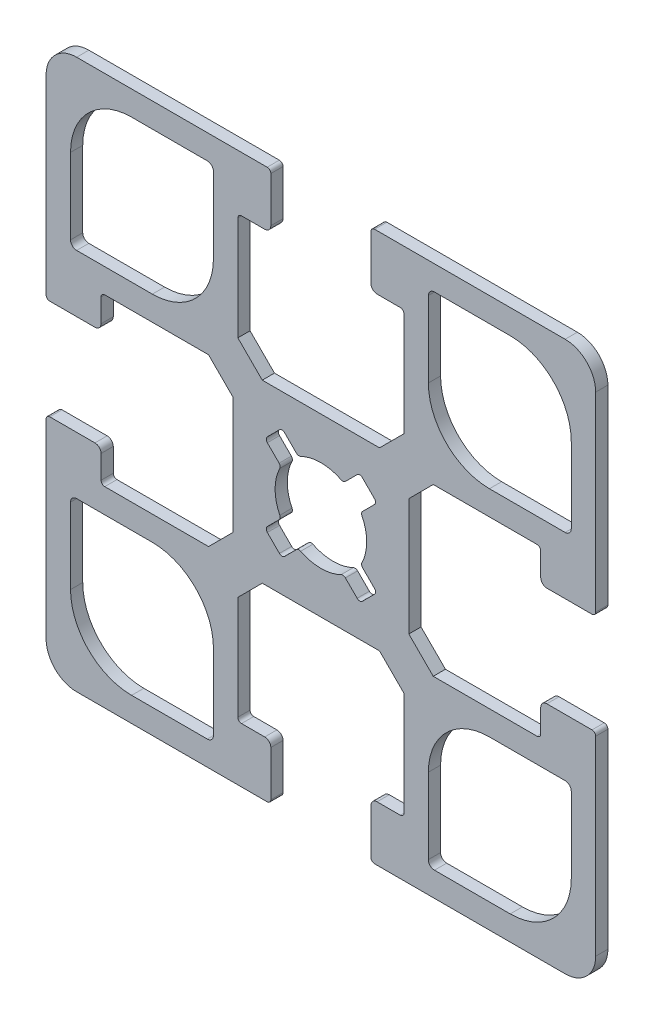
ISO-10303-21;
HEADER;
FILE_DESCRIPTION(('STEP AP214'),'2;1');
FILE_NAME('part.step','',(''),(''),'','','');
FILE_SCHEMA(('AUTOMOTIVE_DESIGN { 1 0 10303 214 1 1 1 1 }'));
ENDSEC;
DATA;
#1=APPLICATION_CONTEXT('core data for automotive mechanical design processes');
#2=APPLICATION_PROTOCOL_DEFINITION('international standard','automotive_design',2000,#1);
#3=PRODUCT_CONTEXT('',#1,'mechanical');
#4=PRODUCT('Part','Part','',(#3));
#5=PRODUCT_RELATED_PRODUCT_CATEGORY('part','',(#4));
#6=PRODUCT_DEFINITION_FORMATION('','',#4);
#7=PRODUCT_DEFINITION_CONTEXT('part definition',#1,'design');
#8=PRODUCT_DEFINITION('design','',#6,#7);
#9=PRODUCT_DEFINITION_SHAPE('','',#8);
#10=(LENGTH_UNIT() NAMED_UNIT(*) SI_UNIT(.MILLI.,.METRE.));
#11=(NAMED_UNIT(*) PLANE_ANGLE_UNIT() SI_UNIT($,.RADIAN.));
#12=(NAMED_UNIT(*) SI_UNIT($,.STERADIAN.) SOLID_ANGLE_UNIT());
#13=UNCERTAINTY_MEASURE_WITH_UNIT(LENGTH_MEASURE(1.E-05),#10,'distance_accuracy_value','');
#14=(GEOMETRIC_REPRESENTATION_CONTEXT(3) GLOBAL_UNCERTAINTY_ASSIGNED_CONTEXT((#13)) GLOBAL_UNIT_ASSIGNED_CONTEXT((#10,
#11,#12)) REPRESENTATION_CONTEXT('',''));
#15=CARTESIAN_POINT('',(0.,0.,0.));
#16=DIRECTION('',(0.,0.,1.));
#17=DIRECTION('',(1.,0.,0.));
#18=AXIS2_PLACEMENT_3D('',#15,#16,#17);
#19=CARTESIAN_POINT('',(-22.2,-4.4,0.5));
#20=DIRECTION('',(0.,0.,1.));
#21=DIRECTION('',(1.,0.,0.));
#22=AXIS2_PLACEMENT_3D('',#19,#20,#21);
#23=PLANE('',#22);
#24=DIRECTION('',(1.,0.,0.));
#25=VECTOR('',#24,1.);
#26=CARTESIAN_POINT('',(9.299995,-20.5,0.5));
#27=LINE('',#26,#25);
#28=CARTESIAN_POINT('',(9.299995,-20.5,0.5));
#29=VERTEX_POINT('',#28);
#30=CARTESIAN_POINT('',(15.5,-20.5,0.5));
#31=VERTEX_POINT('',#30);
#32=EDGE_CURVE('E934',#29,#31,#27,.T.);
#33=ORIENTED_EDGE('',*,*,#32,.F.);
#34=CARTESIAN_POINT('',(9.299995,-20.,0.5));
#35=DIRECTION('',(0.,0.,1.));
#36=DIRECTION('',(1.,0.,0.));
#37=AXIS2_PLACEMENT_3D('',#34,#35,#36);
#38=CIRCLE('',#37,0.5);
#39=CARTESIAN_POINT('',(8.799995,-20.,0.5));
#40=VERTEX_POINT('',#39);
#41=EDGE_CURVE('E932',#40,#29,#38,.T.);
#42=ORIENTED_EDGE('',*,*,#41,.F.);
#43=DIRECTION('',(0.,-1.,0.));
#44=VECTOR('',#43,1.);
#45=CARTESIAN_POINT('',(8.799995,-20.,0.5));
#46=LINE('',#45,#44);
#47=CARTESIAN_POINT('',(8.799995,-13.799995,0.5));
#48=VERTEX_POINT('',#47);
#49=EDGE_CURVE('E948',#48,#40,#46,.T.);
#50=ORIENTED_EDGE('',*,*,#49,.F.);
#51=CARTESIAN_POINT('',(13.799995,-13.799995,0.5));
#52=DIRECTION('',(0.,0.,1.));
#53=DIRECTION('',(1.,0.,0.));
#54=AXIS2_PLACEMENT_3D('',#51,#52,#53);
#55=CIRCLE('',#54,5.);
#56=CARTESIAN_POINT('',(13.799995,-8.799995,0.5));
#57=VERTEX_POINT('',#56);
#58=EDGE_CURVE('E945',#57,#48,#55,.T.);
#59=ORIENTED_EDGE('',*,*,#58,.F.);
#60=DIRECTION('',(-1.,0.,0.));
#61=VECTOR('',#60,1.);
#62=CARTESIAN_POINT('',(13.799995,-8.799995,0.5));
#63=LINE('',#62,#61);
#64=CARTESIAN_POINT('',(20.,-8.799995,0.5));
#65=VERTEX_POINT('',#64);
#66=EDGE_CURVE('E943',#65,#57,#63,.T.);
#67=ORIENTED_EDGE('',*,*,#66,.F.);
#68=CARTESIAN_POINT('',(20.,-9.299995,0.5));
#69=DIRECTION('',(0.,0.,1.));
#70=DIRECTION('',(1.,0.,0.));
#71=AXIS2_PLACEMENT_3D('',#68,#69,#70);
#72=CIRCLE('',#71,0.5);
#73=CARTESIAN_POINT('',(20.5,-9.299995,0.5));
#74=VERTEX_POINT('',#73);
#75=EDGE_CURVE('E941',#74,#65,#72,.T.);
#76=ORIENTED_EDGE('',*,*,#75,.F.);
#77=DIRECTION('',(0.,1.,0.));
#78=VECTOR('',#77,1.);
#79=CARTESIAN_POINT('',(20.5,-15.5,0.5));
#80=LINE('',#79,#78);
#81=CARTESIAN_POINT('',(20.5,-15.5,0.5));
#82=VERTEX_POINT('',#81);
#83=EDGE_CURVE('E939',#82,#74,#80,.T.);
#84=ORIENTED_EDGE('',*,*,#83,.F.);
#85=CARTESIAN_POINT('',(15.5,-15.5,0.5));
#86=DIRECTION('',(0.,0.,1.));
#87=DIRECTION('',(1.,0.,0.));
#88=AXIS2_PLACEMENT_3D('',#85,#86,#87);
#89=CIRCLE('',#88,5.);
#90=EDGE_CURVE('E937',#31,#82,#89,.T.);
#91=ORIENTED_EDGE('',*,*,#90,.F.);
#92=EDGE_LOOP('',(#33,#42,#50,#59,#67,#76,#84,#91));
#93=FACE_BOUND('',#92,.T.);
#94=DIRECTION('',(1.,0.,0.));
#95=VECTOR('',#94,1.);
#96=CARTESIAN_POINT('',(-20.,8.799995,0.5));
#97=LINE('',#96,#95);
#98=CARTESIAN_POINT('',(-20.,8.799995,0.5));
#99=VERTEX_POINT('',#98);
#100=CARTESIAN_POINT('',(-13.799995,8.799995,0.5));
#101=VERTEX_POINT('',#100);
#102=EDGE_CURVE('E1220',#99,#101,#97,.T.);
#103=ORIENTED_EDGE('',*,*,#102,.F.);
#104=CARTESIAN_POINT('',(-20.,9.299995,0.5));
#105=DIRECTION('',(0.,0.,1.));
#106=DIRECTION('',(1.,0.,0.));
#107=AXIS2_PLACEMENT_3D('',#104,#105,#106);
#108=CIRCLE('',#107,0.5);
#109=CARTESIAN_POINT('',(-20.5,9.299995,0.5));
#110=VERTEX_POINT('',#109);
#111=EDGE_CURVE('E1218',#110,#99,#108,.T.);
#112=ORIENTED_EDGE('',*,*,#111,.F.);
#113=DIRECTION('',(0.,-1.,0.));
#114=VECTOR('',#113,1.);
#115=CARTESIAN_POINT('',(-20.5,9.299995,0.5));
#116=LINE('',#115,#114);
#117=CARTESIAN_POINT('',(-20.5,15.5,0.5));
#118=VERTEX_POINT('',#117);
#119=EDGE_CURVE('E1234',#118,#110,#116,.T.);
#120=ORIENTED_EDGE('',*,*,#119,.F.);
#121=CARTESIAN_POINT('',(-15.5,15.5,0.5));
#122=DIRECTION('',(0.,0.,1.));
#123=DIRECTION('',(1.,0.,0.));
#124=AXIS2_PLACEMENT_3D('',#121,#122,#123);
#125=CIRCLE('',#124,5.);
#126=CARTESIAN_POINT('',(-15.5,20.5,0.5));
#127=VERTEX_POINT('',#126);
#128=EDGE_CURVE('E1231',#127,#118,#125,.T.);
#129=ORIENTED_EDGE('',*,*,#128,.F.);
#130=DIRECTION('',(-1.,0.,0.));
#131=VECTOR('',#130,1.);
#132=CARTESIAN_POINT('',(-15.5,20.5,0.5));
#133=LINE('',#132,#131);
#134=CARTESIAN_POINT('',(-9.299995,20.5,0.5));
#135=VERTEX_POINT('',#134);
#136=EDGE_CURVE('E1229',#135,#127,#133,.T.);
#137=ORIENTED_EDGE('',*,*,#136,.F.);
#138=CARTESIAN_POINT('',(-9.299995,20.,0.5));
#139=DIRECTION('',(0.,0.,1.));
#140=DIRECTION('',(1.,0.,0.));
#141=AXIS2_PLACEMENT_3D('',#138,#139,#140);
#142=CIRCLE('',#141,0.5);
#143=CARTESIAN_POINT('',(-8.799995,20.,0.5));
#144=VERTEX_POINT('',#143);
#145=EDGE_CURVE('E1227',#144,#135,#142,.T.);
#146=ORIENTED_EDGE('',*,*,#145,.F.);
#147=DIRECTION('',(0.,1.,0.));
#148=VECTOR('',#147,1.);
#149=CARTESIAN_POINT('',(-8.799995,13.799995,0.5));
#150=LINE('',#149,#148);
#151=CARTESIAN_POINT('',(-8.799995,13.799995,0.5));
#152=VERTEX_POINT('',#151);
#153=EDGE_CURVE('E1225',#152,#144,#150,.T.);
#154=ORIENTED_EDGE('',*,*,#153,.F.);
#155=CARTESIAN_POINT('',(-13.799995,13.799995,0.5));
#156=DIRECTION('',(0.,0.,1.));
#157=DIRECTION('',(1.,0.,0.));
#158=AXIS2_PLACEMENT_3D('',#155,#156,#157);
#159=CIRCLE('',#158,5.);
#160=EDGE_CURVE('E1223',#101,#152,#159,.T.);
#161=ORIENTED_EDGE('',*,*,#160,.F.);
#162=EDGE_LOOP('',(#103,#112,#120,#129,#137,#146,#154,#161));
#163=FACE_BOUND('',#162,.T.);
#164=CARTESIAN_POINT('',(-22.2,-4.4,0.5));
#165=DIRECTION('',(0.,0.,1.));
#166=DIRECTION('',(1.,0.,0.));
#167=AXIS2_PLACEMENT_3D('',#164,#165,#166);
#168=CIRCLE('',#167,0.3);
#169=CARTESIAN_POINT('',(-22.2,-4.1,0.5));
#170=VERTEX_POINT('',#169);
#171=CARTESIAN_POINT('',(-22.5,-4.4,0.5));
#172=VERTEX_POINT('',#171);
#173=EDGE_CURVE('E1336',#170,#172,#168,.T.);
#174=ORIENTED_EDGE('',*,*,#173,.T.);
#175=DIRECTION('',(0.,-1.,0.));
#176=VECTOR('',#175,1.);
#177=CARTESIAN_POINT('',(-22.5,-20.,0.5));
#178=LINE('',#177,#176);
#179=CARTESIAN_POINT('',(-22.5,-20.,0.5));
#180=VERTEX_POINT('',#179);
#181=EDGE_CURVE('E1339',#172,#180,#178,.T.);
#182=ORIENTED_EDGE('',*,*,#181,.T.);
#183=CARTESIAN_POINT('',(-20.,-20.,0.5));
#184=DIRECTION('',(0.,0.,1.));
#185=DIRECTION('',(1.,0.,0.));
#186=AXIS2_PLACEMENT_3D('',#183,#184,#185);
#187=CIRCLE('',#186,2.5);
#188=CARTESIAN_POINT('',(-20.,-22.5,0.5));
#189=VERTEX_POINT('',#188);
#190=EDGE_CURVE('E1342',#180,#189,#187,.T.);
#191=ORIENTED_EDGE('',*,*,#190,.T.);
#192=DIRECTION('',(1.,0.,0.));
#193=VECTOR('',#192,1.);
#194=CARTESIAN_POINT('',(-20.,-22.5,0.5));
#195=LINE('',#194,#193);
#196=CARTESIAN_POINT('',(-4.4,-22.5,0.5));
#197=VERTEX_POINT('',#196);
#198=EDGE_CURVE('E1344',#189,#197,#195,.T.);
#199=ORIENTED_EDGE('',*,*,#198,.T.);
#200=CARTESIAN_POINT('',(-4.4,-22.2,0.5));
#201=DIRECTION('',(0.,0.,1.));
#202=DIRECTION('',(1.,0.,0.));
#203=AXIS2_PLACEMENT_3D('',#200,#201,#202);
#204=CIRCLE('',#203,0.299999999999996);
#205=CARTESIAN_POINT('',(-4.1,-22.2,0.5));
#206=VERTEX_POINT('',#205);
#207=EDGE_CURVE('E1346',#197,#206,#204,.T.);
#208=ORIENTED_EDGE('',*,*,#207,.T.);
#209=DIRECTION('',(0.,1.,0.));
#210=VECTOR('',#209,1.);
#211=CARTESIAN_POINT('',(-4.1,-22.2,0.5));
#212=LINE('',#211,#210);
#213=CARTESIAN_POINT('',(-4.1,-18.5,0.5));
#214=VERTEX_POINT('',#213);
#215=EDGE_CURVE('E1348',#206,#214,#212,.T.);
#216=ORIENTED_EDGE('',*,*,#215,.T.);
#217=CARTESIAN_POINT('',(-4.6,-18.5,0.5));
#218=DIRECTION('',(0.,0.,1.));
#219=DIRECTION('',(1.,0.,0.));
#220=AXIS2_PLACEMENT_3D('',#217,#218,#219);
#221=CIRCLE('',#220,0.500000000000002);
#222=CARTESIAN_POINT('',(-4.6,-18.,0.5));
#223=VERTEX_POINT('',#222);
#224=EDGE_CURVE('E1350',#214,#223,#221,.T.);
#225=ORIENTED_EDGE('',*,*,#224,.T.);
#226=DIRECTION('',(-1.,0.,0.));
#227=VECTOR('',#226,1.);
#228=CARTESIAN_POINT('',(-6.5,-18.,0.5));
#229=LINE('',#228,#227);
#230=CARTESIAN_POINT('',(-6.5,-18.,0.5));
#231=VERTEX_POINT('',#230);
#232=EDGE_CURVE('E1352',#223,#231,#229,.T.);
#233=ORIENTED_EDGE('',*,*,#232,.T.);
#234=CARTESIAN_POINT('',(-6.5,-17.7,0.5));
#235=DIRECTION('',(0.,0.,-1.));
#236=DIRECTION('',(1.,0.,0.));
#237=AXIS2_PLACEMENT_3D('',#234,#235,#236);
#238=CIRCLE('',#237,0.300000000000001);
#239=CARTESIAN_POINT('',(-6.8,-17.7,0.5));
#240=VERTEX_POINT('',#239);
#241=EDGE_CURVE('E1354',#231,#240,#238,.T.);
#242=ORIENTED_EDGE('',*,*,#241,.T.);
#243=DIRECTION('',(0.,1.,0.));
#244=VECTOR('',#243,1.);
#245=CARTESIAN_POINT('',(-6.8,-17.7,0.5));
#246=LINE('',#245,#244);
#247=CARTESIAN_POINT('',(-6.8,-9.2,0.5));
#248=VERTEX_POINT('',#247);
#249=EDGE_CURVE('E1356',#240,#248,#246,.T.);
#250=ORIENTED_EDGE('',*,*,#249,.T.);
#251=DIRECTION('',(0.707106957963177,0.707106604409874,0.));
#252=VECTOR('',#251,1.);
#253=CARTESIAN_POINT('',(-6.8,-9.2,0.5));
#254=LINE('',#253,#252);
#255=CARTESIAN_POINT('',(-4.799999,-7.2,0.5));
#256=VERTEX_POINT('',#255);
#257=EDGE_CURVE('E1358',#248,#256,#254,.T.);
#258=ORIENTED_EDGE('',*,*,#257,.T.);
#259=DIRECTION('',(1.,0.,0.));
#260=VECTOR('',#259,1.);
#261=CARTESIAN_POINT('',(-4.799999,-7.2,0.5));
#262=LINE('',#261,#260);
#263=CARTESIAN_POINT('',(4.799999,-7.2,0.5));
#264=VERTEX_POINT('',#263);
#265=EDGE_CURVE('E1360',#256,#264,#262,.T.);
#266=ORIENTED_EDGE('',*,*,#265,.T.);
#267=DIRECTION('',(0.707106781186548,-0.707106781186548,0.));
#268=VECTOR('',#267,1.);
#269=CARTESIAN_POINT('',(6.799999,-9.2,0.5));
#270=LINE('',#269,#268);
#271=CARTESIAN_POINT('',(6.799999,-9.2,0.5));
#272=VERTEX_POINT('',#271);
#273=EDGE_CURVE('E1362',#264,#272,#270,.T.);
#274=ORIENTED_EDGE('',*,*,#273,.T.);
#275=DIRECTION('',(0.,-1.,0.));
#276=VECTOR('',#275,1.);
#277=CARTESIAN_POINT('',(6.799999,-17.7,0.5));
#278=LINE('',#277,#276);
#279=CARTESIAN_POINT('',(6.799999,-17.7,0.5));
#280=VERTEX_POINT('',#279);
#281=EDGE_CURVE('E1364',#272,#280,#278,.T.);
#282=ORIENTED_EDGE('',*,*,#281,.T.);
#283=CARTESIAN_POINT('',(6.499999,-17.7000000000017,0.5));
#284=DIRECTION('',(0.,0.,-1.));
#285=DIRECTION('',(1.,0.,0.));
#286=AXIS2_PLACEMENT_3D('',#283,#284,#285);
#287=CIRCLE('',#286,0.300000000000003);
#288=CARTESIAN_POINT('',(6.5,-18.,0.5));
#289=VERTEX_POINT('',#288);
#290=EDGE_CURVE('E1366',#280,#289,#287,.T.);
#291=ORIENTED_EDGE('',*,*,#290,.T.);
#292=DIRECTION('',(-1.,0.,0.));
#293=VECTOR('',#292,1.);
#294=CARTESIAN_POINT('',(4.6,-18.,0.5));
#295=LINE('',#294,#293);
#296=CARTESIAN_POINT('',(4.6,-18.,0.5));
#297=VERTEX_POINT('',#296);
#298=EDGE_CURVE('E1368',#289,#297,#295,.T.);
#299=ORIENTED_EDGE('',*,*,#298,.T.);
#300=CARTESIAN_POINT('',(4.6,-18.5,0.5));
#301=DIRECTION('',(0.,0.,1.));
#302=DIRECTION('',(1.,0.,0.));
#303=AXIS2_PLACEMENT_3D('',#300,#301,#302);
#304=CIRCLE('',#303,0.5);
#305=CARTESIAN_POINT('',(4.1,-18.5,0.5));
#306=VERTEX_POINT('',#305);
#307=EDGE_CURVE('E1370',#297,#306,#304,.T.);
#308=ORIENTED_EDGE('',*,*,#307,.T.);
#309=DIRECTION('',(0.,-1.,0.));
#310=VECTOR('',#309,1.);
#311=CARTESIAN_POINT('',(4.1,-22.2,0.5));
#312=LINE('',#311,#310);
#313=CARTESIAN_POINT('',(4.1,-22.2,0.5));
#314=VERTEX_POINT('',#313);
#315=EDGE_CURVE('E1372',#306,#314,#312,.T.);
#316=ORIENTED_EDGE('',*,*,#315,.T.);
#317=CARTESIAN_POINT('',(4.4,-22.2,0.5));
#318=DIRECTION('',(0.,0.,1.));
#319=DIRECTION('',(1.,0.,0.));
#320=AXIS2_PLACEMENT_3D('',#317,#318,#319);
#321=CIRCLE('',#320,0.3);
#322=CARTESIAN_POINT('',(4.4,-22.5,0.5));
#323=VERTEX_POINT('',#322);
#324=EDGE_CURVE('E1374',#314,#323,#321,.T.);
#325=ORIENTED_EDGE('',*,*,#324,.T.);
#326=DIRECTION('',(1.,0.,0.));
#327=VECTOR('',#326,1.);
#328=CARTESIAN_POINT('',(4.4,-22.5,0.5));
#329=LINE('',#328,#327);
#330=CARTESIAN_POINT('',(20.,-22.5,0.5));
#331=VERTEX_POINT('',#330);
#332=EDGE_CURVE('E1376',#323,#331,#329,.T.);
#333=ORIENTED_EDGE('',*,*,#332,.T.);
#334=CARTESIAN_POINT('',(20.,-20.,0.5));
#335=DIRECTION('',(0.,0.,1.));
#336=DIRECTION('',(1.,0.,0.));
#337=AXIS2_PLACEMENT_3D('',#334,#335,#336);
#338=CIRCLE('',#337,2.5);
#339=CARTESIAN_POINT('',(22.5,-20.,0.5));
#340=VERTEX_POINT('',#339);
#341=EDGE_CURVE('E1378',#331,#340,#338,.T.);
#342=ORIENTED_EDGE('',*,*,#341,.T.);
#343=DIRECTION('',(0.,1.,0.));
#344=VECTOR('',#343,1.);
#345=CARTESIAN_POINT('',(22.5,-20.,0.5));
#346=LINE('',#345,#344);
#347=CARTESIAN_POINT('',(22.5,-4.4,0.5));
#348=VERTEX_POINT('',#347);
#349=EDGE_CURVE('E1380',#340,#348,#346,.T.);
#350=ORIENTED_EDGE('',*,*,#349,.T.);
#351=CARTESIAN_POINT('',(22.2,-4.39999999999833,0.5));
#352=DIRECTION('',(0.,0.,1.));
#353=DIRECTION('',(1.,0.,0.));
#354=AXIS2_PLACEMENT_3D('',#351,#352,#353);
#355=CIRCLE('',#354,0.299999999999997);
#356=CARTESIAN_POINT('',(22.200001,-4.1,0.5));
#357=VERTEX_POINT('',#356);
#358=EDGE_CURVE('E1382',#348,#357,#355,.T.);
#359=ORIENTED_EDGE('',*,*,#358,.T.);
#360=DIRECTION('',(-1.,0.,0.));
#361=VECTOR('',#360,1.);
#362=CARTESIAN_POINT('',(18.5,-4.1,0.5));
#363=LINE('',#362,#361);
#364=CARTESIAN_POINT('',(18.5,-4.1,0.5));
#365=VERTEX_POINT('',#364);
#366=EDGE_CURVE('E1384',#357,#365,#363,.T.);
#367=ORIENTED_EDGE('',*,*,#366,.T.);
#368=CARTESIAN_POINT('',(18.5,-4.6,0.5));
#369=DIRECTION('',(0.,0.,1.));
#370=DIRECTION('',(1.,0.,0.));
#371=AXIS2_PLACEMENT_3D('',#368,#369,#370);
#372=CIRCLE('',#371,0.500000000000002);
#373=CARTESIAN_POINT('',(18.,-4.6,0.5));
#374=VERTEX_POINT('',#373);
#375=EDGE_CURVE('E1386',#365,#374,#372,.T.);
#376=ORIENTED_EDGE('',*,*,#375,.T.);
#377=DIRECTION('',(0.,-1.,0.));
#378=VECTOR('',#377,1.);
#379=CARTESIAN_POINT('',(18.,-6.5,0.5));
#380=LINE('',#379,#378);
#381=CARTESIAN_POINT('',(18.,-6.5,0.5));
#382=VERTEX_POINT('',#381);
#383=EDGE_CURVE('E1388',#374,#382,#380,.T.);
#384=ORIENTED_EDGE('',*,*,#383,.T.);
#385=CARTESIAN_POINT('',(17.7,-6.50000000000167,0.5));
#386=DIRECTION('',(0.,0.,-1.));
#387=DIRECTION('',(1.,0.,0.));
#388=AXIS2_PLACEMENT_3D('',#385,#386,#387);
#389=CIRCLE('',#388,0.299999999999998);
#390=CARTESIAN_POINT('',(17.700001,-6.8,0.5));
#391=VERTEX_POINT('',#390);
#392=EDGE_CURVE('E1390',#382,#391,#389,.T.);
#393=ORIENTED_EDGE('',*,*,#392,.T.);
#394=DIRECTION('',(-1.,0.,0.));
#395=VECTOR('',#394,1.);
#396=CARTESIAN_POINT('',(9.200001,-6.8,0.5));
#397=LINE('',#396,#395);
#398=CARTESIAN_POINT('',(9.200001,-6.8,0.5));
#399=VERTEX_POINT('',#398);
#400=EDGE_CURVE('E1392',#391,#399,#397,.T.);
#401=ORIENTED_EDGE('',*,*,#400,.T.);
#402=DIRECTION('',(-0.707106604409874,0.707106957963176,0.));
#403=VECTOR('',#402,1.);
#404=CARTESIAN_POINT('',(9.200001,-6.8,0.5));
#405=LINE('',#404,#403);
#406=CARTESIAN_POINT('',(7.200001,-4.799999,0.5));
#407=VERTEX_POINT('',#406);
#408=EDGE_CURVE('E1394',#399,#407,#405,.T.);
#409=ORIENTED_EDGE('',*,*,#408,.T.);
#410=DIRECTION('',(0.,1.,0.));
#411=VECTOR('',#410,1.);
#412=CARTESIAN_POINT('',(7.200001,-4.799999,0.5));
#413=LINE('',#412,#411);
#414=CARTESIAN_POINT('',(7.200001,4.799999,0.5));
#415=VERTEX_POINT('',#414);
#416=EDGE_CURVE('E1396',#407,#415,#413,.T.);
#417=ORIENTED_EDGE('',*,*,#416,.T.);
#418=DIRECTION('',(0.707106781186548,0.707106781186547,0.));
#419=VECTOR('',#418,1.);
#420=CARTESIAN_POINT('',(7.200001,4.799999,0.5));
#421=LINE('',#420,#419);
#422=CARTESIAN_POINT('',(9.200001,6.799999,0.5));
#423=VERTEX_POINT('',#422);
#424=EDGE_CURVE('E1398',#415,#423,#421,.T.);
#425=ORIENTED_EDGE('',*,*,#424,.T.);
#426=DIRECTION('',(1.,0.,0.));
#427=VECTOR('',#426,1.);
#428=CARTESIAN_POINT('',(9.200001,6.799999,0.5));
#429=LINE('',#428,#427);
#430=CARTESIAN_POINT('',(17.700001,6.799999,0.5));
#431=VERTEX_POINT('',#430);
#432=EDGE_CURVE('E1400',#423,#431,#429,.T.);
#433=ORIENTED_EDGE('',*,*,#432,.T.);
#434=CARTESIAN_POINT('',(17.7000000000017,6.49999900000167,0.5));
#435=DIRECTION('',(0.,0.,-1.));
#436=DIRECTION('',(1.,0.,0.));
#437=AXIS2_PLACEMENT_3D('',#434,#435,#436);
#438=CIRCLE('',#437,0.299999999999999);
#439=CARTESIAN_POINT('',(18.,6.5,0.5));
#440=VERTEX_POINT('',#439);
#441=EDGE_CURVE('E1402',#431,#440,#438,.T.);
#442=ORIENTED_EDGE('',*,*,#441,.T.);
#443=DIRECTION('',(0.,-1.,0.));
#444=VECTOR('',#443,1.);
#445=CARTESIAN_POINT('',(18.,4.6,0.5));
#446=LINE('',#445,#444);
#447=CARTESIAN_POINT('',(18.,4.6,0.5));
#448=VERTEX_POINT('',#447);
#449=EDGE_CURVE('E1404',#440,#448,#446,.T.);
#450=ORIENTED_EDGE('',*,*,#449,.T.);
#451=CARTESIAN_POINT('',(18.5,4.6,0.5));
#452=DIRECTION('',(0.,0.,1.));
#453=DIRECTION('',(1.,0.,0.));
#454=AXIS2_PLACEMENT_3D('',#451,#452,#453);
#455=CIRCLE('',#454,0.499999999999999);
#456=CARTESIAN_POINT('',(18.5,4.1,0.5));
#457=VERTEX_POINT('',#456);
#458=EDGE_CURVE('E1406',#448,#457,#455,.T.);
#459=ORIENTED_EDGE('',*,*,#458,.T.);
#460=DIRECTION('',(1.,0.,0.));
#461=VECTOR('',#460,1.);
#462=CARTESIAN_POINT('',(18.5,4.1,0.5));
#463=LINE('',#462,#461);
#464=CARTESIAN_POINT('',(22.200001,4.1,0.5));
#465=VERTEX_POINT('',#464);
#466=EDGE_CURVE('E1408',#457,#465,#463,.T.);
#467=ORIENTED_EDGE('',*,*,#466,.T.);
#468=CARTESIAN_POINT('',(22.2,4.39999999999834,0.5));
#469=DIRECTION('',(0.,0.,1.));
#470=DIRECTION('',(1.,0.,0.));
#471=AXIS2_PLACEMENT_3D('',#468,#469,#470);
#472=CIRCLE('',#471,0.3);
#473=CARTESIAN_POINT('',(22.5,4.4,0.5));
#474=VERTEX_POINT('',#473);
#475=EDGE_CURVE('E1410',#465,#474,#472,.T.);
#476=ORIENTED_EDGE('',*,*,#475,.T.);
#477=DIRECTION('',(0.,1.,0.));
#478=VECTOR('',#477,1.);
#479=CARTESIAN_POINT('',(22.5,4.4,0.5));
#480=LINE('',#479,#478);
#481=CARTESIAN_POINT('',(22.5,20.,0.5));
#482=VERTEX_POINT('',#481);
#483=EDGE_CURVE('E1412',#474,#482,#480,.T.);
#484=ORIENTED_EDGE('',*,*,#483,.T.);
#485=CARTESIAN_POINT('',(20.,20.,0.5));
#486=DIRECTION('',(0.,0.,1.));
#487=DIRECTION('',(1.,0.,0.));
#488=AXIS2_PLACEMENT_3D('',#485,#486,#487);
#489=CIRCLE('',#488,2.5);
#490=CARTESIAN_POINT('',(20.,22.5,0.5));
#491=VERTEX_POINT('',#490);
#492=EDGE_CURVE('E1414',#482,#491,#489,.T.);
#493=ORIENTED_EDGE('',*,*,#492,.T.);
#494=DIRECTION('',(-1.,0.,0.));
#495=VECTOR('',#494,1.);
#496=CARTESIAN_POINT('',(4.4,22.5,0.5));
#497=LINE('',#496,#495);
#498=CARTESIAN_POINT('',(4.4,22.5,0.5));
#499=VERTEX_POINT('',#498);
#500=EDGE_CURVE('E1416',#491,#499,#497,.T.);
#501=ORIENTED_EDGE('',*,*,#500,.T.);
#502=CARTESIAN_POINT('',(4.39999999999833,22.2,0.5));
#503=DIRECTION('',(0.,0.,1.));
#504=DIRECTION('',(1.,0.,0.));
#505=AXIS2_PLACEMENT_3D('',#502,#503,#504);
#506=CIRCLE('',#505,0.299999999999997);
#507=CARTESIAN_POINT('',(4.1,22.200001,0.5));
#508=VERTEX_POINT('',#507);
#509=EDGE_CURVE('E1418',#499,#508,#506,.T.);
#510=ORIENTED_EDGE('',*,*,#509,.T.);
#511=DIRECTION('',(0.,-1.,0.));
#512=VECTOR('',#511,1.);
#513=CARTESIAN_POINT('',(4.1,18.5,0.5));
#514=LINE('',#513,#512);
#515=CARTESIAN_POINT('',(4.1,18.5,0.5));
#516=VERTEX_POINT('',#515);
#517=EDGE_CURVE('E1420',#508,#516,#514,.T.);
#518=ORIENTED_EDGE('',*,*,#517,.T.);
#519=CARTESIAN_POINT('',(4.6,18.5,0.5));
#520=DIRECTION('',(0.,0.,1.));
#521=DIRECTION('',(1.,0.,0.));
#522=AXIS2_PLACEMENT_3D('',#519,#520,#521);
#523=CIRCLE('',#522,0.500000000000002);
#524=CARTESIAN_POINT('',(4.6,18.,0.5));
#525=VERTEX_POINT('',#524);
#526=EDGE_CURVE('E1422',#516,#525,#523,.T.);
#527=ORIENTED_EDGE('',*,*,#526,.T.);
#528=DIRECTION('',(1.,0.,0.));
#529=VECTOR('',#528,1.);
#530=CARTESIAN_POINT('',(4.6,18.,0.5));
#531=LINE('',#530,#529);
#532=CARTESIAN_POINT('',(6.5,18.,0.5));
#533=VERTEX_POINT('',#532);
#534=EDGE_CURVE('E1424',#525,#533,#531,.T.);
#535=ORIENTED_EDGE('',*,*,#534,.T.);
#536=CARTESIAN_POINT('',(6.49999900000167,17.7000000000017,0.5));
#537=DIRECTION('',(0.,0.,-1.));
#538=DIRECTION('',(1.,0.,0.));
#539=AXIS2_PLACEMENT_3D('',#536,#537,#538);
#540=CIRCLE('',#539,0.3);
#541=CARTESIAN_POINT('',(6.799999,17.700001,0.5));
#542=VERTEX_POINT('',#541);
#543=EDGE_CURVE('E1426',#533,#542,#540,.T.);
#544=ORIENTED_EDGE('',*,*,#543,.T.);
#545=DIRECTION('',(0.,-1.,0.));
#546=VECTOR('',#545,1.);
#547=CARTESIAN_POINT('',(6.799999,9.200001,0.5));
#548=LINE('',#547,#546);
#549=CARTESIAN_POINT('',(6.799999,9.200001,0.5));
#550=VERTEX_POINT('',#549);
#551=EDGE_CURVE('E1428',#542,#550,#548,.T.);
#552=ORIENTED_EDGE('',*,*,#551,.T.);
#553=DIRECTION('',(-0.707106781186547,-0.707106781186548,0.));
#554=VECTOR('',#553,1.);
#555=CARTESIAN_POINT('',(4.799999,7.200001,0.5));
#556=LINE('',#555,#554);
#557=CARTESIAN_POINT('',(4.799999,7.200001,0.5));
#558=VERTEX_POINT('',#557);
#559=EDGE_CURVE('E1430',#550,#558,#556,.T.);
#560=ORIENTED_EDGE('',*,*,#559,.T.);
#561=DIRECTION('',(-1.,0.,0.));
#562=VECTOR('',#561,1.);
#563=CARTESIAN_POINT('',(-4.799999,7.200001,0.5));
#564=LINE('',#563,#562);
#565=CARTESIAN_POINT('',(-4.799999,7.200001,0.5));
#566=VERTEX_POINT('',#565);
#567=EDGE_CURVE('E1432',#558,#566,#564,.T.);
#568=ORIENTED_EDGE('',*,*,#567,.T.);
#569=DIRECTION('',(-0.707106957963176,0.707106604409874,0.));
#570=VECTOR('',#569,1.);
#571=CARTESIAN_POINT('',(-4.799999,7.200001,0.5));
#572=LINE('',#571,#570);
#573=CARTESIAN_POINT('',(-6.8,9.200001,0.5));
#574=VERTEX_POINT('',#573);
#575=EDGE_CURVE('E1434',#566,#574,#572,.T.);
#576=ORIENTED_EDGE('',*,*,#575,.T.);
#577=DIRECTION('',(0.,1.,0.));
#578=VECTOR('',#577,1.);
#579=CARTESIAN_POINT('',(-6.8,9.200001,0.5));
#580=LINE('',#579,#578);
#581=CARTESIAN_POINT('',(-6.8,17.700001,0.5));
#582=VERTEX_POINT('',#581);
#583=EDGE_CURVE('E1436',#574,#582,#580,.T.);
#584=ORIENTED_EDGE('',*,*,#583,.T.);
#585=CARTESIAN_POINT('',(-6.50000000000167,17.7,0.5));
#586=DIRECTION('',(0.,0.,-1.));
#587=DIRECTION('',(1.,0.,0.));
#588=AXIS2_PLACEMENT_3D('',#585,#586,#587);
#589=CIRCLE('',#588,0.299999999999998);
#590=CARTESIAN_POINT('',(-6.5,18.,0.5));
#591=VERTEX_POINT('',#590);
#592=EDGE_CURVE('E1438',#582,#591,#589,.T.);
#593=ORIENTED_EDGE('',*,*,#592,.T.);
#594=DIRECTION('',(1.,0.,0.));
#595=VECTOR('',#594,1.);
#596=CARTESIAN_POINT('',(-6.5,18.,0.5));
#597=LINE('',#596,#595);
#598=CARTESIAN_POINT('',(-4.6,18.,0.5));
#599=VERTEX_POINT('',#598);
#600=EDGE_CURVE('E1440',#591,#599,#597,.T.);
#601=ORIENTED_EDGE('',*,*,#600,.T.);
#602=CARTESIAN_POINT('',(-4.6,18.5,0.5));
#603=DIRECTION('',(0.,0.,1.));
#604=DIRECTION('',(1.,0.,0.));
#605=AXIS2_PLACEMENT_3D('',#602,#603,#604);
#606=CIRCLE('',#605,0.500000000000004);
#607=CARTESIAN_POINT('',(-4.1,18.5,0.5));
#608=VERTEX_POINT('',#607);
#609=EDGE_CURVE('E1442',#599,#608,#606,.T.);
#610=ORIENTED_EDGE('',*,*,#609,.T.);
#611=DIRECTION('',(0.,1.,0.));
#612=VECTOR('',#611,1.);
#613=CARTESIAN_POINT('',(-4.1,18.5,0.5));
#614=LINE('',#613,#612);
#615=CARTESIAN_POINT('',(-4.1,22.200001,0.5));
#616=VERTEX_POINT('',#615);
#617=EDGE_CURVE('E1444',#608,#616,#614,.T.);
#618=ORIENTED_EDGE('',*,*,#617,.T.);
#619=CARTESIAN_POINT('',(-4.39999999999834,22.2,0.5));
#620=DIRECTION('',(0.,0.,1.));
#621=DIRECTION('',(1.,0.,0.));
#622=AXIS2_PLACEMENT_3D('',#619,#620,#621);
#623=CIRCLE('',#622,0.3);
#624=CARTESIAN_POINT('',(-4.4,22.5,0.5));
#625=VERTEX_POINT('',#624);
#626=EDGE_CURVE('E1446',#616,#625,#623,.T.);
#627=ORIENTED_EDGE('',*,*,#626,.T.);
#628=DIRECTION('',(-1.,0.,0.));
#629=VECTOR('',#628,1.);
#630=CARTESIAN_POINT('',(-20.,22.5,0.5));
#631=LINE('',#630,#629);
#632=CARTESIAN_POINT('',(-20.,22.5,0.5));
#633=VERTEX_POINT('',#632);
#634=EDGE_CURVE('E1448',#625,#633,#631,.T.);
#635=ORIENTED_EDGE('',*,*,#634,.T.);
#636=CARTESIAN_POINT('',(-20.,20.,0.5));
#637=DIRECTION('',(0.,0.,1.));
#638=DIRECTION('',(1.,0.,0.));
#639=AXIS2_PLACEMENT_3D('',#636,#637,#638);
#640=CIRCLE('',#639,2.5);
#641=CARTESIAN_POINT('',(-22.5,20.,0.5));
#642=VERTEX_POINT('',#641);
#643=EDGE_CURVE('E1450',#633,#642,#640,.T.);
#644=ORIENTED_EDGE('',*,*,#643,.T.);
#645=DIRECTION('',(0.,-1.,0.));
#646=VECTOR('',#645,1.);
#647=CARTESIAN_POINT('',(-22.5,4.4,0.5));
#648=LINE('',#647,#646);
#649=CARTESIAN_POINT('',(-22.5,4.4,0.5));
#650=VERTEX_POINT('',#649);
#651=EDGE_CURVE('E1452',#642,#650,#648,.T.);
#652=ORIENTED_EDGE('',*,*,#651,.T.);
#653=CARTESIAN_POINT('',(-22.2,4.4,0.5));
#654=DIRECTION('',(0.,0.,1.));
#655=DIRECTION('',(1.,0.,0.));
#656=AXIS2_PLACEMENT_3D('',#653,#654,#655);
#657=CIRCLE('',#656,0.3);
#658=CARTESIAN_POINT('',(-22.2,4.1,0.5));
#659=VERTEX_POINT('',#658);
#660=EDGE_CURVE('E1454',#650,#659,#657,.T.);
#661=ORIENTED_EDGE('',*,*,#660,.T.);
#662=DIRECTION('',(1.,0.,0.));
#663=VECTOR('',#662,1.);
#664=CARTESIAN_POINT('',(-22.2,4.1,0.5));
#665=LINE('',#664,#663);
#666=CARTESIAN_POINT('',(-18.5,4.1,0.5));
#667=VERTEX_POINT('',#666);
#668=EDGE_CURVE('E1456',#659,#667,#665,.T.);
#669=ORIENTED_EDGE('',*,*,#668,.T.);
#670=CARTESIAN_POINT('',(-18.5,4.6,0.5));
#671=DIRECTION('',(0.,0.,1.));
#672=DIRECTION('',(1.,0.,0.));
#673=AXIS2_PLACEMENT_3D('',#670,#671,#672);
#674=CIRCLE('',#673,0.499999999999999);
#675=CARTESIAN_POINT('',(-18.,4.6,0.5));
#676=VERTEX_POINT('',#675);
#677=EDGE_CURVE('E1458',#667,#676,#674,.T.);
#678=ORIENTED_EDGE('',*,*,#677,.T.);
#679=DIRECTION('',(0.,1.,0.));
#680=VECTOR('',#679,1.);
#681=CARTESIAN_POINT('',(-18.,4.6,0.5));
#682=LINE('',#681,#680);
#683=CARTESIAN_POINT('',(-18.,6.5,0.5));
#684=VERTEX_POINT('',#683);
#685=EDGE_CURVE('E1460',#676,#684,#682,.T.);
#686=ORIENTED_EDGE('',*,*,#685,.T.);
#687=CARTESIAN_POINT('',(-17.7000000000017,6.499999,0.5));
#688=DIRECTION('',(0.,0.,-1.));
#689=DIRECTION('',(1.,0.,0.));
#690=AXIS2_PLACEMENT_3D('',#687,#688,#689);
#691=CIRCLE('',#690,0.3);
#692=CARTESIAN_POINT('',(-17.7,6.799999,0.5));
#693=VERTEX_POINT('',#692);
#694=EDGE_CURVE('E1462',#684,#693,#691,.T.);
#695=ORIENTED_EDGE('',*,*,#694,.T.);
#696=DIRECTION('',(1.,0.,0.));
#697=VECTOR('',#696,1.);
#698=CARTESIAN_POINT('',(-17.7,6.799999,0.5));
#699=LINE('',#698,#697);
#700=CARTESIAN_POINT('',(-9.2,6.799999,0.5));
#701=VERTEX_POINT('',#700);
#702=EDGE_CURVE('E1464',#693,#701,#699,.T.);
#703=ORIENTED_EDGE('',*,*,#702,.T.);
#704=DIRECTION('',(0.707106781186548,-0.707106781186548,0.));
#705=VECTOR('',#704,1.);
#706=CARTESIAN_POINT('',(-7.2,4.799999,0.5));
#707=LINE('',#706,#705);
#708=CARTESIAN_POINT('',(-7.2,4.799999,0.5));
#709=VERTEX_POINT('',#708);
#710=EDGE_CURVE('E1466',#701,#709,#707,.T.);
#711=ORIENTED_EDGE('',*,*,#710,.T.);
#712=DIRECTION('',(0.,-1.,0.));
#713=VECTOR('',#712,1.);
#714=CARTESIAN_POINT('',(-7.2,-4.799999,0.5));
#715=LINE('',#714,#713);
#716=CARTESIAN_POINT('',(-7.2,-4.799999,0.5));
#717=VERTEX_POINT('',#716);
#718=EDGE_CURVE('E1468',#709,#717,#715,.T.);
#719=ORIENTED_EDGE('',*,*,#718,.T.);
#720=DIRECTION('',(-0.707106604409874,-0.707106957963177,0.));
#721=VECTOR('',#720,1.);
#722=CARTESIAN_POINT('',(-9.2,-6.8,0.5));
#723=LINE('',#722,#721);
#724=CARTESIAN_POINT('',(-9.2,-6.8,0.5));
#725=VERTEX_POINT('',#724);
#726=EDGE_CURVE('E1470',#717,#725,#723,.T.);
#727=ORIENTED_EDGE('',*,*,#726,.T.);
#728=DIRECTION('',(-1.,0.,0.));
#729=VECTOR('',#728,1.);
#730=CARTESIAN_POINT('',(-17.7,-6.8,0.5));
#731=LINE('',#730,#729);
#732=CARTESIAN_POINT('',(-17.7,-6.8,0.5));
#733=VERTEX_POINT('',#732);
#734=EDGE_CURVE('E1472',#725,#733,#731,.T.);
#735=ORIENTED_EDGE('',*,*,#734,.T.);
#736=CARTESIAN_POINT('',(-17.7,-6.5,0.5));
#737=DIRECTION('',(0.,0.,-1.));
#738=DIRECTION('',(1.,0.,0.));
#739=AXIS2_PLACEMENT_3D('',#736,#737,#738);
#740=CIRCLE('',#739,0.300000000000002);
#741=CARTESIAN_POINT('',(-18.,-6.5,0.5));
#742=VERTEX_POINT('',#741);
#743=EDGE_CURVE('E1474',#733,#742,#740,.T.);
#744=ORIENTED_EDGE('',*,*,#743,.T.);
#745=DIRECTION('',(0.,1.,0.));
#746=VECTOR('',#745,1.);
#747=CARTESIAN_POINT('',(-18.,-6.5,0.5));
#748=LINE('',#747,#746);
#749=CARTESIAN_POINT('',(-18.,-4.6,0.5));
#750=VERTEX_POINT('',#749);
#751=EDGE_CURVE('E1476',#742,#750,#748,.T.);
#752=ORIENTED_EDGE('',*,*,#751,.T.);
#753=CARTESIAN_POINT('',(-18.5,-4.6,0.5));
#754=DIRECTION('',(0.,0.,1.));
#755=DIRECTION('',(1.,0.,0.));
#756=AXIS2_PLACEMENT_3D('',#753,#754,#755);
#757=CIRCLE('',#756,0.499999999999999);
#758=CARTESIAN_POINT('',(-18.5,-4.1,0.5));
#759=VERTEX_POINT('',#758);
#760=EDGE_CURVE('E1478',#750,#759,#757,.T.);
#761=ORIENTED_EDGE('',*,*,#760,.T.);
#762=DIRECTION('',(-1.,0.,0.));
#763=VECTOR('',#762,1.);
#764=CARTESIAN_POINT('',(-22.2,-4.1,0.5));
#765=LINE('',#764,#763);
#766=EDGE_CURVE('E1480',#759,#170,#765,.T.);
#767=ORIENTED_EDGE('',*,*,#766,.T.);
#768=EDGE_LOOP('',(#174,#182,#191,#199,#208,#216,#225,#233,#242,#250,#258,#266,#274,#282,#291,
#299,#308,#316,#325,#333,#342,#350,#359,#367,#376,#384,#393,#401,#409,#417,#425,#433,#442,#450,
#459,#467,#476,#484,#493,#501,#510,#518,#527,#535,#544,#552,#560,#568,#576,#584,#593,#601,#610,
#618,#627,#635,#644,#652,#661,#669,#678,#686,#695,#703,#711,#719,#727,#735,#744,#752,#761,#767));
#769=FACE_BOUND('',#768,.T.);
#770=DIRECTION('',(0.,-1.,0.));
#771=VECTOR('',#770,1.);
#772=CARTESIAN_POINT('',(-20.5,-15.5,0.5));
#773=LINE('',#772,#771);
#774=CARTESIAN_POINT('',(-20.5,-9.299995,0.5));
#775=VERTEX_POINT('',#774);
#776=CARTESIAN_POINT('',(-20.5,-15.5,0.5));
#777=VERTEX_POINT('',#776);
#778=EDGE_CURVE('E1279',#775,#777,#773,.T.);
#779=ORIENTED_EDGE('',*,*,#778,.F.);
#780=CARTESIAN_POINT('',(-20.,-9.299995,0.5));
#781=DIRECTION('',(0.,0.,1.));
#782=DIRECTION('',(1.,0.,0.));
#783=AXIS2_PLACEMENT_3D('',#780,#781,#782);
#784=CIRCLE('',#783,0.5);
#785=CARTESIAN_POINT('',(-20.,-8.799995,0.5));
#786=VERTEX_POINT('',#785);
#787=EDGE_CURVE('E1277',#786,#775,#784,.T.);
#788=ORIENTED_EDGE('',*,*,#787,.F.);
#789=DIRECTION('',(-1.,0.,0.));
#790=VECTOR('',#789,1.);
#791=CARTESIAN_POINT('',(-20.,-8.799995,0.5));
#792=LINE('',#791,#790);
#793=CARTESIAN_POINT('',(-13.799995,-8.799995,0.5));
#794=VERTEX_POINT('',#793);
#795=EDGE_CURVE('E1293',#794,#786,#792,.T.);
#796=ORIENTED_EDGE('',*,*,#795,.F.);
#797=CARTESIAN_POINT('',(-13.799995,-13.799995,0.5));
#798=DIRECTION('',(0.,0.,1.));
#799=DIRECTION('',(1.,0.,0.));
#800=AXIS2_PLACEMENT_3D('',#797,#798,#799);
#801=CIRCLE('',#800,5.);
#802=CARTESIAN_POINT('',(-8.799995,-13.799995,0.5));
#803=VERTEX_POINT('',#802);
#804=EDGE_CURVE('E1290',#803,#794,#801,.T.);
#805=ORIENTED_EDGE('',*,*,#804,.F.);
#806=DIRECTION('',(0.,1.,0.));
#807=VECTOR('',#806,1.);
#808=CARTESIAN_POINT('',(-8.799995,-20.,0.5));
#809=LINE('',#808,#807);
#810=CARTESIAN_POINT('',(-8.799995,-20.,0.5));
#811=VERTEX_POINT('',#810);
#812=EDGE_CURVE('E1288',#811,#803,#809,.T.);
#813=ORIENTED_EDGE('',*,*,#812,.F.);
#814=CARTESIAN_POINT('',(-9.299995,-20.,0.5));
#815=DIRECTION('',(0.,0.,1.));
#816=DIRECTION('',(1.,0.,0.));
#817=AXIS2_PLACEMENT_3D('',#814,#815,#816);
#818=CIRCLE('',#817,0.5);
#819=CARTESIAN_POINT('',(-9.299995,-20.5,0.5));
#820=VERTEX_POINT('',#819);
#821=EDGE_CURVE('E1286',#820,#811,#818,.T.);
#822=ORIENTED_EDGE('',*,*,#821,.F.);
#823=DIRECTION('',(1.,0.,0.));
#824=VECTOR('',#823,1.);
#825=CARTESIAN_POINT('',(-15.5,-20.5,0.5));
#826=LINE('',#825,#824);
#827=CARTESIAN_POINT('',(-15.5,-20.5,0.5));
#828=VERTEX_POINT('',#827);
#829=EDGE_CURVE('E1284',#828,#820,#826,.T.);
#830=ORIENTED_EDGE('',*,*,#829,.F.);
#831=CARTESIAN_POINT('',(-15.5,-15.5,0.5));
#832=DIRECTION('',(0.,0.,1.));
#833=DIRECTION('',(1.,0.,0.));
#834=AXIS2_PLACEMENT_3D('',#831,#832,#833);
#835=CIRCLE('',#834,5.);
#836=EDGE_CURVE('E1282',#777,#828,#835,.T.);
#837=ORIENTED_EDGE('',*,*,#836,.F.);
#838=EDGE_LOOP('',(#779,#788,#796,#805,#813,#822,#830,#837));
#839=FACE_BOUND('',#838,.T.);
#840=DIRECTION('',(0.707106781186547,-0.707106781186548,0.));
#841=VECTOR('',#840,1.);
#842=CARTESIAN_POINT('',(-3.3941125,-4.38406150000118,0.5));
#843=LINE('',#842,#841);
#844=CARTESIAN_POINT('',(-4.38406150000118,-3.3941125,0.5));
#845=VERTEX_POINT('',#844);
#846=CARTESIAN_POINT('',(-3.3941125,-4.38406150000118,0.5));
#847=VERTEX_POINT('',#846);
#848=EDGE_CURVE('E993',#845,#847,#843,.T.);
#849=ORIENTED_EDGE('',*,*,#848,.F.);
#850=CARTESIAN_POINT('',(-4.17192950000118,-3.1819805,0.5));
#851=DIRECTION('',(0.,0.,1.));
#852=DIRECTION('',(1.,0.,0.));
#853=AXIS2_PLACEMENT_3D('',#850,#851,#852);
#854=CIRCLE('',#853,0.299999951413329);
#855=CARTESIAN_POINT('',(-4.384062,-2.969849,0.5));
#856=VERTEX_POINT('',#855);
#857=EDGE_CURVE('E991',#856,#845,#854,.T.);
#858=ORIENTED_EDGE('',*,*,#857,.F.);
#859=DIRECTION('',(-0.707106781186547,-0.707106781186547,0.));
#860=VECTOR('',#859,1.);
#861=CARTESIAN_POINT('',(-4.384062,-2.969849,0.5));
#862=LINE('',#861,#860);
#863=CARTESIAN_POINT('',(-3.419348,-2.005135,0.5));
#864=VERTEX_POINT('',#863);
#865=EDGE_CURVE('E1055',#864,#856,#862,.T.);
#866=ORIENTED_EDGE('',*,*,#865,.F.);
#867=CARTESIAN_POINT('',(-3.63147927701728,-1.79300227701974,0.5));
#868=DIRECTION('',(0.,0.,-1.));
#869=DIRECTION('',(1.,0.,0.));
#870=AXIS2_PLACEMENT_3D('',#867,#868,#869);
#871=CIRCLE('',#870,0.299999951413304);
#872=CARTESIAN_POINT('',(-3.36248084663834,-1.6601873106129,0.5));
#873=VERTEX_POINT('',#872);
#874=EDGE_CURVE('E1052',#873,#864,#871,.T.);
#875=ORIENTED_EDGE('',*,*,#874,.F.);
#876=CARTESIAN_POINT('',(6.77950564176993E-07,6.77951029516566E-07,0.5));
#877=DIRECTION('',(0.,0.,1.));
#878=DIRECTION('',(1.,0.,0.));
#879=AXIS2_PLACEMENT_3D('',#876,#877,#878);
#880=CIRCLE('',#879,3.75000082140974);
#881=CARTESIAN_POINT('',(-3.36248124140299,1.66018786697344,0.5));
#882=VERTEX_POINT('',#881);
#883=EDGE_CURVE('E1050',#882,#873,#880,.T.);
#884=ORIENTED_EDGE('',*,*,#883,.F.);
#885=CARTESIAN_POINT('',(-3.63147935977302,1.79300262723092,0.5));
#886=DIRECTION('',(0.,0.,-1.));
#887=DIRECTION('',(1.,0.,0.));
#888=AXIS2_PLACEMENT_3D('',#885,#886,#887);
#889=CIRCLE('',#888,0.299999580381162);
#890=CARTESIAN_POINT('',(-3.41934853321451,2.00513527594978,0.5));
#891=VERTEX_POINT('',#890);
#892=EDGE_CURVE('E1048',#891,#882,#889,.T.);
#893=ORIENTED_EDGE('',*,*,#892,.F.);
#894=DIRECTION('',(0.707106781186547,-0.707106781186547,0.));
#895=VECTOR('',#894,1.);
#896=CARTESIAN_POINT('',(-3.41934853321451,2.00513527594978,0.5));
#897=LINE('',#896,#895);
#898=CARTESIAN_POINT('',(-4.38406253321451,2.96984927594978,0.5));
#899=VERTEX_POINT('',#898);
#900=EDGE_CURVE('E1046',#899,#891,#897,.T.);
#901=ORIENTED_EDGE('',*,*,#900,.F.);
#902=CARTESIAN_POINT('',(-4.17193003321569,3.18198077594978,0.5));
#903=DIRECTION('',(0.,0.,1.));
#904=DIRECTION('',(1.,0.,0.));
#905=AXIS2_PLACEMENT_3D('',#902,#903,#904);
#906=CIRCLE('',#905,0.299999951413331);
#907=CARTESIAN_POINT('',(-4.38406203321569,3.39411277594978,0.5));
#908=VERTEX_POINT('',#907);
#909=EDGE_CURVE('E1044',#908,#899,#906,.T.);
#910=ORIENTED_EDGE('',*,*,#909,.F.);
#911=DIRECTION('',(-0.707106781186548,-0.707106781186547,0.));
#912=VECTOR('',#911,1.);
#913=CARTESIAN_POINT('',(-4.38406203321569,3.39411277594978,0.5));
#914=LINE('',#913,#912);
#915=CARTESIAN_POINT('',(-3.39411303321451,4.38406177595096,0.5));
#916=VERTEX_POINT('',#915);
#917=EDGE_CURVE('E1042',#916,#908,#914,.T.);
#918=ORIENTED_EDGE('',*,*,#917,.F.);
#919=CARTESIAN_POINT('',(-3.18198103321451,4.17192977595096,0.5));
#920=DIRECTION('',(0.,0.,1.));
#921=DIRECTION('',(1.,0.,0.));
#922=AXIS2_PLACEMENT_3D('',#919,#920,#921);
#923=CIRCLE('',#922,0.299999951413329);
#924=CARTESIAN_POINT('',(-2.96984953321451,4.38406227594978,0.5));
#925=VERTEX_POINT('',#924);
#926=EDGE_CURVE('E1040',#925,#916,#923,.T.);
#927=ORIENTED_EDGE('',*,*,#926,.F.);
#928=DIRECTION('',(-0.707106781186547,0.707106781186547,0.));
#929=VECTOR('',#928,1.);
#930=CARTESIAN_POINT('',(-2.00513553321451,3.41934827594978,0.5));
#931=LINE('',#930,#929);
#932=CARTESIAN_POINT('',(-2.00513553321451,3.41934827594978,0.5));
#933=VERTEX_POINT('',#932);
#934=EDGE_CURVE('E1038',#933,#925,#931,.T.);
#935=ORIENTED_EDGE('',*,*,#934,.F.);
#936=CARTESIAN_POINT('',(-1.79300335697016,3.63148009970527,0.5));
#937=DIRECTION('',(0.,0.,-1.));
#938=DIRECTION('',(1.,0.,0.));
#939=AXIS2_PLACEMENT_3D('',#936,#937,#938);
#940=CIRCLE('',#939,0.299999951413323);
#941=CARTESIAN_POINT('',(-1.66018808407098,3.36248182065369,0.5));
#942=VERTEX_POINT('',#941);
#943=EDGE_CURVE('E1036',#942,#933,#940,.T.);
#944=ORIENTED_EDGE('',*,*,#943,.F.);
#945=CARTESIAN_POINT('',(6.77950564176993E-07,6.77951029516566E-07,0.5));
#946=DIRECTION('',(0.,0.,1.));
#947=DIRECTION('',(1.,0.,0.));
#948=AXIS2_PLACEMENT_3D('',#945,#946,#947);
#949=CIRCLE('',#948,3.75000082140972);
#950=CARTESIAN_POINT('',(1.66018829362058,3.36248238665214,0.5));
#951=VERTEX_POINT('',#950);
#952=EDGE_CURVE('E1034',#951,#942,#949,.T.);
#953=ORIENTED_EDGE('',*,*,#952,.F.);
#954=CARTESIAN_POINT('',(1.79300308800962,3.63148048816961,0.5));
#955=DIRECTION('',(0.,0.,-1.));
#956=DIRECTION('',(1.,0.,0.));
#957=AXIS2_PLACEMENT_3D('',#954,#955,#956);
#958=CIRCLE('',#957,0.299999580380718);
#959=CARTESIAN_POINT('',(2.0051350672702,3.41934899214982,0.5));
#960=VERTEX_POINT('',#959);
#961=EDGE_CURVE('E1032',#960,#951,#958,.T.);
#962=ORIENTED_EDGE('',*,*,#961,.F.);
#963=DIRECTION('',(-0.707106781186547,-0.707106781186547,0.));
#964=VECTOR('',#963,1.);
#965=CARTESIAN_POINT('',(2.0051350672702,3.41934899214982,0.5));
#966=LINE('',#965,#964);
#967=CARTESIAN_POINT('',(2.9698490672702,4.38406299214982,0.5));
#968=VERTEX_POINT('',#967);
#969=EDGE_CURVE('E1030',#968,#960,#966,.T.);
#970=ORIENTED_EDGE('',*,*,#969,.F.);
#971=CARTESIAN_POINT('',(3.1819805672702,4.171930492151,0.5));
#972=DIRECTION('',(0.,0.,1.));
#973=DIRECTION('',(1.,0.,0.));
#974=AXIS2_PLACEMENT_3D('',#971,#972,#973);
#975=CIRCLE('',#974,0.299999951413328);
#976=CARTESIAN_POINT('',(3.3941125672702,4.384062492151,0.5));
#977=VERTEX_POINT('',#976);
#978=EDGE_CURVE('E1028',#977,#968,#975,.T.);
#979=ORIENTED_EDGE('',*,*,#978,.F.);
#980=DIRECTION('',(-0.707106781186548,0.707106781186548,0.));
#981=VECTOR('',#980,1.);
#982=CARTESIAN_POINT('',(4.38406220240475,3.39411285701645,0.5));
#983=LINE('',#982,#981);
#984=CARTESIAN_POINT('',(4.38406220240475,3.39411285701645,0.5));
#985=VERTEX_POINT('',#984);
#986=EDGE_CURVE('E1026',#985,#977,#983,.T.);
#987=ORIENTED_EDGE('',*,*,#986,.F.);
#988=CARTESIAN_POINT('',(4.17193020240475,3.18198085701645,0.5));
#989=DIRECTION('',(0.,0.,1.));
#990=DIRECTION('',(1.,0.,0.));
#991=AXIS2_PLACEMENT_3D('',#988,#989,#990);
#992=CIRCLE('',#991,0.299999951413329);
#993=CARTESIAN_POINT('',(4.38406298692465,2.96984964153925,0.5));
#994=VERTEX_POINT('',#993);
#995=EDGE_CURVE('E1024',#994,#985,#992,.T.);
#996=ORIENTED_EDGE('',*,*,#995,.F.);
#997=DIRECTION('',(0.707106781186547,0.707106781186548,0.));
#998=VECTOR('',#997,1.);
#999=CARTESIAN_POINT('',(3.41934898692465,2.00513564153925,0.5));
#1000=LINE('',#999,#998);
#1001=CARTESIAN_POINT('',(3.41934898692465,2.00513564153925,0.5));
#1002=VERTEX_POINT('',#1001);
#1003=EDGE_CURVE('E1022',#1002,#994,#1000,.T.);
#1004=ORIENTED_EDGE('',*,*,#1003,.F.);
#1005=CARTESIAN_POINT('',(3.63148052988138,1.79300343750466,0.5));
#1006=DIRECTION('',(0.,0.,-1.));
#1007=DIRECTION('',(1.,0.,0.));
#1008=AXIS2_PLACEMENT_3D('',#1005,#1006,#1007);
#1009=CIRCLE('',#1008,0.299999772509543);
#1010=CARTESIAN_POINT('',(3.36248226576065,1.66018853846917,0.5));
#1011=VERTEX_POINT('',#1010);
#1012=EDGE_CURVE('E1020',#1011,#1002,#1009,.T.);
#1013=ORIENTED_EDGE('',*,*,#1012,.F.);
#1014=CARTESIAN_POINT('',(6.77950564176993E-07,6.77951029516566E-07,0.5));
#1015=DIRECTION('',(0.,0.,1.));
#1016=DIRECTION('',(1.,0.,0.));
#1017=AXIS2_PLACEMENT_3D('',#1014,#1015,#1016);
#1018=CIRCLE('',#1017,3.75000082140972);
#1019=CARTESIAN_POINT('',(3.36248173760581,-1.66018825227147,0.5));
#1020=VERTEX_POINT('',#1019);
#1021=EDGE_CURVE('E1018',#1020,#1011,#1018,.T.);
#1022=ORIENTED_EDGE('',*,*,#1021,.F.);
#1023=CARTESIAN_POINT('',(3.63147971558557,-1.79300311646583,0.5));
#1024=DIRECTION('',(0.,0.,-1.));
#1025=DIRECTION('',(1.,0.,0.));
#1026=AXIS2_PLACEMENT_3D('',#1023,#1024,#1025);
#1027=CIRCLE('',#1026,0.299999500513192);
#1028=CARTESIAN_POINT('',(3.41934827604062,-2.00513503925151,0.5));
#1029=VERTEX_POINT('',#1028);
#1030=EDGE_CURVE('E1016',#1029,#1020,#1027,.T.);
#1031=ORIENTED_EDGE('',*,*,#1030,.F.);
#1032=DIRECTION('',(-0.707106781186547,0.707106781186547,0.));
#1033=VECTOR('',#1032,1.);
#1034=CARTESIAN_POINT('',(4.38406227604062,-2.96984903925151,0.5));
#1035=LINE('',#1034,#1033);
#1036=CARTESIAN_POINT('',(4.38406227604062,-2.96984903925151,0.5));
#1037=VERTEX_POINT('',#1036);
#1038=EDGE_CURVE('E1014',#1037,#1029,#1035,.T.);
#1039=ORIENTED_EDGE('',*,*,#1038,.F.);
#1040=CARTESIAN_POINT('',(4.17192961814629,-3.18198038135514,0.5));
#1041=DIRECTION('',(0.,0.,1.));
#1042=DIRECTION('',(1.,0.,0.));
#1043=AXIS2_PLACEMENT_3D('',#1040,#1041,#1042);
#1044=CIRCLE('',#1043,0.299999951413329);
#1045=CARTESIAN_POINT('',(4.38406161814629,-3.39411238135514,0.5));
#1046=VERTEX_POINT('',#1045);
#1047=EDGE_CURVE('E1012',#1046,#1037,#1044,.T.);
#1048=ORIENTED_EDGE('',*,*,#1047,.F.);
#1049=DIRECTION('',(0.707106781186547,0.707106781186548,0.));
#1050=VECTOR('',#1049,1.);
#1051=CARTESIAN_POINT('',(3.39411233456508,-4.38406166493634,0.5));
#1052=LINE('',#1051,#1050);
#1053=CARTESIAN_POINT('',(3.39411233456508,-4.38406166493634,0.5));
#1054=VERTEX_POINT('',#1053);
#1055=EDGE_CURVE('E1010',#1054,#1046,#1052,.T.);
#1056=ORIENTED_EDGE('',*,*,#1055,.F.);
#1057=CARTESIAN_POINT('',(3.18198033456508,-4.17192966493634,0.5));
#1058=DIRECTION('',(0.,0.,1.));
#1059=DIRECTION('',(1.,0.,0.));
#1060=AXIS2_PLACEMENT_3D('',#1057,#1058,#1059);
#1061=CIRCLE('',#1060,0.299999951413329);
#1062=CARTESIAN_POINT('',(2.96984883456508,-4.38406216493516,0.5));
#1063=VERTEX_POINT('',#1062);
#1064=EDGE_CURVE('E1008',#1063,#1054,#1061,.T.);
#1065=ORIENTED_EDGE('',*,*,#1064,.F.);
#1066=DIRECTION('',(0.707106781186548,-0.707106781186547,0.));
#1067=VECTOR('',#1066,1.);
#1068=CARTESIAN_POINT('',(2.96984883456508,-4.38406216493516,0.5));
#1069=LINE('',#1068,#1067);
#1070=CARTESIAN_POINT('',(2.00513483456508,-3.41934816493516,0.5));
#1071=VERTEX_POINT('',#1070);
#1072=EDGE_CURVE('E1006',#1071,#1063,#1069,.T.);
#1073=ORIENTED_EDGE('',*,*,#1072,.F.);
#1074=CARTESIAN_POINT('',(1.79300250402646,-3.63147983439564,0.5));
#1075=DIRECTION('',(0.,0.,-1.));
#1076=DIRECTION('',(1.,0.,0.));
#1077=AXIS2_PLACEMENT_3D('',#1074,#1075,#1076);
#1078=CIRCLE('',#1077,0.299999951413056);
#1079=CARTESIAN_POINT('',(1.6601876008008,-3.36248137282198,0.5));
#1080=VERTEX_POINT('',#1079);
#1081=EDGE_CURVE('E1004',#1080,#1071,#1078,.T.);
#1082=ORIENTED_EDGE('',*,*,#1081,.F.);
#1083=CARTESIAN_POINT('',(6.77950564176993E-07,6.77951029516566E-07,0.5));
#1084=DIRECTION('',(0.,0.,1.));
#1085=DIRECTION('',(1.,0.,0.));
#1086=AXIS2_PLACEMENT_3D('',#1083,#1084,#1085);
#1087=CIRCLE('',#1086,3.75000082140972);
#1088=CARTESIAN_POINT('',(-1.6601874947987,-3.36248075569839,0.5));
#1089=VERTEX_POINT('',#1088);
#1090=EDGE_CURVE('E1002',#1089,#1080,#1087,.T.);
#1091=ORIENTED_EDGE('',*,*,#1090,.F.);
#1092=CARTESIAN_POINT('',(-1.79300235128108,-3.63147882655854,0.5));
#1093=DIRECTION('',(0.,0.,-1.));
#1094=DIRECTION('',(1.,0.,0.));
#1095=AXIS2_PLACEMENT_3D('',#1092,#1093,#1094);
#1096=CIRCLE('',#1095,0.299999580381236);
#1097=CARTESIAN_POINT('',(-2.005135,-3.419348,0.5));
#1098=VERTEX_POINT('',#1097);
#1099=EDGE_CURVE('E1000',#1098,#1089,#1096,.T.);
#1100=ORIENTED_EDGE('',*,*,#1099,.F.);
#1101=DIRECTION('',(0.707106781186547,0.707106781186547,0.));
#1102=VECTOR('',#1101,1.);
#1103=CARTESIAN_POINT('',(-2.969849,-4.384062,0.5));
#1104=LINE('',#1103,#1102);
#1105=CARTESIAN_POINT('',(-2.969849,-4.384062,0.5));
#1106=VERTEX_POINT('',#1105);
#1107=EDGE_CURVE('E998',#1106,#1098,#1104,.T.);
#1108=ORIENTED_EDGE('',*,*,#1107,.F.);
#1109=CARTESIAN_POINT('',(-3.1819805,-4.17192950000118,0.5));
#1110=DIRECTION('',(0.,0.,1.));
#1111=DIRECTION('',(1.,0.,0.));
#1112=AXIS2_PLACEMENT_3D('',#1109,#1110,#1111);
#1113=CIRCLE('',#1112,0.299999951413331);
#1114=EDGE_CURVE('E996',#847,#1106,#1113,.T.);
#1115=ORIENTED_EDGE('',*,*,#1114,.F.);
#1116=EDGE_LOOP('',(#849,#858,#866,#875,#884,#893,#901,#910,#918,#927,#935,#944,#953,#962,#970,
#979,#987,#996,#1004,#1013,#1022,#1031,#1039,#1048,#1056,#1065,#1073,#1082,#1091,#1100,#1108,#1115));
#1117=FACE_BOUND('',#1116,.T.);
#1118=DIRECTION('',(0.,-1.,0.));
#1119=VECTOR('',#1118,1.);
#1120=CARTESIAN_POINT('',(8.799995,13.799995,0.5));
#1121=LINE('',#1120,#1119);
#1122=CARTESIAN_POINT('',(8.799995,20.,0.5));
#1123=VERTEX_POINT('',#1122);
#1124=CARTESIAN_POINT('',(8.799995,13.799995,0.5));
#1125=VERTEX_POINT('',#1124);
#1126=EDGE_CURVE('E875',#1123,#1125,#1121,.T.);
#1127=ORIENTED_EDGE('',*,*,#1126,.F.);
#1128=CARTESIAN_POINT('',(9.299995,20.,0.5));
#1129=DIRECTION('',(0.,0.,1.));
#1130=DIRECTION('',(1.,0.,0.));
#1131=AXIS2_PLACEMENT_3D('',#1128,#1129,#1130);
#1132=CIRCLE('',#1131,0.5);
#1133=CARTESIAN_POINT('',(9.299995,20.5,0.5));
#1134=VERTEX_POINT('',#1133);
#1135=EDGE_CURVE('E867',#1134,#1123,#1132,.T.);
#1136=ORIENTED_EDGE('',*,*,#1135,.F.);
#1137=DIRECTION('',(-1.,0.,0.));
#1138=VECTOR('',#1137,1.);
#1139=CARTESIAN_POINT('',(9.299995,20.5,0.5));
#1140=LINE('',#1139,#1138);
#1141=CARTESIAN_POINT('',(15.5,20.5,0.5));
#1142=VERTEX_POINT('',#1141);
#1143=EDGE_CURVE('E900',#1142,#1134,#1140,.T.);
#1144=ORIENTED_EDGE('',*,*,#1143,.F.);
#1145=CARTESIAN_POINT('',(15.5,15.5,0.5));
#1146=DIRECTION('',(0.,0.,1.));
#1147=DIRECTION('',(1.,0.,0.));
#1148=AXIS2_PLACEMENT_3D('',#1145,#1146,#1147);
#1149=CIRCLE('',#1148,5.);
#1150=CARTESIAN_POINT('',(20.5,15.5,0.5));
#1151=VERTEX_POINT('',#1150);
#1152=EDGE_CURVE('E898',#1151,#1142,#1149,.T.);
#1153=ORIENTED_EDGE('',*,*,#1152,.F.);
#1154=DIRECTION('',(0.,1.,0.));
#1155=VECTOR('',#1154,1.);
#1156=CARTESIAN_POINT('',(20.5,9.299995,0.5));
#1157=LINE('',#1156,#1155);
#1158=CARTESIAN_POINT('',(20.5,9.299995,0.5));
#1159=VERTEX_POINT('',#1158);
#1160=EDGE_CURVE('E896',#1159,#1151,#1157,.T.);
#1161=ORIENTED_EDGE('',*,*,#1160,.F.);
#1162=CARTESIAN_POINT('',(20.,9.299995,0.5));
#1163=DIRECTION('',(0.,0.,1.));
#1164=DIRECTION('',(1.,0.,0.));
#1165=AXIS2_PLACEMENT_3D('',#1162,#1163,#1164);
#1166=CIRCLE('',#1165,0.5);
#1167=CARTESIAN_POINT('',(20.,8.799995,0.5));
#1168=VERTEX_POINT('',#1167);
#1169=EDGE_CURVE('E894',#1168,#1159,#1166,.T.);
#1170=ORIENTED_EDGE('',*,*,#1169,.F.);
#1171=DIRECTION('',(1.,0.,0.));
#1172=VECTOR('',#1171,1.);
#1173=CARTESIAN_POINT('',(13.799995,8.799995,0.5));
#1174=LINE('',#1173,#1172);
#1175=CARTESIAN_POINT('',(13.799995,8.799995,0.5));
#1176=VERTEX_POINT('',#1175);
#1177=EDGE_CURVE('E890',#1176,#1168,#1174,.T.);
#1178=ORIENTED_EDGE('',*,*,#1177,.F.);
#1179=CARTESIAN_POINT('',(13.799995,13.799995,0.5));
#1180=DIRECTION('',(0.,0.,1.));
#1181=DIRECTION('',(1.,0.,0.));
#1182=AXIS2_PLACEMENT_3D('',#1179,#1180,#1181);
#1183=CIRCLE('',#1182,5.);
#1184=EDGE_CURVE('E888',#1125,#1176,#1183,.T.);
#1185=ORIENTED_EDGE('',*,*,#1184,.F.);
#1186=EDGE_LOOP('',(#1127,#1136,#1144,#1153,#1161,#1170,#1178,#1185));
#1187=FACE_BOUND('',#1186,.T.);
#1188=ADVANCED_FACE('F34',(#93,#163,#769,#839,#1117,#1187),#23,.T.);
#1189=CARTESIAN_POINT('',(-22.2,-4.4,-0.5));
#1190=DIRECTION('',(0.,0.,1.));
#1191=DIRECTION('',(1.,0.,0.));
#1192=AXIS2_PLACEMENT_3D('',#1189,#1190,#1191);
#1193=PLANE('',#1192);
#1194=CARTESIAN_POINT('',(9.299995,-20.,-0.5));
#1195=DIRECTION('',(0.,0.,1.));
#1196=DIRECTION('',(1.,0.,0.));
#1197=AXIS2_PLACEMENT_3D('',#1194,#1195,#1196);
#1198=CIRCLE('',#1197,0.5);
#1199=CARTESIAN_POINT('',(8.799995,-20.,-0.5));
#1200=VERTEX_POINT('',#1199);
#1201=CARTESIAN_POINT('',(9.299995,-20.5,-0.5));
#1202=VERTEX_POINT('',#1201);
#1203=EDGE_CURVE('E883',#1200,#1202,#1198,.T.);
#1204=ORIENTED_EDGE('',*,*,#1203,.T.);
#1205=DIRECTION('',(1.,0.,0.));
#1206=VECTOR('',#1205,1.);
#1207=CARTESIAN_POINT('',(9.299995,-20.5,-0.5));
#1208=LINE('',#1207,#1206);
#1209=CARTESIAN_POINT('',(15.5,-20.5,-0.5));
#1210=VERTEX_POINT('',#1209);
#1211=EDGE_CURVE('E953',#1202,#1210,#1208,.T.);
#1212=ORIENTED_EDGE('',*,*,#1211,.T.);
#1213=CARTESIAN_POINT('',(15.5,-15.5,-0.5));
#1214=DIRECTION('',(0.,0.,1.));
#1215=DIRECTION('',(1.,0.,0.));
#1216=AXIS2_PLACEMENT_3D('',#1213,#1214,#1215);
#1217=CIRCLE('',#1216,5.);
#1218=CARTESIAN_POINT('',(20.5,-15.5,-0.5));
#1219=VERTEX_POINT('',#1218);
#1220=EDGE_CURVE('E956',#1210,#1219,#1217,.T.);
#1221=ORIENTED_EDGE('',*,*,#1220,.T.);
#1222=DIRECTION('',(0.,1.,0.));
#1223=VECTOR('',#1222,1.);
#1224=CARTESIAN_POINT('',(20.5,-15.5,-0.5));
#1225=LINE('',#1224,#1223);
#1226=CARTESIAN_POINT('',(20.5,-9.299995,-0.5));
#1227=VERTEX_POINT('',#1226);
#1228=EDGE_CURVE('E959',#1219,#1227,#1225,.T.);
#1229=ORIENTED_EDGE('',*,*,#1228,.T.);
#1230=CARTESIAN_POINT('',(20.,-9.299995,-0.5));
#1231=DIRECTION('',(0.,0.,1.));
#1232=DIRECTION('',(1.,0.,0.));
#1233=AXIS2_PLACEMENT_3D('',#1230,#1231,#1232);
#1234=CIRCLE('',#1233,0.5);
#1235=CARTESIAN_POINT('',(20.,-8.799995,-0.5));
#1236=VERTEX_POINT('',#1235);
#1237=EDGE_CURVE('E962',#1227,#1236,#1234,.T.);
#1238=ORIENTED_EDGE('',*,*,#1237,.T.);
#1239=DIRECTION('',(-1.,0.,0.));
#1240=VECTOR('',#1239,1.);
#1241=CARTESIAN_POINT('',(13.799995,-8.799995,-0.5));
#1242=LINE('',#1241,#1240);
#1243=CARTESIAN_POINT('',(13.799995,-8.799995,-0.5));
#1244=VERTEX_POINT('',#1243);
#1245=EDGE_CURVE('E965',#1236,#1244,#1242,.T.);
#1246=ORIENTED_EDGE('',*,*,#1245,.T.);
#1247=CARTESIAN_POINT('',(13.799995,-13.799995,-0.5));
#1248=DIRECTION('',(0.,0.,1.));
#1249=DIRECTION('',(1.,0.,0.));
#1250=AXIS2_PLACEMENT_3D('',#1247,#1248,#1249);
#1251=CIRCLE('',#1250,5.);
#1252=CARTESIAN_POINT('',(8.799995,-13.799995,-0.5));
#1253=VERTEX_POINT('',#1252);
#1254=EDGE_CURVE('E968',#1244,#1253,#1251,.T.);
#1255=ORIENTED_EDGE('',*,*,#1254,.T.);
#1256=DIRECTION('',(0.,-1.,0.));
#1257=VECTOR('',#1256,1.);
#1258=CARTESIAN_POINT('',(8.799995,-20.,-0.5));
#1259=LINE('',#1258,#1257);
#1260=EDGE_CURVE('E935',#1253,#1200,#1259,.T.);
#1261=ORIENTED_EDGE('',*,*,#1260,.T.);
#1262=EDGE_LOOP('',(#1204,#1212,#1221,#1229,#1238,#1246,#1255,#1261));
#1263=FACE_BOUND('',#1262,.T.);
#1264=CARTESIAN_POINT('',(-20.,9.299995,-0.5));
#1265=DIRECTION('',(0.,0.,1.));
#1266=DIRECTION('',(1.,0.,0.));
#1267=AXIS2_PLACEMENT_3D('',#1264,#1265,#1266);
#1268=CIRCLE('',#1267,0.5);
#1269=CARTESIAN_POINT('',(-20.5,9.299995,-0.5));
#1270=VERTEX_POINT('',#1269);
#1271=CARTESIAN_POINT('',(-20.,8.799995,-0.5));
#1272=VERTEX_POINT('',#1271);
#1273=EDGE_CURVE('E1217',#1270,#1272,#1268,.T.);
#1274=ORIENTED_EDGE('',*,*,#1273,.T.);
#1275=DIRECTION('',(1.,0.,0.));
#1276=VECTOR('',#1275,1.);
#1277=CARTESIAN_POINT('',(-20.,8.799995,-0.5));
#1278=LINE('',#1277,#1276);
#1279=CARTESIAN_POINT('',(-13.799995,8.799995,-0.5));
#1280=VERTEX_POINT('',#1279);
#1281=EDGE_CURVE('E1239',#1272,#1280,#1278,.T.);
#1282=ORIENTED_EDGE('',*,*,#1281,.T.);
#1283=CARTESIAN_POINT('',(-13.799995,13.799995,-0.5));
#1284=DIRECTION('',(0.,0.,1.));
#1285=DIRECTION('',(1.,0.,0.));
#1286=AXIS2_PLACEMENT_3D('',#1283,#1284,#1285);
#1287=CIRCLE('',#1286,5.);
#1288=CARTESIAN_POINT('',(-8.799995,13.799995,-0.5));
#1289=VERTEX_POINT('',#1288);
#1290=EDGE_CURVE('E1242',#1280,#1289,#1287,.T.);
#1291=ORIENTED_EDGE('',*,*,#1290,.T.);
#1292=DIRECTION('',(0.,1.,0.));
#1293=VECTOR('',#1292,1.);
#1294=CARTESIAN_POINT('',(-8.799995,13.799995,-0.5));
#1295=LINE('',#1294,#1293);
#1296=CARTESIAN_POINT('',(-8.799995,20.,-0.5));
#1297=VERTEX_POINT('',#1296);
#1298=EDGE_CURVE('E1245',#1289,#1297,#1295,.T.);
#1299=ORIENTED_EDGE('',*,*,#1298,.T.);
#1300=CARTESIAN_POINT('',(-9.299995,20.,-0.5));
#1301=DIRECTION('',(0.,0.,1.));
#1302=DIRECTION('',(1.,0.,0.));
#1303=AXIS2_PLACEMENT_3D('',#1300,#1301,#1302);
#1304=CIRCLE('',#1303,0.5);
#1305=CARTESIAN_POINT('',(-9.299995,20.5,-0.5));
#1306=VERTEX_POINT('',#1305);
#1307=EDGE_CURVE('E1248',#1297,#1306,#1304,.T.);
#1308=ORIENTED_EDGE('',*,*,#1307,.T.);
#1309=DIRECTION('',(-1.,0.,0.));
#1310=VECTOR('',#1309,1.);
#1311=CARTESIAN_POINT('',(-15.5,20.5,-0.5));
#1312=LINE('',#1311,#1310);
#1313=CARTESIAN_POINT('',(-15.5,20.5,-0.5));
#1314=VERTEX_POINT('',#1313);
#1315=EDGE_CURVE('E1251',#1306,#1314,#1312,.T.);
#1316=ORIENTED_EDGE('',*,*,#1315,.T.);
#1317=CARTESIAN_POINT('',(-15.5,15.5,-0.5));
#1318=DIRECTION('',(0.,0.,1.));
#1319=DIRECTION('',(1.,0.,0.));
#1320=AXIS2_PLACEMENT_3D('',#1317,#1318,#1319);
#1321=CIRCLE('',#1320,5.);
#1322=CARTESIAN_POINT('',(-20.5,15.5,-0.5));
#1323=VERTEX_POINT('',#1322);
#1324=EDGE_CURVE('E1254',#1314,#1323,#1321,.T.);
#1325=ORIENTED_EDGE('',*,*,#1324,.T.);
#1326=DIRECTION('',(0.,-1.,0.));
#1327=VECTOR('',#1326,1.);
#1328=CARTESIAN_POINT('',(-20.5,9.299995,-0.5));
#1329=LINE('',#1328,#1327);
#1330=EDGE_CURVE('E1221',#1323,#1270,#1329,.T.);
#1331=ORIENTED_EDGE('',*,*,#1330,.T.);
#1332=EDGE_LOOP('',(#1274,#1282,#1291,#1299,#1308,#1316,#1325,#1331));
#1333=FACE_BOUND('',#1332,.T.);
#1334=CARTESIAN_POINT('',(-22.2,-4.4,-0.5));
#1335=DIRECTION('',(0.,0.,1.));
#1336=DIRECTION('',(1.,0.,0.));
#1337=AXIS2_PLACEMENT_3D('',#1334,#1335,#1336);
#1338=CIRCLE('',#1337,0.3);
#1339=CARTESIAN_POINT('',(-22.2,-4.1,-0.5));
#1340=VERTEX_POINT('',#1339);
#1341=CARTESIAN_POINT('',(-22.5,-4.4,-0.5));
#1342=VERTEX_POINT('',#1341);
#1343=EDGE_CURVE('E1335',#1340,#1342,#1338,.T.);
#1344=ORIENTED_EDGE('',*,*,#1343,.F.);
#1345=DIRECTION('',(-1.,0.,0.));
#1346=VECTOR('',#1345,1.);
#1347=CARTESIAN_POINT('',(-22.2,-4.1,-0.5));
#1348=LINE('',#1347,#1346);
#1349=CARTESIAN_POINT('',(-18.5,-4.1,-0.5));
#1350=VERTEX_POINT('',#1349);
#1351=EDGE_CURVE('E1340',#1350,#1340,#1348,.T.);
#1352=ORIENTED_EDGE('',*,*,#1351,.F.);
#1353=CARTESIAN_POINT('',(-18.5,-4.6,-0.5));
#1354=DIRECTION('',(0.,0.,1.));
#1355=DIRECTION('',(1.,0.,0.));
#1356=AXIS2_PLACEMENT_3D('',#1353,#1354,#1355);
#1357=CIRCLE('',#1356,0.499999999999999);
#1358=CARTESIAN_POINT('',(-18.,-4.6,-0.5));
#1359=VERTEX_POINT('',#1358);
#1360=EDGE_CURVE('E1623',#1359,#1350,#1357,.T.);
#1361=ORIENTED_EDGE('',*,*,#1360,.F.);
#1362=DIRECTION('',(0.,1.,0.));
#1363=VECTOR('',#1362,1.);
#1364=CARTESIAN_POINT('',(-18.,-6.5,-0.5));
#1365=LINE('',#1364,#1363);
#1366=CARTESIAN_POINT('',(-18.,-6.5,-0.5));
#1367=VERTEX_POINT('',#1366);
#1368=EDGE_CURVE('E1621',#1367,#1359,#1365,.T.);
#1369=ORIENTED_EDGE('',*,*,#1368,.F.);
#1370=CARTESIAN_POINT('',(-17.7,-6.5,-0.5));
#1371=DIRECTION('',(0.,0.,-1.));
#1372=DIRECTION('',(1.,0.,0.));
#1373=AXIS2_PLACEMENT_3D('',#1370,#1371,#1372);
#1374=CIRCLE('',#1373,0.300000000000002);
#1375=CARTESIAN_POINT('',(-17.7,-6.8,-0.5));
#1376=VERTEX_POINT('',#1375);
#1377=EDGE_CURVE('E1619',#1376,#1367,#1374,.T.);
#1378=ORIENTED_EDGE('',*,*,#1377,.F.);
#1379=DIRECTION('',(-1.,0.,0.));
#1380=VECTOR('',#1379,1.);
#1381=CARTESIAN_POINT('',(-17.7,-6.8,-0.5));
#1382=LINE('',#1381,#1380);
#1383=CARTESIAN_POINT('',(-9.2,-6.8,-0.5));
#1384=VERTEX_POINT('',#1383);
#1385=EDGE_CURVE('E1617',#1384,#1376,#1382,.T.);
#1386=ORIENTED_EDGE('',*,*,#1385,.F.);
#1387=DIRECTION('',(-0.707106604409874,-0.707106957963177,0.));
#1388=VECTOR('',#1387,1.);
#1389=CARTESIAN_POINT('',(-9.2,-6.8,-0.5));
#1390=LINE('',#1389,#1388);
#1391=CARTESIAN_POINT('',(-7.2,-4.799999,-0.5));
#1392=VERTEX_POINT('',#1391);
#1393=EDGE_CURVE('E1615',#1392,#1384,#1390,.T.);
#1394=ORIENTED_EDGE('',*,*,#1393,.F.);
#1395=DIRECTION('',(0.,-1.,0.));
#1396=VECTOR('',#1395,1.);
#1397=CARTESIAN_POINT('',(-7.2,-4.799999,-0.5));
#1398=LINE('',#1397,#1396);
#1399=CARTESIAN_POINT('',(-7.2,4.799999,-0.5));
#1400=VERTEX_POINT('',#1399);
#1401=EDGE_CURVE('E1613',#1400,#1392,#1398,.T.);
#1402=ORIENTED_EDGE('',*,*,#1401,.F.);
#1403=DIRECTION('',(0.707106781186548,-0.707106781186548,0.));
#1404=VECTOR('',#1403,1.);
#1405=CARTESIAN_POINT('',(-7.2,4.799999,-0.5));
#1406=LINE('',#1405,#1404);
#1407=CARTESIAN_POINT('',(-9.2,6.799999,-0.5));
#1408=VERTEX_POINT('',#1407);
#1409=EDGE_CURVE('E1611',#1408,#1400,#1406,.T.);
#1410=ORIENTED_EDGE('',*,*,#1409,.F.);
#1411=DIRECTION('',(1.,0.,0.));
#1412=VECTOR('',#1411,1.);
#1413=CARTESIAN_POINT('',(-17.7,6.799999,-0.5));
#1414=LINE('',#1413,#1412);
#1415=CARTESIAN_POINT('',(-17.7,6.799999,-0.5));
#1416=VERTEX_POINT('',#1415);
#1417=EDGE_CURVE('E1609',#1416,#1408,#1414,.T.);
#1418=ORIENTED_EDGE('',*,*,#1417,.F.);
#1419=CARTESIAN_POINT('',(-17.7000000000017,6.499999,-0.5));
#1420=DIRECTION('',(0.,0.,-1.));
#1421=DIRECTION('',(1.,0.,0.));
#1422=AXIS2_PLACEMENT_3D('',#1419,#1420,#1421);
#1423=CIRCLE('',#1422,0.3);
#1424=CARTESIAN_POINT('',(-18.,6.5,-0.5));
#1425=VERTEX_POINT('',#1424);
#1426=EDGE_CURVE('E1607',#1425,#1416,#1423,.T.);
#1427=ORIENTED_EDGE('',*,*,#1426,.F.);
#1428=DIRECTION('',(0.,1.,0.));
#1429=VECTOR('',#1428,1.);
#1430=CARTESIAN_POINT('',(-18.,4.6,-0.5));
#1431=LINE('',#1430,#1429);
#1432=CARTESIAN_POINT('',(-18.,4.6,-0.5));
#1433=VERTEX_POINT('',#1432);
#1434=EDGE_CURVE('E1605',#1433,#1425,#1431,.T.);
#1435=ORIENTED_EDGE('',*,*,#1434,.F.);
#1436=CARTESIAN_POINT('',(-18.5,4.6,-0.5));
#1437=DIRECTION('',(0.,0.,1.));
#1438=DIRECTION('',(1.,0.,0.));
#1439=AXIS2_PLACEMENT_3D('',#1436,#1437,#1438);
#1440=CIRCLE('',#1439,0.499999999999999);
#1441=CARTESIAN_POINT('',(-18.5,4.1,-0.5));
#1442=VERTEX_POINT('',#1441);
#1443=EDGE_CURVE('E1603',#1442,#1433,#1440,.T.);
#1444=ORIENTED_EDGE('',*,*,#1443,.F.);
#1445=DIRECTION('',(1.,0.,0.));
#1446=VECTOR('',#1445,1.);
#1447=CARTESIAN_POINT('',(-22.2,4.1,-0.5));
#1448=LINE('',#1447,#1446);
#1449=CARTESIAN_POINT('',(-22.2,4.1,-0.5));
#1450=VERTEX_POINT('',#1449);
#1451=EDGE_CURVE('E1601',#1450,#1442,#1448,.T.);
#1452=ORIENTED_EDGE('',*,*,#1451,.F.);
#1453=CARTESIAN_POINT('',(-22.2,4.4,-0.5));
#1454=DIRECTION('',(0.,0.,1.));
#1455=DIRECTION('',(1.,0.,0.));
#1456=AXIS2_PLACEMENT_3D('',#1453,#1454,#1455);
#1457=CIRCLE('',#1456,0.3);
#1458=CARTESIAN_POINT('',(-22.5,4.4,-0.5));
#1459=VERTEX_POINT('',#1458);
#1460=EDGE_CURVE('E1599',#1459,#1450,#1457,.T.);
#1461=ORIENTED_EDGE('',*,*,#1460,.F.);
#1462=DIRECTION('',(0.,-1.,0.));
#1463=VECTOR('',#1462,1.);
#1464=CARTESIAN_POINT('',(-22.5,4.4,-0.5));
#1465=LINE('',#1464,#1463);
#1466=CARTESIAN_POINT('',(-22.5,20.,-0.5));
#1467=VERTEX_POINT('',#1466);
#1468=EDGE_CURVE('E1597',#1467,#1459,#1465,.T.);
#1469=ORIENTED_EDGE('',*,*,#1468,.F.);
#1470=CARTESIAN_POINT('',(-20.,20.,-0.5));
#1471=DIRECTION('',(0.,0.,1.));
#1472=DIRECTION('',(1.,0.,0.));
#1473=AXIS2_PLACEMENT_3D('',#1470,#1471,#1472);
#1474=CIRCLE('',#1473,2.5);
#1475=CARTESIAN_POINT('',(-20.,22.5,-0.5));
#1476=VERTEX_POINT('',#1475);
#1477=EDGE_CURVE('E1595',#1476,#1467,#1474,.T.);
#1478=ORIENTED_EDGE('',*,*,#1477,.F.);
#1479=DIRECTION('',(-1.,0.,0.));
#1480=VECTOR('',#1479,1.);
#1481=CARTESIAN_POINT('',(-20.,22.5,-0.5));
#1482=LINE('',#1481,#1480);
#1483=CARTESIAN_POINT('',(-4.4,22.5,-0.5));
#1484=VERTEX_POINT('',#1483);
#1485=EDGE_CURVE('E1593',#1484,#1476,#1482,.T.);
#1486=ORIENTED_EDGE('',*,*,#1485,.F.);
#1487=CARTESIAN_POINT('',(-4.39999999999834,22.2,-0.5));
#1488=DIRECTION('',(0.,0.,1.));
#1489=DIRECTION('',(1.,0.,0.));
#1490=AXIS2_PLACEMENT_3D('',#1487,#1488,#1489);
#1491=CIRCLE('',#1490,0.3);
#1492=CARTESIAN_POINT('',(-4.1,22.200001,-0.5));
#1493=VERTEX_POINT('',#1492);
#1494=EDGE_CURVE('E1591',#1493,#1484,#1491,.T.);
#1495=ORIENTED_EDGE('',*,*,#1494,.F.);
#1496=DIRECTION('',(0.,1.,0.));
#1497=VECTOR('',#1496,1.);
#1498=CARTESIAN_POINT('',(-4.1,18.5,-0.5));
#1499=LINE('',#1498,#1497);
#1500=CARTESIAN_POINT('',(-4.1,18.5,-0.5));
#1501=VERTEX_POINT('',#1500);
#1502=EDGE_CURVE('E1589',#1501,#1493,#1499,.T.);
#1503=ORIENTED_EDGE('',*,*,#1502,.F.);
#1504=CARTESIAN_POINT('',(-4.6,18.5,-0.5));
#1505=DIRECTION('',(0.,0.,1.));
#1506=DIRECTION('',(1.,0.,0.));
#1507=AXIS2_PLACEMENT_3D('',#1504,#1505,#1506);
#1508=CIRCLE('',#1507,0.500000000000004);
#1509=CARTESIAN_POINT('',(-4.6,18.,-0.5));
#1510=VERTEX_POINT('',#1509);
#1511=EDGE_CURVE('E1587',#1510,#1501,#1508,.T.);
#1512=ORIENTED_EDGE('',*,*,#1511,.F.);
#1513=DIRECTION('',(1.,0.,0.));
#1514=VECTOR('',#1513,1.);
#1515=CARTESIAN_POINT('',(-6.5,18.,-0.5));
#1516=LINE('',#1515,#1514);
#1517=CARTESIAN_POINT('',(-6.5,18.,-0.5));
#1518=VERTEX_POINT('',#1517);
#1519=EDGE_CURVE('E1585',#1518,#1510,#1516,.T.);
#1520=ORIENTED_EDGE('',*,*,#1519,.F.);
#1521=CARTESIAN_POINT('',(-6.50000000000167,17.7,-0.5));
#1522=DIRECTION('',(0.,0.,-1.));
#1523=DIRECTION('',(1.,0.,0.));
#1524=AXIS2_PLACEMENT_3D('',#1521,#1522,#1523);
#1525=CIRCLE('',#1524,0.299999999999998);
#1526=CARTESIAN_POINT('',(-6.8,17.700001,-0.5));
#1527=VERTEX_POINT('',#1526);
#1528=EDGE_CURVE('E1583',#1527,#1518,#1525,.T.);
#1529=ORIENTED_EDGE('',*,*,#1528,.F.);
#1530=DIRECTION('',(0.,1.,0.));
#1531=VECTOR('',#1530,1.);
#1532=CARTESIAN_POINT('',(-6.8,9.200001,-0.5));
#1533=LINE('',#1532,#1531);
#1534=CARTESIAN_POINT('',(-6.8,9.200001,-0.5));
#1535=VERTEX_POINT('',#1534);
#1536=EDGE_CURVE('E1581',#1535,#1527,#1533,.T.);
#1537=ORIENTED_EDGE('',*,*,#1536,.F.);
#1538=DIRECTION('',(-0.707106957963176,0.707106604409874,0.));
#1539=VECTOR('',#1538,1.);
#1540=CARTESIAN_POINT('',(-4.799999,7.200001,-0.5));
#1541=LINE('',#1540,#1539);
#1542=CARTESIAN_POINT('',(-4.799999,7.200001,-0.5));
#1543=VERTEX_POINT('',#1542);
#1544=EDGE_CURVE('E1579',#1543,#1535,#1541,.T.);
#1545=ORIENTED_EDGE('',*,*,#1544,.F.);
#1546=DIRECTION('',(-1.,0.,0.));
#1547=VECTOR('',#1546,1.);
#1548=CARTESIAN_POINT('',(-4.799999,7.200001,-0.5));
#1549=LINE('',#1548,#1547);
#1550=CARTESIAN_POINT('',(4.799999,7.200001,-0.5));
#1551=VERTEX_POINT('',#1550);
#1552=EDGE_CURVE('E1577',#1551,#1543,#1549,.T.);
#1553=ORIENTED_EDGE('',*,*,#1552,.F.);
#1554=DIRECTION('',(-0.707106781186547,-0.707106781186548,0.));
#1555=VECTOR('',#1554,1.);
#1556=CARTESIAN_POINT('',(4.799999,7.200001,-0.5));
#1557=LINE('',#1556,#1555);
#1558=CARTESIAN_POINT('',(6.799999,9.200001,-0.5));
#1559=VERTEX_POINT('',#1558);
#1560=EDGE_CURVE('E1575',#1559,#1551,#1557,.T.);
#1561=ORIENTED_EDGE('',*,*,#1560,.F.);
#1562=DIRECTION('',(0.,-1.,0.));
#1563=VECTOR('',#1562,1.);
#1564=CARTESIAN_POINT('',(6.799999,9.200001,-0.5));
#1565=LINE('',#1564,#1563);
#1566=CARTESIAN_POINT('',(6.799999,17.700001,-0.5));
#1567=VERTEX_POINT('',#1566);
#1568=EDGE_CURVE('E1573',#1567,#1559,#1565,.T.);
#1569=ORIENTED_EDGE('',*,*,#1568,.F.);
#1570=CARTESIAN_POINT('',(6.49999900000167,17.7000000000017,-0.5));
#1571=DIRECTION('',(0.,0.,-1.));
#1572=DIRECTION('',(1.,0.,0.));
#1573=AXIS2_PLACEMENT_3D('',#1570,#1571,#1572);
#1574=CIRCLE('',#1573,0.3);
#1575=CARTESIAN_POINT('',(6.5,18.,-0.5));
#1576=VERTEX_POINT('',#1575);
#1577=EDGE_CURVE('E1571',#1576,#1567,#1574,.T.);
#1578=ORIENTED_EDGE('',*,*,#1577,.F.);
#1579=DIRECTION('',(1.,0.,0.));
#1580=VECTOR('',#1579,1.);
#1581=CARTESIAN_POINT('',(4.6,18.,-0.5));
#1582=LINE('',#1581,#1580);
#1583=CARTESIAN_POINT('',(4.6,18.,-0.5));
#1584=VERTEX_POINT('',#1583);
#1585=EDGE_CURVE('E1569',#1584,#1576,#1582,.T.);
#1586=ORIENTED_EDGE('',*,*,#1585,.F.);
#1587=CARTESIAN_POINT('',(4.6,18.5,-0.5));
#1588=DIRECTION('',(0.,0.,1.));
#1589=DIRECTION('',(1.,0.,0.));
#1590=AXIS2_PLACEMENT_3D('',#1587,#1588,#1589);
#1591=CIRCLE('',#1590,0.500000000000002);
#1592=CARTESIAN_POINT('',(4.1,18.5,-0.5));
#1593=VERTEX_POINT('',#1592);
#1594=EDGE_CURVE('E1567',#1593,#1584,#1591,.T.);
#1595=ORIENTED_EDGE('',*,*,#1594,.F.);
#1596=DIRECTION('',(0.,-1.,0.));
#1597=VECTOR('',#1596,1.);
#1598=CARTESIAN_POINT('',(4.1,18.5,-0.5));
#1599=LINE('',#1598,#1597);
#1600=CARTESIAN_POINT('',(4.1,22.200001,-0.5));
#1601=VERTEX_POINT('',#1600);
#1602=EDGE_CURVE('E1565',#1601,#1593,#1599,.T.);
#1603=ORIENTED_EDGE('',*,*,#1602,.F.);
#1604=CARTESIAN_POINT('',(4.39999999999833,22.2,-0.5));
#1605=DIRECTION('',(0.,0.,1.));
#1606=DIRECTION('',(1.,0.,0.));
#1607=AXIS2_PLACEMENT_3D('',#1604,#1605,#1606);
#1608=CIRCLE('',#1607,0.299999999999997);
#1609=CARTESIAN_POINT('',(4.4,22.5,-0.5));
#1610=VERTEX_POINT('',#1609);
#1611=EDGE_CURVE('E1563',#1610,#1601,#1608,.T.);
#1612=ORIENTED_EDGE('',*,*,#1611,.F.);
#1613=DIRECTION('',(-1.,0.,0.));
#1614=VECTOR('',#1613,1.);
#1615=CARTESIAN_POINT('',(4.4,22.5,-0.5));
#1616=LINE('',#1615,#1614);
#1617=CARTESIAN_POINT('',(20.,22.5,-0.5));
#1618=VERTEX_POINT('',#1617);
#1619=EDGE_CURVE('E1561',#1618,#1610,#1616,.T.);
#1620=ORIENTED_EDGE('',*,*,#1619,.F.);
#1621=CARTESIAN_POINT('',(20.,20.,-0.5));
#1622=DIRECTION('',(0.,0.,1.));
#1623=DIRECTION('',(1.,0.,0.));
#1624=AXIS2_PLACEMENT_3D('',#1621,#1622,#1623);
#1625=CIRCLE('',#1624,2.5);
#1626=CARTESIAN_POINT('',(22.5,20.,-0.5));
#1627=VERTEX_POINT('',#1626);
#1628=EDGE_CURVE('E1559',#1627,#1618,#1625,.T.);
#1629=ORIENTED_EDGE('',*,*,#1628,.F.);
#1630=DIRECTION('',(0.,1.,0.));
#1631=VECTOR('',#1630,1.);
#1632=CARTESIAN_POINT('',(22.5,4.4,-0.5));
#1633=LINE('',#1632,#1631);
#1634=CARTESIAN_POINT('',(22.5,4.4,-0.5));
#1635=VERTEX_POINT('',#1634);
#1636=EDGE_CURVE('E1557',#1635,#1627,#1633,.T.);
#1637=ORIENTED_EDGE('',*,*,#1636,.F.);
#1638=CARTESIAN_POINT('',(22.2,4.39999999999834,-0.5));
#1639=DIRECTION('',(0.,0.,1.));
#1640=DIRECTION('',(1.,0.,0.));
#1641=AXIS2_PLACEMENT_3D('',#1638,#1639,#1640);
#1642=CIRCLE('',#1641,0.3);
#1643=CARTESIAN_POINT('',(22.200001,4.1,-0.5));
#1644=VERTEX_POINT('',#1643);
#1645=EDGE_CURVE('E1555',#1644,#1635,#1642,.T.);
#1646=ORIENTED_EDGE('',*,*,#1645,.F.);
#1647=DIRECTION('',(1.,0.,0.));
#1648=VECTOR('',#1647,1.);
#1649=CARTESIAN_POINT('',(18.5,4.1,-0.5));
#1650=LINE('',#1649,#1648);
#1651=CARTESIAN_POINT('',(18.5,4.1,-0.5));
#1652=VERTEX_POINT('',#1651);
#1653=EDGE_CURVE('E1553',#1652,#1644,#1650,.T.);
#1654=ORIENTED_EDGE('',*,*,#1653,.F.);
#1655=CARTESIAN_POINT('',(18.5,4.6,-0.5));
#1656=DIRECTION('',(0.,0.,1.));
#1657=DIRECTION('',(1.,0.,0.));
#1658=AXIS2_PLACEMENT_3D('',#1655,#1656,#1657);
#1659=CIRCLE('',#1658,0.499999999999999);
#1660=CARTESIAN_POINT('',(18.,4.6,-0.5));
#1661=VERTEX_POINT('',#1660);
#1662=EDGE_CURVE('E1551',#1661,#1652,#1659,.T.);
#1663=ORIENTED_EDGE('',*,*,#1662,.F.);
#1664=DIRECTION('',(0.,-1.,0.));
#1665=VECTOR('',#1664,1.);
#1666=CARTESIAN_POINT('',(18.,4.6,-0.5));
#1667=LINE('',#1666,#1665);
#1668=CARTESIAN_POINT('',(18.,6.5,-0.5));
#1669=VERTEX_POINT('',#1668);
#1670=EDGE_CURVE('E1549',#1669,#1661,#1667,.T.);
#1671=ORIENTED_EDGE('',*,*,#1670,.F.);
#1672=CARTESIAN_POINT('',(17.7000000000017,6.49999900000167,-0.5));
#1673=DIRECTION('',(0.,0.,-1.));
#1674=DIRECTION('',(1.,0.,0.));
#1675=AXIS2_PLACEMENT_3D('',#1672,#1673,#1674);
#1676=CIRCLE('',#1675,0.299999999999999);
#1677=CARTESIAN_POINT('',(17.700001,6.799999,-0.5));
#1678=VERTEX_POINT('',#1677);
#1679=EDGE_CURVE('E1547',#1678,#1669,#1676,.T.);
#1680=ORIENTED_EDGE('',*,*,#1679,.F.);
#1681=DIRECTION('',(1.,0.,0.));
#1682=VECTOR('',#1681,1.);
#1683=CARTESIAN_POINT('',(9.200001,6.799999,-0.5));
#1684=LINE('',#1683,#1682);
#1685=CARTESIAN_POINT('',(9.200001,6.799999,-0.5));
#1686=VERTEX_POINT('',#1685);
#1687=EDGE_CURVE('E1545',#1686,#1678,#1684,.T.);
#1688=ORIENTED_EDGE('',*,*,#1687,.F.);
#1689=DIRECTION('',(0.707106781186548,0.707106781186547,0.));
#1690=VECTOR('',#1689,1.);
#1691=CARTESIAN_POINT('',(7.200001,4.799999,-0.5));
#1692=LINE('',#1691,#1690);
#1693=CARTESIAN_POINT('',(7.200001,4.799999,-0.5));
#1694=VERTEX_POINT('',#1693);
#1695=EDGE_CURVE('E1543',#1694,#1686,#1692,.T.);
#1696=ORIENTED_EDGE('',*,*,#1695,.F.);
#1697=DIRECTION('',(0.,1.,0.));
#1698=VECTOR('',#1697,1.);
#1699=CARTESIAN_POINT('',(7.200001,-4.799999,-0.5));
#1700=LINE('',#1699,#1698);
#1701=CARTESIAN_POINT('',(7.200001,-4.799999,-0.5));
#1702=VERTEX_POINT('',#1701);
#1703=EDGE_CURVE('E1541',#1702,#1694,#1700,.T.);
#1704=ORIENTED_EDGE('',*,*,#1703,.F.);
#1705=DIRECTION('',(-0.707106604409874,0.707106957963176,0.));
#1706=VECTOR('',#1705,1.);
#1707=CARTESIAN_POINT('',(9.200001,-6.8,-0.5));
#1708=LINE('',#1707,#1706);
#1709=CARTESIAN_POINT('',(9.200001,-6.8,-0.5));
#1710=VERTEX_POINT('',#1709);
#1711=EDGE_CURVE('E1539',#1710,#1702,#1708,.T.);
#1712=ORIENTED_EDGE('',*,*,#1711,.F.);
#1713=DIRECTION('',(-1.,0.,0.));
#1714=VECTOR('',#1713,1.);
#1715=CARTESIAN_POINT('',(9.200001,-6.8,-0.5));
#1716=LINE('',#1715,#1714);
#1717=CARTESIAN_POINT('',(17.700001,-6.8,-0.5));
#1718=VERTEX_POINT('',#1717);
#1719=EDGE_CURVE('E1537',#1718,#1710,#1716,.T.);
#1720=ORIENTED_EDGE('',*,*,#1719,.F.);
#1721=CARTESIAN_POINT('',(17.7,-6.50000000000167,-0.5));
#1722=DIRECTION('',(0.,0.,-1.));
#1723=DIRECTION('',(1.,0.,0.));
#1724=AXIS2_PLACEMENT_3D('',#1721,#1722,#1723);
#1725=CIRCLE('',#1724,0.299999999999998);
#1726=CARTESIAN_POINT('',(18.,-6.5,-0.5));
#1727=VERTEX_POINT('',#1726);
#1728=EDGE_CURVE('E1535',#1727,#1718,#1725,.T.);
#1729=ORIENTED_EDGE('',*,*,#1728,.F.);
#1730=DIRECTION('',(0.,-1.,0.));
#1731=VECTOR('',#1730,1.);
#1732=CARTESIAN_POINT('',(18.,-6.5,-0.5));
#1733=LINE('',#1732,#1731);
#1734=CARTESIAN_POINT('',(18.,-4.6,-0.5));
#1735=VERTEX_POINT('',#1734);
#1736=EDGE_CURVE('E1533',#1735,#1727,#1733,.T.);
#1737=ORIENTED_EDGE('',*,*,#1736,.F.);
#1738=CARTESIAN_POINT('',(18.5,-4.6,-0.5));
#1739=DIRECTION('',(0.,0.,1.));
#1740=DIRECTION('',(1.,0.,0.));
#1741=AXIS2_PLACEMENT_3D('',#1738,#1739,#1740);
#1742=CIRCLE('',#1741,0.500000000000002);
#1743=CARTESIAN_POINT('',(18.5,-4.1,-0.5));
#1744=VERTEX_POINT('',#1743);
#1745=EDGE_CURVE('E1531',#1744,#1735,#1742,.T.);
#1746=ORIENTED_EDGE('',*,*,#1745,.F.);
#1747=DIRECTION('',(-1.,0.,0.));
#1748=VECTOR('',#1747,1.);
#1749=CARTESIAN_POINT('',(18.5,-4.1,-0.5));
#1750=LINE('',#1749,#1748);
#1751=CARTESIAN_POINT('',(22.200001,-4.1,-0.5));
#1752=VERTEX_POINT('',#1751);
#1753=EDGE_CURVE('E1529',#1752,#1744,#1750,.T.);
#1754=ORIENTED_EDGE('',*,*,#1753,.F.);
#1755=CARTESIAN_POINT('',(22.2,-4.39999999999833,-0.5));
#1756=DIRECTION('',(0.,0.,1.));
#1757=DIRECTION('',(1.,0.,0.));
#1758=AXIS2_PLACEMENT_3D('',#1755,#1756,#1757);
#1759=CIRCLE('',#1758,0.299999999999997);
#1760=CARTESIAN_POINT('',(22.5,-4.4,-0.5));
#1761=VERTEX_POINT('',#1760);
#1762=EDGE_CURVE('E1527',#1761,#1752,#1759,.T.);
#1763=ORIENTED_EDGE('',*,*,#1762,.F.);
#1764=DIRECTION('',(0.,1.,0.));
#1765=VECTOR('',#1764,1.);
#1766=CARTESIAN_POINT('',(22.5,-20.,-0.5));
#1767=LINE('',#1766,#1765);
#1768=CARTESIAN_POINT('',(22.5,-20.,-0.5));
#1769=VERTEX_POINT('',#1768);
#1770=EDGE_CURVE('E1525',#1769,#1761,#1767,.T.);
#1771=ORIENTED_EDGE('',*,*,#1770,.F.);
#1772=CARTESIAN_POINT('',(20.,-20.,-0.5));
#1773=DIRECTION('',(0.,0.,1.));
#1774=DIRECTION('',(1.,0.,0.));
#1775=AXIS2_PLACEMENT_3D('',#1772,#1773,#1774);
#1776=CIRCLE('',#1775,2.5);
#1777=CARTESIAN_POINT('',(20.,-22.5,-0.5));
#1778=VERTEX_POINT('',#1777);
#1779=EDGE_CURVE('E1523',#1778,#1769,#1776,.T.);
#1780=ORIENTED_EDGE('',*,*,#1779,.F.);
#1781=DIRECTION('',(1.,0.,0.));
#1782=VECTOR('',#1781,1.);
#1783=CARTESIAN_POINT('',(4.4,-22.5,-0.5));
#1784=LINE('',#1783,#1782);
#1785=CARTESIAN_POINT('',(4.4,-22.5,-0.5));
#1786=VERTEX_POINT('',#1785);
#1787=EDGE_CURVE('E1521',#1786,#1778,#1784,.T.);
#1788=ORIENTED_EDGE('',*,*,#1787,.F.);
#1789=CARTESIAN_POINT('',(4.4,-22.2,-0.5));
#1790=DIRECTION('',(0.,0.,1.));
#1791=DIRECTION('',(1.,0.,0.));
#1792=AXIS2_PLACEMENT_3D('',#1789,#1790,#1791);
#1793=CIRCLE('',#1792,0.3);
#1794=CARTESIAN_POINT('',(4.1,-22.2,-0.5));
#1795=VERTEX_POINT('',#1794);
#1796=EDGE_CURVE('E1519',#1795,#1786,#1793,.T.);
#1797=ORIENTED_EDGE('',*,*,#1796,.F.);
#1798=DIRECTION('',(0.,-1.,0.));
#1799=VECTOR('',#1798,1.);
#1800=CARTESIAN_POINT('',(4.1,-22.2,-0.5));
#1801=LINE('',#1800,#1799);
#1802=CARTESIAN_POINT('',(4.1,-18.5,-0.5));
#1803=VERTEX_POINT('',#1802);
#1804=EDGE_CURVE('E1517',#1803,#1795,#1801,.T.);
#1805=ORIENTED_EDGE('',*,*,#1804,.F.);
#1806=CARTESIAN_POINT('',(4.6,-18.5,-0.5));
#1807=DIRECTION('',(0.,0.,1.));
#1808=DIRECTION('',(1.,0.,0.));
#1809=AXIS2_PLACEMENT_3D('',#1806,#1807,#1808);
#1810=CIRCLE('',#1809,0.5);
#1811=CARTESIAN_POINT('',(4.6,-18.,-0.5));
#1812=VERTEX_POINT('',#1811);
#1813=EDGE_CURVE('E1515',#1812,#1803,#1810,.T.);
#1814=ORIENTED_EDGE('',*,*,#1813,.F.);
#1815=DIRECTION('',(-1.,0.,0.));
#1816=VECTOR('',#1815,1.);
#1817=CARTESIAN_POINT('',(4.6,-18.,-0.5));
#1818=LINE('',#1817,#1816);
#1819=CARTESIAN_POINT('',(6.5,-18.,-0.5));
#1820=VERTEX_POINT('',#1819);
#1821=EDGE_CURVE('E1513',#1820,#1812,#1818,.T.);
#1822=ORIENTED_EDGE('',*,*,#1821,.F.);
#1823=CARTESIAN_POINT('',(6.499999,-17.7000000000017,-0.5));
#1824=DIRECTION('',(0.,0.,-1.));
#1825=DIRECTION('',(1.,0.,0.));
#1826=AXIS2_PLACEMENT_3D('',#1823,#1824,#1825);
#1827=CIRCLE('',#1826,0.300000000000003);
#1828=CARTESIAN_POINT('',(6.799999,-17.7,-0.5));
#1829=VERTEX_POINT('',#1828);
#1830=EDGE_CURVE('E1511',#1829,#1820,#1827,.T.);
#1831=ORIENTED_EDGE('',*,*,#1830,.F.);
#1832=DIRECTION('',(0.,-1.,0.));
#1833=VECTOR('',#1832,1.);
#1834=CARTESIAN_POINT('',(6.799999,-17.7,-0.5));
#1835=LINE('',#1834,#1833);
#1836=CARTESIAN_POINT('',(6.799999,-9.2,-0.5));
#1837=VERTEX_POINT('',#1836);
#1838=EDGE_CURVE('E1509',#1837,#1829,#1835,.T.);
#1839=ORIENTED_EDGE('',*,*,#1838,.F.);
#1840=DIRECTION('',(0.707106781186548,-0.707106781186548,0.));
#1841=VECTOR('',#1840,1.);
#1842=CARTESIAN_POINT('',(6.799999,-9.2,-0.5));
#1843=LINE('',#1842,#1841);
#1844=CARTESIAN_POINT('',(4.799999,-7.2,-0.5));
#1845=VERTEX_POINT('',#1844);
#1846=EDGE_CURVE('E1507',#1845,#1837,#1843,.T.);
#1847=ORIENTED_EDGE('',*,*,#1846,.F.);
#1848=DIRECTION('',(1.,0.,0.));
#1849=VECTOR('',#1848,1.);
#1850=CARTESIAN_POINT('',(-4.799999,-7.2,-0.5));
#1851=LINE('',#1850,#1849);
#1852=CARTESIAN_POINT('',(-4.799999,-7.2,-0.5));
#1853=VERTEX_POINT('',#1852);
#1854=EDGE_CURVE('E1505',#1853,#1845,#1851,.T.);
#1855=ORIENTED_EDGE('',*,*,#1854,.F.);
#1856=DIRECTION('',(0.707106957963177,0.707106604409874,0.));
#1857=VECTOR('',#1856,1.);
#1858=CARTESIAN_POINT('',(-6.8,-9.2,-0.5));
#1859=LINE('',#1858,#1857);
#1860=CARTESIAN_POINT('',(-6.8,-9.2,-0.5));
#1861=VERTEX_POINT('',#1860);
#1862=EDGE_CURVE('E1503',#1861,#1853,#1859,.T.);
#1863=ORIENTED_EDGE('',*,*,#1862,.F.);
#1864=DIRECTION('',(0.,1.,0.));
#1865=VECTOR('',#1864,1.);
#1866=CARTESIAN_POINT('',(-6.8,-17.7,-0.5));
#1867=LINE('',#1866,#1865);
#1868=CARTESIAN_POINT('',(-6.8,-17.7,-0.5));
#1869=VERTEX_POINT('',#1868);
#1870=EDGE_CURVE('E1501',#1869,#1861,#1867,.T.);
#1871=ORIENTED_EDGE('',*,*,#1870,.F.);
#1872=CARTESIAN_POINT('',(-6.5,-17.7,-0.5));
#1873=DIRECTION('',(0.,0.,-1.));
#1874=DIRECTION('',(1.,0.,0.));
#1875=AXIS2_PLACEMENT_3D('',#1872,#1873,#1874);
#1876=CIRCLE('',#1875,0.300000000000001);
#1877=CARTESIAN_POINT('',(-6.5,-18.,-0.5));
#1878=VERTEX_POINT('',#1877);
#1879=EDGE_CURVE('E1499',#1878,#1869,#1876,.T.);
#1880=ORIENTED_EDGE('',*,*,#1879,.F.);
#1881=DIRECTION('',(-1.,0.,0.));
#1882=VECTOR('',#1881,1.);
#1883=CARTESIAN_POINT('',(-6.5,-18.,-0.5));
#1884=LINE('',#1883,#1882);
#1885=CARTESIAN_POINT('',(-4.6,-18.,-0.5));
#1886=VERTEX_POINT('',#1885);
#1887=EDGE_CURVE('E1497',#1886,#1878,#1884,.T.);
#1888=ORIENTED_EDGE('',*,*,#1887,.F.);
#1889=CARTESIAN_POINT('',(-4.6,-18.5,-0.5));
#1890=DIRECTION('',(0.,0.,1.));
#1891=DIRECTION('',(1.,0.,0.));
#1892=AXIS2_PLACEMENT_3D('',#1889,#1890,#1891);
#1893=CIRCLE('',#1892,0.500000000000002);
#1894=CARTESIAN_POINT('',(-4.1,-18.5,-0.5));
#1895=VERTEX_POINT('',#1894);
#1896=EDGE_CURVE('E1495',#1895,#1886,#1893,.T.);
#1897=ORIENTED_EDGE('',*,*,#1896,.F.);
#1898=DIRECTION('',(0.,1.,0.));
#1899=VECTOR('',#1898,1.);
#1900=CARTESIAN_POINT('',(-4.1,-22.2,-0.5));
#1901=LINE('',#1900,#1899);
#1902=CARTESIAN_POINT('',(-4.1,-22.2,-0.5));
#1903=VERTEX_POINT('',#1902);
#1904=EDGE_CURVE('E1493',#1903,#1895,#1901,.T.);
#1905=ORIENTED_EDGE('',*,*,#1904,.F.);
#1906=CARTESIAN_POINT('',(-4.4,-22.2,-0.5));
#1907=DIRECTION('',(0.,0.,1.));
#1908=DIRECTION('',(1.,0.,0.));
#1909=AXIS2_PLACEMENT_3D('',#1906,#1907,#1908);
#1910=CIRCLE('',#1909,0.299999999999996);
#1911=CARTESIAN_POINT('',(-4.4,-22.5,-0.5));
#1912=VERTEX_POINT('',#1911);
#1913=EDGE_CURVE('E1491',#1912,#1903,#1910,.T.);
#1914=ORIENTED_EDGE('',*,*,#1913,.F.);
#1915=DIRECTION('',(1.,0.,0.));
#1916=VECTOR('',#1915,1.);
#1917=CARTESIAN_POINT('',(-20.,-22.5,-0.5));
#1918=LINE('',#1917,#1916);
#1919=CARTESIAN_POINT('',(-20.,-22.5,-0.5));
#1920=VERTEX_POINT('',#1919);
#1921=EDGE_CURVE('E1489',#1920,#1912,#1918,.T.);
#1922=ORIENTED_EDGE('',*,*,#1921,.F.);
#1923=CARTESIAN_POINT('',(-20.,-20.,-0.5));
#1924=DIRECTION('',(0.,0.,1.));
#1925=DIRECTION('',(1.,0.,0.));
#1926=AXIS2_PLACEMENT_3D('',#1923,#1924,#1925);
#1927=CIRCLE('',#1926,2.5);
#1928=CARTESIAN_POINT('',(-22.5,-20.,-0.5));
#1929=VERTEX_POINT('',#1928);
#1930=EDGE_CURVE('E1487',#1929,#1920,#1927,.T.);
#1931=ORIENTED_EDGE('',*,*,#1930,.F.);
#1932=DIRECTION('',(0.,-1.,0.));
#1933=VECTOR('',#1932,1.);
#1934=CARTESIAN_POINT('',(-22.5,-20.,-0.5));
#1935=LINE('',#1934,#1933);
#1936=EDGE_CURVE('E1485',#1342,#1929,#1935,.T.);
#1937=ORIENTED_EDGE('',*,*,#1936,.F.);
#1938=EDGE_LOOP('',(#1344,#1352,#1361,#1369,#1378,#1386,#1394,#1402,#1410,#1418,#1427,#1435,
#1444,#1452,#1461,#1469,#1478,#1486,#1495,#1503,#1512,#1520,#1529,#1537,#1545,#1553,#1561,#1569,
#1578,#1586,#1595,#1603,#1612,#1620,#1629,#1637,#1646,#1654,#1663,#1671,#1680,#1688,#1696,#1704,
#1712,#1720,#1729,#1737,#1746,#1754,#1763,#1771,#1780,#1788,#1797,#1805,#1814,#1822,#1831,#1839,
#1847,#1855,#1863,#1871,#1880,#1888,#1897,#1905,#1914,#1922,#1931,#1937));
#1939=FACE_BOUND('',#1938,.T.);
#1940=CARTESIAN_POINT('',(-20.,-9.299995,-0.5));
#1941=DIRECTION('',(0.,0.,1.));
#1942=DIRECTION('',(1.,0.,0.));
#1943=AXIS2_PLACEMENT_3D('',#1940,#1941,#1942);
#1944=CIRCLE('',#1943,0.5);
#1945=CARTESIAN_POINT('',(-20.,-8.799995,-0.5));
#1946=VERTEX_POINT('',#1945);
#1947=CARTESIAN_POINT('',(-20.5,-9.299995,-0.5));
#1948=VERTEX_POINT('',#1947);
#1949=EDGE_CURVE('E1276',#1946,#1948,#1944,.T.);
#1950=ORIENTED_EDGE('',*,*,#1949,.T.);
#1951=DIRECTION('',(0.,-1.,0.));
#1952=VECTOR('',#1951,1.);
#1953=CARTESIAN_POINT('',(-20.5,-15.5,-0.5));
#1954=LINE('',#1953,#1952);
#1955=CARTESIAN_POINT('',(-20.5,-15.5,-0.5));
#1956=VERTEX_POINT('',#1955);
#1957=EDGE_CURVE('E1298',#1948,#1956,#1954,.T.);
#1958=ORIENTED_EDGE('',*,*,#1957,.T.);
#1959=CARTESIAN_POINT('',(-15.5,-15.5,-0.5));
#1960=DIRECTION('',(0.,0.,1.));
#1961=DIRECTION('',(1.,0.,0.));
#1962=AXIS2_PLACEMENT_3D('',#1959,#1960,#1961);
#1963=CIRCLE('',#1962,5.);
#1964=CARTESIAN_POINT('',(-15.5,-20.5,-0.5));
#1965=VERTEX_POINT('',#1964);
#1966=EDGE_CURVE('E1301',#1956,#1965,#1963,.T.);
#1967=ORIENTED_EDGE('',*,*,#1966,.T.);
#1968=DIRECTION('',(1.,0.,0.));
#1969=VECTOR('',#1968,1.);
#1970=CARTESIAN_POINT('',(-15.5,-20.5,-0.5));
#1971=LINE('',#1970,#1969);
#1972=CARTESIAN_POINT('',(-9.299995,-20.5,-0.5));
#1973=VERTEX_POINT('',#1972);
#1974=EDGE_CURVE('E1304',#1965,#1973,#1971,.T.);
#1975=ORIENTED_EDGE('',*,*,#1974,.T.);
#1976=CARTESIAN_POINT('',(-9.299995,-20.,-0.5));
#1977=DIRECTION('',(0.,0.,1.));
#1978=DIRECTION('',(1.,0.,0.));
#1979=AXIS2_PLACEMENT_3D('',#1976,#1977,#1978);
#1980=CIRCLE('',#1979,0.5);
#1981=CARTESIAN_POINT('',(-8.799995,-20.,-0.5));
#1982=VERTEX_POINT('',#1981);
#1983=EDGE_CURVE('E1307',#1973,#1982,#1980,.T.);
#1984=ORIENTED_EDGE('',*,*,#1983,.T.);
#1985=DIRECTION('',(0.,1.,0.));
#1986=VECTOR('',#1985,1.);
#1987=CARTESIAN_POINT('',(-8.799995,-20.,-0.5));
#1988=LINE('',#1987,#1986);
#1989=CARTESIAN_POINT('',(-8.799995,-13.799995,-0.5));
#1990=VERTEX_POINT('',#1989);
#1991=EDGE_CURVE('E1310',#1982,#1990,#1988,.T.);
#1992=ORIENTED_EDGE('',*,*,#1991,.T.);
#1993=CARTESIAN_POINT('',(-13.799995,-13.799995,-0.5));
#1994=DIRECTION('',(0.,0.,1.));
#1995=DIRECTION('',(1.,0.,0.));
#1996=AXIS2_PLACEMENT_3D('',#1993,#1994,#1995);
#1997=CIRCLE('',#1996,5.);
#1998=CARTESIAN_POINT('',(-13.799995,-8.799995,-0.5));
#1999=VERTEX_POINT('',#1998);
#2000=EDGE_CURVE('E1313',#1990,#1999,#1997,.T.);
#2001=ORIENTED_EDGE('',*,*,#2000,.T.);
#2002=DIRECTION('',(-1.,0.,0.));
#2003=VECTOR('',#2002,1.);
#2004=CARTESIAN_POINT('',(-20.,-8.799995,-0.5));
#2005=LINE('',#2004,#2003);
#2006=EDGE_CURVE('E1280',#1999,#1946,#2005,.T.);
#2007=ORIENTED_EDGE('',*,*,#2006,.T.);
#2008=EDGE_LOOP('',(#1950,#1958,#1967,#1975,#1984,#1992,#2001,#2007));
#2009=FACE_BOUND('',#2008,.T.);
#2010=CARTESIAN_POINT('',(-4.17192950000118,-3.1819805,-0.5));
#2011=DIRECTION('',(0.,0.,1.));
#2012=DIRECTION('',(1.,0.,0.));
#2013=AXIS2_PLACEMENT_3D('',#2010,#2011,#2012);
#2014=CIRCLE('',#2013,0.299999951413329);
#2015=CARTESIAN_POINT('',(-4.384062,-2.969849,-0.5));
#2016=VERTEX_POINT('',#2015);
#2017=CARTESIAN_POINT('',(-4.38406150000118,-3.3941125,-0.5));
#2018=VERTEX_POINT('',#2017);
#2019=EDGE_CURVE('E990',#2016,#2018,#2014,.T.);
#2020=ORIENTED_EDGE('',*,*,#2019,.T.);
#2021=DIRECTION('',(0.707106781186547,-0.707106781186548,0.));
#2022=VECTOR('',#2021,1.);
#2023=CARTESIAN_POINT('',(-3.3941125,-4.38406150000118,-0.5));
#2024=LINE('',#2023,#2022);
#2025=CARTESIAN_POINT('',(-3.3941125,-4.38406150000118,-0.5));
#2026=VERTEX_POINT('',#2025);
#2027=EDGE_CURVE('E1060',#2018,#2026,#2024,.T.);
#2028=ORIENTED_EDGE('',*,*,#2027,.T.);
#2029=CARTESIAN_POINT('',(-3.1819805,-4.17192950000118,-0.5));
#2030=DIRECTION('',(0.,0.,1.));
#2031=DIRECTION('',(1.,0.,0.));
#2032=AXIS2_PLACEMENT_3D('',#2029,#2030,#2031);
#2033=CIRCLE('',#2032,0.299999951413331);
#2034=CARTESIAN_POINT('',(-2.969849,-4.384062,-0.5));
#2035=VERTEX_POINT('',#2034);
#2036=EDGE_CURVE('E1063',#2026,#2035,#2033,.T.);
#2037=ORIENTED_EDGE('',*,*,#2036,.T.);
#2038=DIRECTION('',(0.707106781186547,0.707106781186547,0.));
#2039=VECTOR('',#2038,1.);
#2040=CARTESIAN_POINT('',(-2.969849,-4.384062,-0.5));
#2041=LINE('',#2040,#2039);
#2042=CARTESIAN_POINT('',(-2.005135,-3.419348,-0.5));
#2043=VERTEX_POINT('',#2042);
#2044=EDGE_CURVE('E1066',#2035,#2043,#2041,.T.);
#2045=ORIENTED_EDGE('',*,*,#2044,.T.);
#2046=CARTESIAN_POINT('',(-1.79300235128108,-3.63147882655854,-0.5));
#2047=DIRECTION('',(0.,0.,-1.));
#2048=DIRECTION('',(1.,0.,0.));
#2049=AXIS2_PLACEMENT_3D('',#2046,#2047,#2048);
#2050=CIRCLE('',#2049,0.299999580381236);
#2051=CARTESIAN_POINT('',(-1.6601874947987,-3.36248075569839,-0.5));
#2052=VERTEX_POINT('',#2051);
#2053=EDGE_CURVE('E1069',#2043,#2052,#2050,.T.);
#2054=ORIENTED_EDGE('',*,*,#2053,.T.);
#2055=CARTESIAN_POINT('',(6.77950564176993E-07,6.77951029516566E-07,-0.5));
#2056=DIRECTION('',(0.,0.,1.));
#2057=DIRECTION('',(1.,0.,0.));
#2058=AXIS2_PLACEMENT_3D('',#2055,#2056,#2057);
#2059=CIRCLE('',#2058,3.75000082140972);
#2060=CARTESIAN_POINT('',(1.6601876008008,-3.36248137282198,-0.5));
#2061=VERTEX_POINT('',#2060);
#2062=EDGE_CURVE('E1072',#2052,#2061,#2059,.T.);
#2063=ORIENTED_EDGE('',*,*,#2062,.T.);
#2064=CARTESIAN_POINT('',(1.79300250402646,-3.63147983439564,-0.5));
#2065=DIRECTION('',(0.,0.,-1.));
#2066=DIRECTION('',(1.,0.,0.));
#2067=AXIS2_PLACEMENT_3D('',#2064,#2065,#2066);
#2068=CIRCLE('',#2067,0.299999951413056);
#2069=CARTESIAN_POINT('',(2.00513483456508,-3.41934816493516,-0.5));
#2070=VERTEX_POINT('',#2069);
#2071=EDGE_CURVE('E1075',#2061,#2070,#2068,.T.);
#2072=ORIENTED_EDGE('',*,*,#2071,.T.);
#2073=DIRECTION('',(0.707106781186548,-0.707106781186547,0.));
#2074=VECTOR('',#2073,1.);
#2075=CARTESIAN_POINT('',(2.96984883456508,-4.38406216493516,-0.5));
#2076=LINE('',#2075,#2074);
#2077=CARTESIAN_POINT('',(2.96984883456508,-4.38406216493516,-0.5));
#2078=VERTEX_POINT('',#2077);
#2079=EDGE_CURVE('E1078',#2070,#2078,#2076,.T.);
#2080=ORIENTED_EDGE('',*,*,#2079,.T.);
#2081=CARTESIAN_POINT('',(3.18198033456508,-4.17192966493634,-0.5));
#2082=DIRECTION('',(0.,0.,1.));
#2083=DIRECTION('',(1.,0.,0.));
#2084=AXIS2_PLACEMENT_3D('',#2081,#2082,#2083);
#2085=CIRCLE('',#2084,0.299999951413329);
#2086=CARTESIAN_POINT('',(3.39411233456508,-4.38406166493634,-0.5));
#2087=VERTEX_POINT('',#2086);
#2088=EDGE_CURVE('E1081',#2078,#2087,#2085,.T.);
#2089=ORIENTED_EDGE('',*,*,#2088,.T.);
#2090=DIRECTION('',(0.707106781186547,0.707106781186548,0.));
#2091=VECTOR('',#2090,1.);
#2092=CARTESIAN_POINT('',(3.39411233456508,-4.38406166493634,-0.5));
#2093=LINE('',#2092,#2091);
#2094=CARTESIAN_POINT('',(4.38406161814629,-3.39411238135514,-0.5));
#2095=VERTEX_POINT('',#2094);
#2096=EDGE_CURVE('E1084',#2087,#2095,#2093,.T.);
#2097=ORIENTED_EDGE('',*,*,#2096,.T.);
#2098=CARTESIAN_POINT('',(4.17192961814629,-3.18198038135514,-0.5));
#2099=DIRECTION('',(0.,0.,1.));
#2100=DIRECTION('',(1.,0.,0.));
#2101=AXIS2_PLACEMENT_3D('',#2098,#2099,#2100);
#2102=CIRCLE('',#2101,0.299999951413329);
#2103=CARTESIAN_POINT('',(4.38406227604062,-2.96984903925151,-0.5));
#2104=VERTEX_POINT('',#2103);
#2105=EDGE_CURVE('E1087',#2095,#2104,#2102,.T.);
#2106=ORIENTED_EDGE('',*,*,#2105,.T.);
#2107=DIRECTION('',(-0.707106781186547,0.707106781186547,0.));
#2108=VECTOR('',#2107,1.);
#2109=CARTESIAN_POINT('',(4.38406227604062,-2.96984903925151,-0.5));
#2110=LINE('',#2109,#2108);
#2111=CARTESIAN_POINT('',(3.41934827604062,-2.00513503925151,-0.5));
#2112=VERTEX_POINT('',#2111);
#2113=EDGE_CURVE('E1090',#2104,#2112,#2110,.T.);
#2114=ORIENTED_EDGE('',*,*,#2113,.T.);
#2115=CARTESIAN_POINT('',(3.63147971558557,-1.79300311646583,-0.5));
#2116=DIRECTION('',(0.,0.,-1.));
#2117=DIRECTION('',(1.,0.,0.));
#2118=AXIS2_PLACEMENT_3D('',#2115,#2116,#2117);
#2119=CIRCLE('',#2118,0.299999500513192);
#2120=CARTESIAN_POINT('',(3.36248173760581,-1.66018825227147,-0.5));
#2121=VERTEX_POINT('',#2120);
#2122=EDGE_CURVE('E1093',#2112,#2121,#2119,.T.);
#2123=ORIENTED_EDGE('',*,*,#2122,.T.);
#2124=CARTESIAN_POINT('',(6.77950564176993E-07,6.77951029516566E-07,-0.5));
#2125=DIRECTION('',(0.,0.,1.));
#2126=DIRECTION('',(1.,0.,0.));
#2127=AXIS2_PLACEMENT_3D('',#2124,#2125,#2126);
#2128=CIRCLE('',#2127,3.75000082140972);
#2129=CARTESIAN_POINT('',(3.36248226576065,1.66018853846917,-0.5));
#2130=VERTEX_POINT('',#2129);
#2131=EDGE_CURVE('E1096',#2121,#2130,#2128,.T.);
#2132=ORIENTED_EDGE('',*,*,#2131,.T.);
#2133=CARTESIAN_POINT('',(3.63148052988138,1.79300343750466,-0.5));
#2134=DIRECTION('',(0.,0.,-1.));
#2135=DIRECTION('',(1.,0.,0.));
#2136=AXIS2_PLACEMENT_3D('',#2133,#2134,#2135);
#2137=CIRCLE('',#2136,0.299999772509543);
#2138=CARTESIAN_POINT('',(3.41934898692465,2.00513564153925,-0.5));
#2139=VERTEX_POINT('',#2138);
#2140=EDGE_CURVE('E1099',#2130,#2139,#2137,.T.);
#2141=ORIENTED_EDGE('',*,*,#2140,.T.);
#2142=DIRECTION('',(0.707106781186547,0.707106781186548,0.));
#2143=VECTOR('',#2142,1.);
#2144=CARTESIAN_POINT('',(3.41934898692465,2.00513564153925,-0.5));
#2145=LINE('',#2144,#2143);
#2146=CARTESIAN_POINT('',(4.38406298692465,2.96984964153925,-0.5));
#2147=VERTEX_POINT('',#2146);
#2148=EDGE_CURVE('E1102',#2139,#2147,#2145,.T.);
#2149=ORIENTED_EDGE('',*,*,#2148,.T.);
#2150=CARTESIAN_POINT('',(4.17193020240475,3.18198085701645,-0.5));
#2151=DIRECTION('',(0.,0.,1.));
#2152=DIRECTION('',(1.,0.,0.));
#2153=AXIS2_PLACEMENT_3D('',#2150,#2151,#2152);
#2154=CIRCLE('',#2153,0.299999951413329);
#2155=CARTESIAN_POINT('',(4.38406220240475,3.39411285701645,-0.5));
#2156=VERTEX_POINT('',#2155);
#2157=EDGE_CURVE('E1105',#2147,#2156,#2154,.T.);
#2158=ORIENTED_EDGE('',*,*,#2157,.T.);
#2159=DIRECTION('',(-0.707106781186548,0.707106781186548,0.));
#2160=VECTOR('',#2159,1.);
#2161=CARTESIAN_POINT('',(4.38406220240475,3.39411285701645,-0.5));
#2162=LINE('',#2161,#2160);
#2163=CARTESIAN_POINT('',(3.3941125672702,4.384062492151,-0.5));
#2164=VERTEX_POINT('',#2163);
#2165=EDGE_CURVE('E1108',#2156,#2164,#2162,.T.);
#2166=ORIENTED_EDGE('',*,*,#2165,.T.);
#2167=CARTESIAN_POINT('',(3.1819805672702,4.171930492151,-0.5));
#2168=DIRECTION('',(0.,0.,1.));
#2169=DIRECTION('',(1.,0.,0.));
#2170=AXIS2_PLACEMENT_3D('',#2167,#2168,#2169);
#2171=CIRCLE('',#2170,0.299999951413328);
#2172=CARTESIAN_POINT('',(2.9698490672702,4.38406299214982,-0.5));
#2173=VERTEX_POINT('',#2172);
#2174=EDGE_CURVE('E1111',#2164,#2173,#2171,.T.);
#2175=ORIENTED_EDGE('',*,*,#2174,.T.);
#2176=DIRECTION('',(-0.707106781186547,-0.707106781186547,0.));
#2177=VECTOR('',#2176,1.);
#2178=CARTESIAN_POINT('',(2.0051350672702,3.41934899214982,-0.5));
#2179=LINE('',#2178,#2177);
#2180=CARTESIAN_POINT('',(2.0051350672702,3.41934899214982,-0.5));
#2181=VERTEX_POINT('',#2180);
#2182=EDGE_CURVE('E1114',#2173,#2181,#2179,.T.);
#2183=ORIENTED_EDGE('',*,*,#2182,.T.);
#2184=CARTESIAN_POINT('',(1.79300308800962,3.63148048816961,-0.5));
#2185=DIRECTION('',(0.,0.,-1.));
#2186=DIRECTION('',(1.,0.,0.));
#2187=AXIS2_PLACEMENT_3D('',#2184,#2185,#2186);
#2188=CIRCLE('',#2187,0.299999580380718);
#2189=CARTESIAN_POINT('',(1.66018829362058,3.36248238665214,-0.5));
#2190=VERTEX_POINT('',#2189);
#2191=EDGE_CURVE('E1117',#2181,#2190,#2188,.T.);
#2192=ORIENTED_EDGE('',*,*,#2191,.T.);
#2193=CARTESIAN_POINT('',(6.77950564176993E-07,6.77951029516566E-07,-0.5));
#2194=DIRECTION('',(0.,0.,1.));
#2195=DIRECTION('',(1.,0.,0.));
#2196=AXIS2_PLACEMENT_3D('',#2193,#2194,#2195);
#2197=CIRCLE('',#2196,3.75000082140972);
#2198=CARTESIAN_POINT('',(-1.66018808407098,3.36248182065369,-0.5));
#2199=VERTEX_POINT('',#2198);
#2200=EDGE_CURVE('E1120',#2190,#2199,#2197,.T.);
#2201=ORIENTED_EDGE('',*,*,#2200,.T.);
#2202=CARTESIAN_POINT('',(-1.79300335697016,3.63148009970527,-0.5));
#2203=DIRECTION('',(0.,0.,-1.));
#2204=DIRECTION('',(1.,0.,0.));
#2205=AXIS2_PLACEMENT_3D('',#2202,#2203,#2204);
#2206=CIRCLE('',#2205,0.299999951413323);
#2207=CARTESIAN_POINT('',(-2.00513553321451,3.41934827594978,-0.5));
#2208=VERTEX_POINT('',#2207);
#2209=EDGE_CURVE('E1123',#2199,#2208,#2206,.T.);
#2210=ORIENTED_EDGE('',*,*,#2209,.T.);
#2211=DIRECTION('',(-0.707106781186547,0.707106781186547,0.));
#2212=VECTOR('',#2211,1.);
#2213=CARTESIAN_POINT('',(-2.00513553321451,3.41934827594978,-0.5));
#2214=LINE('',#2213,#2212);
#2215=CARTESIAN_POINT('',(-2.96984953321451,4.38406227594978,-0.5));
#2216=VERTEX_POINT('',#2215);
#2217=EDGE_CURVE('E1126',#2208,#2216,#2214,.T.);
#2218=ORIENTED_EDGE('',*,*,#2217,.T.);
#2219=CARTESIAN_POINT('',(-3.18198103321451,4.17192977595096,-0.5));
#2220=DIRECTION('',(0.,0.,1.));
#2221=DIRECTION('',(1.,0.,0.));
#2222=AXIS2_PLACEMENT_3D('',#2219,#2220,#2221);
#2223=CIRCLE('',#2222,0.299999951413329);
#2224=CARTESIAN_POINT('',(-3.39411303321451,4.38406177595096,-0.5));
#2225=VERTEX_POINT('',#2224);
#2226=EDGE_CURVE('E1129',#2216,#2225,#2223,.T.);
#2227=ORIENTED_EDGE('',*,*,#2226,.T.);
#2228=DIRECTION('',(-0.707106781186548,-0.707106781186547,0.));
#2229=VECTOR('',#2228,1.);
#2230=CARTESIAN_POINT('',(-4.38406203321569,3.39411277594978,-0.5));
#2231=LINE('',#2230,#2229);
#2232=CARTESIAN_POINT('',(-4.38406203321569,3.39411277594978,-0.5));
#2233=VERTEX_POINT('',#2232);
#2234=EDGE_CURVE('E1132',#2225,#2233,#2231,.T.);
#2235=ORIENTED_EDGE('',*,*,#2234,.T.);
#2236=CARTESIAN_POINT('',(-4.17193003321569,3.18198077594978,-0.5));
#2237=DIRECTION('',(0.,0.,1.));
#2238=DIRECTION('',(1.,0.,0.));
#2239=AXIS2_PLACEMENT_3D('',#2236,#2237,#2238);
#2240=CIRCLE('',#2239,0.299999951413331);
#2241=CARTESIAN_POINT('',(-4.38406253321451,2.96984927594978,-0.5));
#2242=VERTEX_POINT('',#2241);
#2243=EDGE_CURVE('E1135',#2233,#2242,#2240,.T.);
#2244=ORIENTED_EDGE('',*,*,#2243,.T.);
#2245=DIRECTION('',(0.707106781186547,-0.707106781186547,0.));
#2246=VECTOR('',#2245,1.);
#2247=CARTESIAN_POINT('',(-3.41934853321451,2.00513527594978,-0.5));
#2248=LINE('',#2247,#2246);
#2249=CARTESIAN_POINT('',(-3.41934853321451,2.00513527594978,-0.5));
#2250=VERTEX_POINT('',#2249);
#2251=EDGE_CURVE('E1138',#2242,#2250,#2248,.T.);
#2252=ORIENTED_EDGE('',*,*,#2251,.T.);
#2253=CARTESIAN_POINT('',(-3.63147935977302,1.79300262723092,-0.5));
#2254=DIRECTION('',(0.,0.,-1.));
#2255=DIRECTION('',(1.,0.,0.));
#2256=AXIS2_PLACEMENT_3D('',#2253,#2254,#2255);
#2257=CIRCLE('',#2256,0.299999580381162);
#2258=CARTESIAN_POINT('',(-3.36248124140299,1.66018786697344,-0.5));
#2259=VERTEX_POINT('',#2258);
#2260=EDGE_CURVE('E1141',#2250,#2259,#2257,.T.);
#2261=ORIENTED_EDGE('',*,*,#2260,.T.);
#2262=CARTESIAN_POINT('',(6.77950564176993E-07,6.77951029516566E-07,-0.5));
#2263=DIRECTION('',(0.,0.,1.));
#2264=DIRECTION('',(1.,0.,0.));
#2265=AXIS2_PLACEMENT_3D('',#2262,#2263,#2264);
#2266=CIRCLE('',#2265,3.75000082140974);
#2267=CARTESIAN_POINT('',(-3.36248084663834,-1.6601873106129,-0.5));
#2268=VERTEX_POINT('',#2267);
#2269=EDGE_CURVE('E1144',#2259,#2268,#2266,.T.);
#2270=ORIENTED_EDGE('',*,*,#2269,.T.);
#2271=CARTESIAN_POINT('',(-3.63147927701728,-1.79300227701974,-0.5));
#2272=DIRECTION('',(0.,0.,-1.));
#2273=DIRECTION('',(1.,0.,0.));
#2274=AXIS2_PLACEMENT_3D('',#2271,#2272,#2273);
#2275=CIRCLE('',#2274,0.299999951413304);
#2276=CARTESIAN_POINT('',(-3.419348,-2.005135,-0.5));
#2277=VERTEX_POINT('',#2276);
#2278=EDGE_CURVE('E1147',#2268,#2277,#2275,.T.);
#2279=ORIENTED_EDGE('',*,*,#2278,.T.);
#2280=DIRECTION('',(-0.707106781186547,-0.707106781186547,0.));
#2281=VECTOR('',#2280,1.);
#2282=CARTESIAN_POINT('',(-4.384062,-2.969849,-0.5));
#2283=LINE('',#2282,#2281);
#2284=EDGE_CURVE('E994',#2277,#2016,#2283,.T.);
#2285=ORIENTED_EDGE('',*,*,#2284,.T.);
#2286=EDGE_LOOP('',(#2020,#2028,#2037,#2045,#2054,#2063,#2072,#2080,#2089,#2097,#2106,#2114,
#2123,#2132,#2141,#2149,#2158,#2166,#2175,#2183,#2192,#2201,#2210,#2218,#2227,#2235,#2244,#2252,
#2261,#2270,#2279,#2285));
#2287=FACE_BOUND('',#2286,.T.);
#2288=CARTESIAN_POINT('',(9.299995,20.,-0.5));
#2289=DIRECTION('',(0.,0.,1.));
#2290=DIRECTION('',(1.,0.,0.));
#2291=AXIS2_PLACEMENT_3D('',#2288,#2289,#2290);
#2292=CIRCLE('',#2291,0.5);
#2293=CARTESIAN_POINT('',(9.299995,20.5,-0.5));
#2294=VERTEX_POINT('',#2293);
#2295=CARTESIAN_POINT('',(8.799995,20.,-0.5));
#2296=VERTEX_POINT('',#2295);
#2297=EDGE_CURVE('E57',#2294,#2296,#2292,.T.);
#2298=ORIENTED_EDGE('',*,*,#2297,.T.);
#2299=DIRECTION('',(0.,-1.,0.));
#2300=VECTOR('',#2299,1.);
#2301=CARTESIAN_POINT('',(8.799995,13.799995,-0.5));
#2302=LINE('',#2301,#2300);
#2303=CARTESIAN_POINT('',(8.799995,13.799995,-0.5));
#2304=VERTEX_POINT('',#2303);
#2305=EDGE_CURVE('E882',#2296,#2304,#2302,.T.);
#2306=ORIENTED_EDGE('',*,*,#2305,.T.);
#2307=CARTESIAN_POINT('',(13.799995,13.799995,-0.5));
#2308=DIRECTION('',(0.,0.,1.));
#2309=DIRECTION('',(1.,0.,0.));
#2310=AXIS2_PLACEMENT_3D('',#2307,#2308,#2309);
#2311=CIRCLE('',#2310,5.);
#2312=CARTESIAN_POINT('',(13.799995,8.799995,-0.5));
#2313=VERTEX_POINT('',#2312);
#2314=EDGE_CURVE('E904',#2304,#2313,#2311,.T.);
#2315=ORIENTED_EDGE('',*,*,#2314,.T.);
#2316=DIRECTION('',(1.,0.,0.));
#2317=VECTOR('',#2316,1.);
#2318=CARTESIAN_POINT('',(13.799995,8.799995,-0.5));
#2319=LINE('',#2318,#2317);
#2320=CARTESIAN_POINT('',(20.,8.799995,-0.5));
#2321=VERTEX_POINT('',#2320);
#2322=EDGE_CURVE('E907',#2313,#2321,#2319,.T.);
#2323=ORIENTED_EDGE('',*,*,#2322,.T.);
#2324=CARTESIAN_POINT('',(20.,9.299995,-0.5));
#2325=DIRECTION('',(0.,0.,1.));
#2326=DIRECTION('',(1.,0.,0.));
#2327=AXIS2_PLACEMENT_3D('',#2324,#2325,#2326);
#2328=CIRCLE('',#2327,0.5);
#2329=CARTESIAN_POINT('',(20.5,9.299995,-0.5));
#2330=VERTEX_POINT('',#2329);
#2331=EDGE_CURVE('E910',#2321,#2330,#2328,.T.);
#2332=ORIENTED_EDGE('',*,*,#2331,.T.);
#2333=DIRECTION('',(0.,1.,0.));
#2334=VECTOR('',#2333,1.);
#2335=CARTESIAN_POINT('',(20.5,9.299995,-0.5));
#2336=LINE('',#2335,#2334);
#2337=CARTESIAN_POINT('',(20.5,15.5,-0.5));
#2338=VERTEX_POINT('',#2337);
#2339=EDGE_CURVE('E913',#2330,#2338,#2336,.T.);
#2340=ORIENTED_EDGE('',*,*,#2339,.T.);
#2341=CARTESIAN_POINT('',(15.5,15.5,-0.5));
#2342=DIRECTION('',(0.,0.,1.));
#2343=DIRECTION('',(1.,0.,0.));
#2344=AXIS2_PLACEMENT_3D('',#2341,#2342,#2343);
#2345=CIRCLE('',#2344,5.);
#2346=CARTESIAN_POINT('',(15.5,20.5,-0.5));
#2347=VERTEX_POINT('',#2346);
#2348=EDGE_CURVE('E916',#2338,#2347,#2345,.T.);
#2349=ORIENTED_EDGE('',*,*,#2348,.T.);
#2350=DIRECTION('',(-1.,0.,0.));
#2351=VECTOR('',#2350,1.);
#2352=CARTESIAN_POINT('',(9.299995,20.5,-0.5));
#2353=LINE('',#2352,#2351);
#2354=EDGE_CURVE('E876',#2347,#2294,#2353,.T.);
#2355=ORIENTED_EDGE('',*,*,#2354,.T.);
#2356=EDGE_LOOP('',(#2298,#2306,#2315,#2323,#2332,#2340,#2349,#2355));
#2357=FACE_BOUND('',#2356,.T.);
#2358=ADVANCED_FACE('F1845',(#1263,#1333,#1939,#2009,#2287,#2357),#1193,.F.);
#2359=CARTESIAN_POINT('',(-22.2,-4.4,0.5));
#2360=DIRECTION('',(0.,0.,-1.));
#2361=DIRECTION('',(-1.,0.,0.));
#2362=AXIS2_PLACEMENT_3D('',#2359,#2360,#2361);
#2363=CYLINDRICAL_SURFACE('',#2362,0.3);
#2364=ORIENTED_EDGE('',*,*,#1343,.T.);
#2365=DIRECTION('',(0.,0.,-1.));
#2366=VECTOR('',#2365,1.);
#2367=CARTESIAN_POINT('',(-22.5,-4.4,0.5));
#2368=LINE('',#2367,#2366);
#2369=EDGE_CURVE('E11',#172,#1342,#2368,.T.);
#2370=ORIENTED_EDGE('',*,*,#2369,.F.);
#2371=ORIENTED_EDGE('',*,*,#173,.F.);
#2372=DIRECTION('',(0.,0.,-1.));
#2373=VECTOR('',#2372,1.);
#2374=CARTESIAN_POINT('',(-22.2,-4.1,0.5));
#2375=LINE('',#2374,#2373);
#2376=EDGE_CURVE('E1482',#170,#1340,#2375,.T.);
#2377=ORIENTED_EDGE('',*,*,#2376,.T.);
#2378=EDGE_LOOP('',(#2364,#2370,#2371,#2377));
#2379=FACE_BOUND('',#2378,.T.);
#2380=ADVANCED_FACE('F36',(#2379),#2363,.T.);
#2381=CARTESIAN_POINT('',(-22.5,-20.,0.5));
#2382=DIRECTION('',(1.,0.,0.));
#2383=DIRECTION('',(0.,0.,-1.));
#2384=AXIS2_PLACEMENT_3D('',#2381,#2382,#2383);
#2385=PLANE('',#2384);
#2386=ORIENTED_EDGE('',*,*,#1936,.T.);
#2387=DIRECTION('',(0.,0.,-1.));
#2388=VECTOR('',#2387,1.);
#2389=CARTESIAN_POINT('',(-22.5,-20.,0.5));
#2390=LINE('',#2389,#2388);
#2391=EDGE_CURVE('E42',#180,#1929,#2390,.T.);
#2392=ORIENTED_EDGE('',*,*,#2391,.F.);
#2393=ORIENTED_EDGE('',*,*,#181,.F.);
#2394=ORIENTED_EDGE('',*,*,#2369,.T.);
#2395=EDGE_LOOP('',(#2386,#2392,#2393,#2394));
#2396=FACE_BOUND('',#2395,.T.);
#2397=ADVANCED_FACE('F1863',(#2396),#2385,.F.);
#2398=CARTESIAN_POINT('',(-20.,-20.,0.5));
#2399=DIRECTION('',(0.,0.,-1.));
#2400=DIRECTION('',(-1.,0.,0.));
#2401=AXIS2_PLACEMENT_3D('',#2398,#2399,#2400);
#2402=CYLINDRICAL_SURFACE('',#2401,2.5);
#2403=ORIENTED_EDGE('',*,*,#1930,.T.);
#2404=DIRECTION('',(0.,0.,-1.));
#2405=VECTOR('',#2404,1.);
#2406=CARTESIAN_POINT('',(-20.,-22.5,0.5));
#2407=LINE('',#2406,#2405);
#2408=EDGE_CURVE('E1832',#189,#1920,#2407,.T.);
#2409=ORIENTED_EDGE('',*,*,#2408,.F.);
#2410=ORIENTED_EDGE('',*,*,#190,.F.);
#2411=ORIENTED_EDGE('',*,*,#2391,.T.);
#2412=EDGE_LOOP('',(#2403,#2409,#2410,#2411));
#2413=FACE_BOUND('',#2412,.T.);
#2414=ADVANCED_FACE('F1839',(#2413),#2402,.T.);
#2415=CARTESIAN_POINT('',(-20.,-22.5,0.5));
#2416=DIRECTION('',(0.,1.,0.));
#2417=DIRECTION('',(0.,0.,1.));
#2418=AXIS2_PLACEMENT_3D('',#2415,#2416,#2417);
#2419=PLANE('',#2418);
#2420=ORIENTED_EDGE('',*,*,#1921,.T.);
#2421=DIRECTION('',(0.,0.,-1.));
#2422=VECTOR('',#2421,1.);
#2423=CARTESIAN_POINT('',(-4.4,-22.5,0.5));
#2424=LINE('',#2423,#2422);
#2425=EDGE_CURVE('E1829',#197,#1912,#2424,.T.);
#2426=ORIENTED_EDGE('',*,*,#2425,.F.);
#2427=ORIENTED_EDGE('',*,*,#198,.F.);
#2428=ORIENTED_EDGE('',*,*,#2408,.T.);
#2429=EDGE_LOOP('',(#2420,#2426,#2427,#2428));
#2430=FACE_BOUND('',#2429,.T.);
#2431=ADVANCED_FACE('F1851',(#2430),#2419,.F.);
#2432=CARTESIAN_POINT('',(-4.4,-22.2,0.5));
#2433=DIRECTION('',(0.,0.,-1.));
#2434=DIRECTION('',(-1.,0.,0.));
#2435=AXIS2_PLACEMENT_3D('',#2432,#2433,#2434);
#2436=CYLINDRICAL_SURFACE('',#2435,0.299999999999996);
#2437=ORIENTED_EDGE('',*,*,#1913,.T.);
#2438=DIRECTION('',(0.,0.,-1.));
#2439=VECTOR('',#2438,1.);
#2440=CARTESIAN_POINT('',(-4.1,-22.2,0.5));
#2441=LINE('',#2440,#2439);
#2442=EDGE_CURVE('E1826',#206,#1903,#2441,.T.);
#2443=ORIENTED_EDGE('',*,*,#2442,.F.);
#2444=ORIENTED_EDGE('',*,*,#207,.F.);
#2445=ORIENTED_EDGE('',*,*,#2425,.T.);
#2446=EDGE_LOOP('',(#2437,#2443,#2444,#2445));
#2447=FACE_BOUND('',#2446,.T.);
#2448=ADVANCED_FACE('F1855',(#2447),#2436,.T.);
#2449=CARTESIAN_POINT('',(-4.1,-22.2,0.5));
#2450=DIRECTION('',(-1.,0.,0.));
#2451=DIRECTION('',(0.,0.,1.));
#2452=AXIS2_PLACEMENT_3D('',#2449,#2450,#2451);
#2453=PLANE('',#2452);
#2454=ORIENTED_EDGE('',*,*,#1904,.T.);
#2455=DIRECTION('',(0.,0.,-1.));
#2456=VECTOR('',#2455,1.);
#2457=CARTESIAN_POINT('',(-4.1,-18.5,0.5));
#2458=LINE('',#2457,#2456);
#2459=EDGE_CURVE('E1823',#214,#1895,#2458,.T.);
#2460=ORIENTED_EDGE('',*,*,#2459,.F.);
#2461=ORIENTED_EDGE('',*,*,#215,.F.);
#2462=ORIENTED_EDGE('',*,*,#2442,.T.);
#2463=EDGE_LOOP('',(#2454,#2460,#2461,#2462));
#2464=FACE_BOUND('',#2463,.T.);
#2465=ADVANCED_FACE('F2196',(#2464),#2453,.F.);
#2466=CARTESIAN_POINT('',(-4.6,-18.5,0.5));
#2467=DIRECTION('',(0.,0.,-1.));
#2468=DIRECTION('',(-1.,0.,0.));
#2469=AXIS2_PLACEMENT_3D('',#2466,#2467,#2468);
#2470=CYLINDRICAL_SURFACE('',#2469,0.500000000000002);
#2471=ORIENTED_EDGE('',*,*,#1896,.T.);
#2472=DIRECTION('',(0.,0.,-1.));
#2473=VECTOR('',#2472,1.);
#2474=CARTESIAN_POINT('',(-4.6,-18.,0.5));
#2475=LINE('',#2474,#2473);
#2476=EDGE_CURVE('E1820',#223,#1886,#2475,.T.);
#2477=ORIENTED_EDGE('',*,*,#2476,.F.);
#2478=ORIENTED_EDGE('',*,*,#224,.F.);
#2479=ORIENTED_EDGE('',*,*,#2459,.T.);
#2480=EDGE_LOOP('',(#2471,#2477,#2478,#2479));
#2481=FACE_BOUND('',#2480,.T.);
#2482=ADVANCED_FACE('F2194',(#2481),#2470,.T.);
#2483=CARTESIAN_POINT('',(-6.5,-18.,0.5));
#2484=DIRECTION('',(0.,-1.,0.));
#2485=DIRECTION('',(0.,0.,-1.));
#2486=AXIS2_PLACEMENT_3D('',#2483,#2484,#2485);
#2487=PLANE('',#2486);
#2488=ORIENTED_EDGE('',*,*,#1887,.T.);
#2489=DIRECTION('',(0.,0.,-1.));
#2490=VECTOR('',#2489,1.);
#2491=CARTESIAN_POINT('',(-6.5,-18.,0.5));
#2492=LINE('',#2491,#2490);
#2493=EDGE_CURVE('E1817',#231,#1878,#2492,.T.);
#2494=ORIENTED_EDGE('',*,*,#2493,.F.);
#2495=ORIENTED_EDGE('',*,*,#232,.F.);
#2496=ORIENTED_EDGE('',*,*,#2476,.T.);
#2497=EDGE_LOOP('',(#2488,#2494,#2495,#2496));
#2498=FACE_BOUND('',#2497,.T.);
#2499=ADVANCED_FACE('F2190',(#2498),#2487,.F.);
#2500=CARTESIAN_POINT('',(-6.5,-17.7,0.5));
#2501=DIRECTION('',(0.,0.,-1.));
#2502=DIRECTION('',(-1.,0.,0.));
#2503=AXIS2_PLACEMENT_3D('',#2500,#2501,#2502);
#2504=CYLINDRICAL_SURFACE('',#2503,0.300000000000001);
#2505=ORIENTED_EDGE('',*,*,#1879,.T.);
#2506=DIRECTION('',(0.,0.,-1.));
#2507=VECTOR('',#2506,1.);
#2508=CARTESIAN_POINT('',(-6.8,-17.7,0.5));
#2509=LINE('',#2508,#2507);
#2510=EDGE_CURVE('E1814',#240,#1869,#2509,.T.);
#2511=ORIENTED_EDGE('',*,*,#2510,.F.);
#2512=ORIENTED_EDGE('',*,*,#241,.F.);
#2513=ORIENTED_EDGE('',*,*,#2493,.T.);
#2514=EDGE_LOOP('',(#2505,#2511,#2512,#2513));
#2515=FACE_BOUND('',#2514,.T.);
#2516=ADVANCED_FACE('F2185',(#2515),#2504,.F.);
#2517=CARTESIAN_POINT('',(-6.8,-17.7,0.5));
#2518=DIRECTION('',(-1.,0.,0.));
#2519=DIRECTION('',(0.,0.,1.));
#2520=AXIS2_PLACEMENT_3D('',#2517,#2518,#2519);
#2521=PLANE('',#2520);
#2522=ORIENTED_EDGE('',*,*,#1870,.T.);
#2523=DIRECTION('',(0.,0.,-1.));
#2524=VECTOR('',#2523,1.);
#2525=CARTESIAN_POINT('',(-6.8,-9.2,0.5));
#2526=LINE('',#2525,#2524);
#2527=EDGE_CURVE('E1811',#248,#1861,#2526,.T.);
#2528=ORIENTED_EDGE('',*,*,#2527,.F.);
#2529=ORIENTED_EDGE('',*,*,#249,.F.);
#2530=ORIENTED_EDGE('',*,*,#2510,.T.);
#2531=EDGE_LOOP('',(#2522,#2528,#2529,#2530));
#2532=FACE_BOUND('',#2531,.T.);
#2533=ADVANCED_FACE('F2179',(#2532),#2521,.F.);
#2534=CARTESIAN_POINT('',(-6.8,-9.2,0.5));
#2535=DIRECTION('',(-0.707106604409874,0.707106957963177,0.));
#2536=DIRECTION('',(-0.707106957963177,-0.707106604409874,0.));
#2537=AXIS2_PLACEMENT_3D('',#2534,#2535,#2536);
#2538=PLANE('',#2537);
#2539=ORIENTED_EDGE('',*,*,#1862,.T.);
#2540=DIRECTION('',(0.,0.,-1.));
#2541=VECTOR('',#2540,1.);
#2542=CARTESIAN_POINT('',(-4.799999,-7.2,0.5));
#2543=LINE('',#2542,#2541);
#2544=EDGE_CURVE('E1808',#256,#1853,#2543,.T.);
#2545=ORIENTED_EDGE('',*,*,#2544,.F.);
#2546=ORIENTED_EDGE('',*,*,#257,.F.);
#2547=ORIENTED_EDGE('',*,*,#2527,.T.);
#2548=EDGE_LOOP('',(#2539,#2545,#2546,#2547));
#2549=FACE_BOUND('',#2548,.T.);
#2550=ADVANCED_FACE('F2175',(#2549),#2538,.F.);
#2551=CARTESIAN_POINT('',(-4.799999,-7.2,0.5));
#2552=DIRECTION('',(0.,1.,0.));
#2553=DIRECTION('',(0.,0.,1.));
#2554=AXIS2_PLACEMENT_3D('',#2551,#2552,#2553);
#2555=PLANE('',#2554);
#2556=ORIENTED_EDGE('',*,*,#1854,.T.);
#2557=DIRECTION('',(0.,0.,-1.));
#2558=VECTOR('',#2557,1.);
#2559=CARTESIAN_POINT('',(4.799999,-7.2,0.5));
#2560=LINE('',#2559,#2558);
#2561=EDGE_CURVE('E1805',#264,#1845,#2560,.T.);
#2562=ORIENTED_EDGE('',*,*,#2561,.F.);
#2563=ORIENTED_EDGE('',*,*,#265,.F.);
#2564=ORIENTED_EDGE('',*,*,#2544,.T.);
#2565=EDGE_LOOP('',(#2556,#2562,#2563,#2564));
#2566=FACE_BOUND('',#2565,.T.);
#2567=ADVANCED_FACE('F2170',(#2566),#2555,.F.);
#2568=CARTESIAN_POINT('',(6.799999,-9.2,0.5));
#2569=DIRECTION('',(0.707106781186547,0.707106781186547,0.));
#2570=DIRECTION('',(-0.707106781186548,0.707106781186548,0.));
#2571=AXIS2_PLACEMENT_3D('',#2568,#2569,#2570);
#2572=PLANE('',#2571);
#2573=ORIENTED_EDGE('',*,*,#1846,.T.);
#2574=DIRECTION('',(0.,0.,-1.));
#2575=VECTOR('',#2574,1.);
#2576=CARTESIAN_POINT('',(6.799999,-9.2,0.5));
#2577=LINE('',#2576,#2575);
#2578=EDGE_CURVE('E1802',#272,#1837,#2577,.T.);
#2579=ORIENTED_EDGE('',*,*,#2578,.F.);
#2580=ORIENTED_EDGE('',*,*,#273,.F.);
#2581=ORIENTED_EDGE('',*,*,#2561,.T.);
#2582=EDGE_LOOP('',(#2573,#2579,#2580,#2581));
#2583=FACE_BOUND('',#2582,.T.);
#2584=ADVANCED_FACE('F2164',(#2583),#2572,.F.);
#2585=CARTESIAN_POINT('',(6.799999,-17.7,0.5));
#2586=DIRECTION('',(1.,0.,0.));
#2587=DIRECTION('',(0.,0.,-1.));
#2588=AXIS2_PLACEMENT_3D('',#2585,#2586,#2587);
#2589=PLANE('',#2588);
#2590=ORIENTED_EDGE('',*,*,#1838,.T.);
#2591=DIRECTION('',(0.,0.,-1.));
#2592=VECTOR('',#2591,1.);
#2593=CARTESIAN_POINT('',(6.799999,-17.7,0.5));
#2594=LINE('',#2593,#2592);
#2595=EDGE_CURVE('E1799',#280,#1829,#2594,.T.);
#2596=ORIENTED_EDGE('',*,*,#2595,.F.);
#2597=ORIENTED_EDGE('',*,*,#281,.F.);
#2598=ORIENTED_EDGE('',*,*,#2578,.T.);
#2599=EDGE_LOOP('',(#2590,#2596,#2597,#2598));
#2600=FACE_BOUND('',#2599,.T.);
#2601=ADVANCED_FACE('F2160',(#2600),#2589,.F.);
#2602=CARTESIAN_POINT('',(6.499999,-17.7000000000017,0.5));
#2603=DIRECTION('',(0.,0.,-1.));
#2604=DIRECTION('',(-1.,0.,0.));
#2605=AXIS2_PLACEMENT_3D('',#2602,#2603,#2604);
#2606=CYLINDRICAL_SURFACE('',#2605,0.300000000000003);
#2607=ORIENTED_EDGE('',*,*,#1830,.T.);
#2608=DIRECTION('',(0.,0.,-1.));
#2609=VECTOR('',#2608,1.);
#2610=CARTESIAN_POINT('',(6.5,-18.,0.5));
#2611=LINE('',#2610,#2609);
#2612=EDGE_CURVE('E1796',#289,#1820,#2611,.T.);
#2613=ORIENTED_EDGE('',*,*,#2612,.F.);
#2614=ORIENTED_EDGE('',*,*,#290,.F.);
#2615=ORIENTED_EDGE('',*,*,#2595,.T.);
#2616=EDGE_LOOP('',(#2607,#2613,#2614,#2615));
#2617=FACE_BOUND('',#2616,.T.);
#2618=ADVANCED_FACE('F2155',(#2617),#2606,.F.);
#2619=CARTESIAN_POINT('',(4.6,-18.,0.5));
#2620=DIRECTION('',(0.,-1.,0.));
#2621=DIRECTION('',(0.,0.,-1.));
#2622=AXIS2_PLACEMENT_3D('',#2619,#2620,#2621);
#2623=PLANE('',#2622);
#2624=ORIENTED_EDGE('',*,*,#1821,.T.);
#2625=DIRECTION('',(0.,0.,-1.));
#2626=VECTOR('',#2625,1.);
#2627=CARTESIAN_POINT('',(4.6,-18.,0.5));
#2628=LINE('',#2627,#2626);
#2629=EDGE_CURVE('E1793',#297,#1812,#2628,.T.);
#2630=ORIENTED_EDGE('',*,*,#2629,.F.);
#2631=ORIENTED_EDGE('',*,*,#298,.F.);
#2632=ORIENTED_EDGE('',*,*,#2612,.T.);
#2633=EDGE_LOOP('',(#2624,#2630,#2631,#2632));
#2634=FACE_BOUND('',#2633,.T.);
#2635=ADVANCED_FACE('F2149',(#2634),#2623,.F.);
#2636=CARTESIAN_POINT('',(4.6,-18.5,0.5));
#2637=DIRECTION('',(0.,0.,-1.));
#2638=DIRECTION('',(-1.,0.,0.));
#2639=AXIS2_PLACEMENT_3D('',#2636,#2637,#2638);
#2640=CYLINDRICAL_SURFACE('',#2639,0.5);
#2641=ORIENTED_EDGE('',*,*,#1813,.T.);
#2642=DIRECTION('',(0.,0.,-1.));
#2643=VECTOR('',#2642,1.);
#2644=CARTESIAN_POINT('',(4.1,-18.5,0.5));
#2645=LINE('',#2644,#2643);
#2646=EDGE_CURVE('E1790',#306,#1803,#2645,.T.);
#2647=ORIENTED_EDGE('',*,*,#2646,.F.);
#2648=ORIENTED_EDGE('',*,*,#307,.F.);
#2649=ORIENTED_EDGE('',*,*,#2629,.T.);
#2650=EDGE_LOOP('',(#2641,#2647,#2648,#2649));
#2651=FACE_BOUND('',#2650,.T.);
#2652=ADVANCED_FACE('F2145',(#2651),#2640,.T.);
#2653=CARTESIAN_POINT('',(4.1,-22.2,0.5));
#2654=DIRECTION('',(1.,0.,0.));
#2655=DIRECTION('',(0.,0.,-1.));
#2656=AXIS2_PLACEMENT_3D('',#2653,#2654,#2655);
#2657=PLANE('',#2656);
#2658=ORIENTED_EDGE('',*,*,#1804,.T.);
#2659=DIRECTION('',(0.,0.,-1.));
#2660=VECTOR('',#2659,1.);
#2661=CARTESIAN_POINT('',(4.1,-22.2,0.5));
#2662=LINE('',#2661,#2660);
#2663=EDGE_CURVE('E1787',#314,#1795,#2662,.T.);
#2664=ORIENTED_EDGE('',*,*,#2663,.F.);
#2665=ORIENTED_EDGE('',*,*,#315,.F.);
#2666=ORIENTED_EDGE('',*,*,#2646,.T.);
#2667=EDGE_LOOP('',(#2658,#2664,#2665,#2666));
#2668=FACE_BOUND('',#2667,.T.);
#2669=ADVANCED_FACE('F2140',(#2668),#2657,.F.);
#2670=CARTESIAN_POINT('',(4.4,-22.2,0.5));
#2671=DIRECTION('',(0.,0.,-1.));
#2672=DIRECTION('',(-1.,0.,0.));
#2673=AXIS2_PLACEMENT_3D('',#2670,#2671,#2672);
#2674=CYLINDRICAL_SURFACE('',#2673,0.3);
#2675=ORIENTED_EDGE('',*,*,#1796,.T.);
#2676=DIRECTION('',(0.,0.,-1.));
#2677=VECTOR('',#2676,1.);
#2678=CARTESIAN_POINT('',(4.4,-22.5,0.5));
#2679=LINE('',#2678,#2677);
#2680=EDGE_CURVE('E1784',#323,#1786,#2679,.T.);
#2681=ORIENTED_EDGE('',*,*,#2680,.F.);
#2682=ORIENTED_EDGE('',*,*,#324,.F.);
#2683=ORIENTED_EDGE('',*,*,#2663,.T.);
#2684=EDGE_LOOP('',(#2675,#2681,#2682,#2683));
#2685=FACE_BOUND('',#2684,.T.);
#2686=ADVANCED_FACE('F2134',(#2685),#2674,.T.);
#2687=CARTESIAN_POINT('',(4.4,-22.5,0.5));
#2688=DIRECTION('',(0.,1.,0.));
#2689=DIRECTION('',(0.,0.,1.));
#2690=AXIS2_PLACEMENT_3D('',#2687,#2688,#2689);
#2691=PLANE('',#2690);
#2692=ORIENTED_EDGE('',*,*,#1787,.T.);
#2693=DIRECTION('',(0.,0.,-1.));
#2694=VECTOR('',#2693,1.);
#2695=CARTESIAN_POINT('',(20.,-22.5,0.5));
#2696=LINE('',#2695,#2694);
#2697=EDGE_CURVE('E1781',#331,#1778,#2696,.T.);
#2698=ORIENTED_EDGE('',*,*,#2697,.F.);
#2699=ORIENTED_EDGE('',*,*,#332,.F.);
#2700=ORIENTED_EDGE('',*,*,#2680,.T.);
#2701=EDGE_LOOP('',(#2692,#2698,#2699,#2700));
#2702=FACE_BOUND('',#2701,.T.);
#2703=ADVANCED_FACE('F2130',(#2702),#2691,.F.);
#2704=CARTESIAN_POINT('',(20.,-20.,0.5));
#2705=DIRECTION('',(0.,0.,-1.));
#2706=DIRECTION('',(-1.,0.,0.));
#2707=AXIS2_PLACEMENT_3D('',#2704,#2705,#2706);
#2708=CYLINDRICAL_SURFACE('',#2707,2.5);
#2709=ORIENTED_EDGE('',*,*,#1779,.T.);
#2710=DIRECTION('',(0.,0.,-1.));
#2711=VECTOR('',#2710,1.);
#2712=CARTESIAN_POINT('',(22.5,-20.,0.5));
#2713=LINE('',#2712,#2711);
#2714=EDGE_CURVE('E1778',#340,#1769,#2713,.T.);
#2715=ORIENTED_EDGE('',*,*,#2714,.F.);
#2716=ORIENTED_EDGE('',*,*,#341,.F.);
#2717=ORIENTED_EDGE('',*,*,#2697,.T.);
#2718=EDGE_LOOP('',(#2709,#2715,#2716,#2717));
#2719=FACE_BOUND('',#2718,.T.);
#2720=ADVANCED_FACE('F2125',(#2719),#2708,.T.);
#2721=CARTESIAN_POINT('',(22.5,-20.,0.5));
#2722=DIRECTION('',(-1.,0.,0.));
#2723=DIRECTION('',(0.,0.,1.));
#2724=AXIS2_PLACEMENT_3D('',#2721,#2722,#2723);
#2725=PLANE('',#2724);
#2726=ORIENTED_EDGE('',*,*,#1770,.T.);
#2727=DIRECTION('',(0.,0.,-1.));
#2728=VECTOR('',#2727,1.);
#2729=CARTESIAN_POINT('',(22.5,-4.4,0.5));
#2730=LINE('',#2729,#2728);
#2731=EDGE_CURVE('E1775',#348,#1761,#2730,.T.);
#2732=ORIENTED_EDGE('',*,*,#2731,.F.);
#2733=ORIENTED_EDGE('',*,*,#349,.F.);
#2734=ORIENTED_EDGE('',*,*,#2714,.T.);
#2735=EDGE_LOOP('',(#2726,#2732,#2733,#2734));
#2736=FACE_BOUND('',#2735,.T.);
#2737=ADVANCED_FACE('F2119',(#2736),#2725,.F.);
#2738=CARTESIAN_POINT('',(22.2,-4.39999999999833,0.5));
#2739=DIRECTION('',(0.,0.,-1.));
#2740=DIRECTION('',(-1.,0.,0.));
#2741=AXIS2_PLACEMENT_3D('',#2738,#2739,#2740);
#2742=CYLINDRICAL_SURFACE('',#2741,0.299999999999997);
#2743=ORIENTED_EDGE('',*,*,#1762,.T.);
#2744=DIRECTION('',(0.,0.,-1.));
#2745=VECTOR('',#2744,1.);
#2746=CARTESIAN_POINT('',(22.200001,-4.1,0.5));
#2747=LINE('',#2746,#2745);
#2748=EDGE_CURVE('E1772',#357,#1752,#2747,.T.);
#2749=ORIENTED_EDGE('',*,*,#2748,.F.);
#2750=ORIENTED_EDGE('',*,*,#358,.F.);
#2751=ORIENTED_EDGE('',*,*,#2731,.T.);
#2752=EDGE_LOOP('',(#2743,#2749,#2750,#2751));
#2753=FACE_BOUND('',#2752,.T.);
#2754=ADVANCED_FACE('F2115',(#2753),#2742,.T.);
#2755=CARTESIAN_POINT('',(18.5,-4.1,0.5));
#2756=DIRECTION('',(0.,-1.,0.));
#2757=DIRECTION('',(0.,0.,-1.));
#2758=AXIS2_PLACEMENT_3D('',#2755,#2756,#2757);
#2759=PLANE('',#2758);
#2760=ORIENTED_EDGE('',*,*,#1753,.T.);
#2761=DIRECTION('',(0.,0.,-1.));
#2762=VECTOR('',#2761,1.);
#2763=CARTESIAN_POINT('',(18.5,-4.1,0.5));
#2764=LINE('',#2763,#2762);
#2765=EDGE_CURVE('E1769',#365,#1744,#2764,.T.);
#2766=ORIENTED_EDGE('',*,*,#2765,.F.);
#2767=ORIENTED_EDGE('',*,*,#366,.F.);
#2768=ORIENTED_EDGE('',*,*,#2748,.T.);
#2769=EDGE_LOOP('',(#2760,#2766,#2767,#2768));
#2770=FACE_BOUND('',#2769,.T.);
#2771=ADVANCED_FACE('F2110',(#2770),#2759,.F.);
#2772=CARTESIAN_POINT('',(18.5,-4.6,0.5));
#2773=DIRECTION('',(0.,0.,-1.));
#2774=DIRECTION('',(-1.,0.,0.));
#2775=AXIS2_PLACEMENT_3D('',#2772,#2773,#2774);
#2776=CYLINDRICAL_SURFACE('',#2775,0.500000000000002);
#2777=ORIENTED_EDGE('',*,*,#1745,.T.);
#2778=DIRECTION('',(0.,0.,-1.));
#2779=VECTOR('',#2778,1.);
#2780=CARTESIAN_POINT('',(18.,-4.6,0.5));
#2781=LINE('',#2780,#2779);
#2782=EDGE_CURVE('E1766',#374,#1735,#2781,.T.);
#2783=ORIENTED_EDGE('',*,*,#2782,.F.);
#2784=ORIENTED_EDGE('',*,*,#375,.F.);
#2785=ORIENTED_EDGE('',*,*,#2765,.T.);
#2786=EDGE_LOOP('',(#2777,#2783,#2784,#2785));
#2787=FACE_BOUND('',#2786,.T.);
#2788=ADVANCED_FACE('F2104',(#2787),#2776,.T.);
#2789=CARTESIAN_POINT('',(18.,-6.5,0.5));
#2790=DIRECTION('',(1.,0.,0.));
#2791=DIRECTION('',(0.,0.,-1.));
#2792=AXIS2_PLACEMENT_3D('',#2789,#2790,#2791);
#2793=PLANE('',#2792);
#2794=ORIENTED_EDGE('',*,*,#1736,.T.);
#2795=DIRECTION('',(0.,0.,-1.));
#2796=VECTOR('',#2795,1.);
#2797=CARTESIAN_POINT('',(18.,-6.5,0.5));
#2798=LINE('',#2797,#2796);
#2799=EDGE_CURVE('E1763',#382,#1727,#2798,.T.);
#2800=ORIENTED_EDGE('',*,*,#2799,.F.);
#2801=ORIENTED_EDGE('',*,*,#383,.F.);
#2802=ORIENTED_EDGE('',*,*,#2782,.T.);
#2803=EDGE_LOOP('',(#2794,#2800,#2801,#2802));
#2804=FACE_BOUND('',#2803,.T.);
#2805=ADVANCED_FACE('F2100',(#2804),#2793,.F.);
#2806=CARTESIAN_POINT('',(17.7,-6.50000000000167,0.5));
#2807=DIRECTION('',(0.,0.,-1.));
#2808=DIRECTION('',(-1.,0.,0.));
#2809=AXIS2_PLACEMENT_3D('',#2806,#2807,#2808);
#2810=CYLINDRICAL_SURFACE('',#2809,0.299999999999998);
#2811=ORIENTED_EDGE('',*,*,#1728,.T.);
#2812=DIRECTION('',(0.,0.,-1.));
#2813=VECTOR('',#2812,1.);
#2814=CARTESIAN_POINT('',(17.700001,-6.8,0.5));
#2815=LINE('',#2814,#2813);
#2816=EDGE_CURVE('E1760',#391,#1718,#2815,.T.);
#2817=ORIENTED_EDGE('',*,*,#2816,.F.);
#2818=ORIENTED_EDGE('',*,*,#392,.F.);
#2819=ORIENTED_EDGE('',*,*,#2799,.T.);
#2820=EDGE_LOOP('',(#2811,#2817,#2818,#2819));
#2821=FACE_BOUND('',#2820,.T.);
#2822=ADVANCED_FACE('F2095',(#2821),#2810,.F.);
#2823=CARTESIAN_POINT('',(9.200001,-6.8,0.5));
#2824=DIRECTION('',(0.,-1.,0.));
#2825=DIRECTION('',(0.,0.,-1.));
#2826=AXIS2_PLACEMENT_3D('',#2823,#2824,#2825);
#2827=PLANE('',#2826);
#2828=ORIENTED_EDGE('',*,*,#1719,.T.);
#2829=DIRECTION('',(0.,0.,-1.));
#2830=VECTOR('',#2829,1.);
#2831=CARTESIAN_POINT('',(9.200001,-6.8,0.5));
#2832=LINE('',#2831,#2830);
#2833=EDGE_CURVE('E1757',#399,#1710,#2832,.T.);
#2834=ORIENTED_EDGE('',*,*,#2833,.F.);
#2835=ORIENTED_EDGE('',*,*,#400,.F.);
#2836=ORIENTED_EDGE('',*,*,#2816,.T.);
#2837=EDGE_LOOP('',(#2828,#2834,#2835,#2836));
#2838=FACE_BOUND('',#2837,.T.);
#2839=ADVANCED_FACE('F2089',(#2838),#2827,.F.);
#2840=CARTESIAN_POINT('',(9.200001,-6.8,0.5));
#2841=DIRECTION('',(-0.707106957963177,-0.707106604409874,0.));
#2842=DIRECTION('',(0.707106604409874,-0.707106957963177,0.));
#2843=AXIS2_PLACEMENT_3D('',#2840,#2841,#2842);
#2844=PLANE('',#2843);
#2845=ORIENTED_EDGE('',*,*,#1711,.T.);
#2846=DIRECTION('',(0.,0.,-1.));
#2847=VECTOR('',#2846,1.);
#2848=CARTESIAN_POINT('',(7.200001,-4.799999,0.5));
#2849=LINE('',#2848,#2847);
#2850=EDGE_CURVE('E1754',#407,#1702,#2849,.T.);
#2851=ORIENTED_EDGE('',*,*,#2850,.F.);
#2852=ORIENTED_EDGE('',*,*,#408,.F.);
#2853=ORIENTED_EDGE('',*,*,#2833,.T.);
#2854=EDGE_LOOP('',(#2845,#2851,#2852,#2853));
#2855=FACE_BOUND('',#2854,.T.);
#2856=ADVANCED_FACE('F2085',(#2855),#2844,.F.);
#2857=CARTESIAN_POINT('',(7.200001,-4.799999,0.5));
#2858=DIRECTION('',(-1.,0.,0.));
#2859=DIRECTION('',(0.,0.,1.));
#2860=AXIS2_PLACEMENT_3D('',#2857,#2858,#2859);
#2861=PLANE('',#2860);
#2862=ORIENTED_EDGE('',*,*,#1703,.T.);
#2863=DIRECTION('',(0.,0.,-1.));
#2864=VECTOR('',#2863,1.);
#2865=CARTESIAN_POINT('',(7.200001,4.799999,0.5));
#2866=LINE('',#2865,#2864);
#2867=EDGE_CURVE('E1751',#415,#1694,#2866,.T.);
#2868=ORIENTED_EDGE('',*,*,#2867,.F.);
#2869=ORIENTED_EDGE('',*,*,#416,.F.);
#2870=ORIENTED_EDGE('',*,*,#2850,.T.);
#2871=EDGE_LOOP('',(#2862,#2868,#2869,#2870));
#2872=FACE_BOUND('',#2871,.T.);
#2873=ADVANCED_FACE('F2080',(#2872),#2861,.F.);
#2874=CARTESIAN_POINT('',(7.200001,4.799999,0.5));
#2875=DIRECTION('',(-0.707106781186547,0.707106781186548,0.));
#2876=DIRECTION('',(-0.707106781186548,-0.707106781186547,0.));
#2877=AXIS2_PLACEMENT_3D('',#2874,#2875,#2876);
#2878=PLANE('',#2877);
#2879=ORIENTED_EDGE('',*,*,#1695,.T.);
#2880=DIRECTION('',(0.,0.,-1.));
#2881=VECTOR('',#2880,1.);
#2882=CARTESIAN_POINT('',(9.200001,6.799999,0.5));
#2883=LINE('',#2882,#2881);
#2884=EDGE_CURVE('E1748',#423,#1686,#2883,.T.);
#2885=ORIENTED_EDGE('',*,*,#2884,.F.);
#2886=ORIENTED_EDGE('',*,*,#424,.F.);
#2887=ORIENTED_EDGE('',*,*,#2867,.T.);
#2888=EDGE_LOOP('',(#2879,#2885,#2886,#2887));
#2889=FACE_BOUND('',#2888,.T.);
#2890=ADVANCED_FACE('F2074',(#2889),#2878,.F.);
#2891=CARTESIAN_POINT('',(9.200001,6.799999,0.5));
#2892=DIRECTION('',(0.,1.,0.));
#2893=DIRECTION('',(0.,0.,1.));
#2894=AXIS2_PLACEMENT_3D('',#2891,#2892,#2893);
#2895=PLANE('',#2894);
#2896=ORIENTED_EDGE('',*,*,#1687,.T.);
#2897=DIRECTION('',(0.,0.,-1.));
#2898=VECTOR('',#2897,1.);
#2899=CARTESIAN_POINT('',(17.700001,6.799999,0.5));
#2900=LINE('',#2899,#2898);
#2901=EDGE_CURVE('E1745',#431,#1678,#2900,.T.);
#2902=ORIENTED_EDGE('',*,*,#2901,.F.);
#2903=ORIENTED_EDGE('',*,*,#432,.F.);
#2904=ORIENTED_EDGE('',*,*,#2884,.T.);
#2905=EDGE_LOOP('',(#2896,#2902,#2903,#2904));
#2906=FACE_BOUND('',#2905,.T.);
#2907=ADVANCED_FACE('F2070',(#2906),#2895,.F.);
#2908=CARTESIAN_POINT('',(17.7000000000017,6.49999900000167,0.5));
#2909=DIRECTION('',(0.,0.,-1.));
#2910=DIRECTION('',(-1.,0.,0.));
#2911=AXIS2_PLACEMENT_3D('',#2908,#2909,#2910);
#2912=CYLINDRICAL_SURFACE('',#2911,0.299999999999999);
#2913=ORIENTED_EDGE('',*,*,#1679,.T.);
#2914=DIRECTION('',(0.,0.,-1.));
#2915=VECTOR('',#2914,1.);
#2916=CARTESIAN_POINT('',(18.,6.5,0.5));
#2917=LINE('',#2916,#2915);
#2918=EDGE_CURVE('E1742',#440,#1669,#2917,.T.);
#2919=ORIENTED_EDGE('',*,*,#2918,.F.);
#2920=ORIENTED_EDGE('',*,*,#441,.F.);
#2921=ORIENTED_EDGE('',*,*,#2901,.T.);
#2922=EDGE_LOOP('',(#2913,#2919,#2920,#2921));
#2923=FACE_BOUND('',#2922,.T.);
#2924=ADVANCED_FACE('F2065',(#2923),#2912,.F.);
#2925=CARTESIAN_POINT('',(18.,4.6,0.5));
#2926=DIRECTION('',(1.,0.,0.));
#2927=DIRECTION('',(0.,0.,-1.));
#2928=AXIS2_PLACEMENT_3D('',#2925,#2926,#2927);
#2929=PLANE('',#2928);
#2930=ORIENTED_EDGE('',*,*,#1670,.T.);
#2931=DIRECTION('',(0.,0.,-1.));
#2932=VECTOR('',#2931,1.);
#2933=CARTESIAN_POINT('',(18.,4.6,0.5));
#2934=LINE('',#2933,#2932);
#2935=EDGE_CURVE('E1739',#448,#1661,#2934,.T.);
#2936=ORIENTED_EDGE('',*,*,#2935,.F.);
#2937=ORIENTED_EDGE('',*,*,#449,.F.);
#2938=ORIENTED_EDGE('',*,*,#2918,.T.);
#2939=EDGE_LOOP('',(#2930,#2936,#2937,#2938));
#2940=FACE_BOUND('',#2939,.T.);
#2941=ADVANCED_FACE('F2059',(#2940),#2929,.F.);
#2942=CARTESIAN_POINT('',(18.5,4.6,0.5));
#2943=DIRECTION('',(0.,0.,-1.));
#2944=DIRECTION('',(-1.,0.,0.));
#2945=AXIS2_PLACEMENT_3D('',#2942,#2943,#2944);
#2946=CYLINDRICAL_SURFACE('',#2945,0.499999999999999);
#2947=ORIENTED_EDGE('',*,*,#1662,.T.);
#2948=DIRECTION('',(0.,0.,-1.));
#2949=VECTOR('',#2948,1.);
#2950=CARTESIAN_POINT('',(18.5,4.1,0.5));
#2951=LINE('',#2950,#2949);
#2952=EDGE_CURVE('E1736',#457,#1652,#2951,.T.);
#2953=ORIENTED_EDGE('',*,*,#2952,.F.);
#2954=ORIENTED_EDGE('',*,*,#458,.F.);
#2955=ORIENTED_EDGE('',*,*,#2935,.T.);
#2956=EDGE_LOOP('',(#2947,#2953,#2954,#2955));
#2957=FACE_BOUND('',#2956,.T.);
#2958=ADVANCED_FACE('F2055',(#2957),#2946,.T.);
#2959=CARTESIAN_POINT('',(18.5,4.1,0.5));
#2960=DIRECTION('',(0.,1.,0.));
#2961=DIRECTION('',(0.,0.,1.));
#2962=AXIS2_PLACEMENT_3D('',#2959,#2960,#2961);
#2963=PLANE('',#2962);
#2964=ORIENTED_EDGE('',*,*,#1653,.T.);
#2965=DIRECTION('',(0.,0.,-1.));
#2966=VECTOR('',#2965,1.);
#2967=CARTESIAN_POINT('',(22.200001,4.1,0.5));
#2968=LINE('',#2967,#2966);
#2969=EDGE_CURVE('E1733',#465,#1644,#2968,.T.);
#2970=ORIENTED_EDGE('',*,*,#2969,.F.);
#2971=ORIENTED_EDGE('',*,*,#466,.F.);
#2972=ORIENTED_EDGE('',*,*,#2952,.T.);
#2973=EDGE_LOOP('',(#2964,#2970,#2971,#2972));
#2974=FACE_BOUND('',#2973,.T.);
#2975=ADVANCED_FACE('F2050',(#2974),#2963,.F.);
#2976=CARTESIAN_POINT('',(22.2,4.39999999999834,0.5));
#2977=DIRECTION('',(0.,0.,-1.));
#2978=DIRECTION('',(-1.,0.,0.));
#2979=AXIS2_PLACEMENT_3D('',#2976,#2977,#2978);
#2980=CYLINDRICAL_SURFACE('',#2979,0.3);
#2981=ORIENTED_EDGE('',*,*,#1645,.T.);
#2982=DIRECTION('',(0.,0.,-1.));
#2983=VECTOR('',#2982,1.);
#2984=CARTESIAN_POINT('',(22.5,4.4,0.5));
#2985=LINE('',#2984,#2983);
#2986=EDGE_CURVE('E1730',#474,#1635,#2985,.T.);
#2987=ORIENTED_EDGE('',*,*,#2986,.F.);
#2988=ORIENTED_EDGE('',*,*,#475,.F.);
#2989=ORIENTED_EDGE('',*,*,#2969,.T.);
#2990=EDGE_LOOP('',(#2981,#2987,#2988,#2989));
#2991=FACE_BOUND('',#2990,.T.);
#2992=ADVANCED_FACE('F2044',(#2991),#2980,.T.);
#2993=CARTESIAN_POINT('',(22.5,4.4,0.5));
#2994=DIRECTION('',(-1.,0.,0.));
#2995=DIRECTION('',(0.,0.,1.));
#2996=AXIS2_PLACEMENT_3D('',#2993,#2994,#2995);
#2997=PLANE('',#2996);
#2998=ORIENTED_EDGE('',*,*,#1636,.T.);
#2999=DIRECTION('',(0.,0.,-1.));
#3000=VECTOR('',#2999,1.);
#3001=CARTESIAN_POINT('',(22.5,20.,0.5));
#3002=LINE('',#3001,#3000);
#3003=EDGE_CURVE('E1727',#482,#1627,#3002,.T.);
#3004=ORIENTED_EDGE('',*,*,#3003,.F.);
#3005=ORIENTED_EDGE('',*,*,#483,.F.);
#3006=ORIENTED_EDGE('',*,*,#2986,.T.);
#3007=EDGE_LOOP('',(#2998,#3004,#3005,#3006));
#3008=FACE_BOUND('',#3007,.T.);
#3009=ADVANCED_FACE('F2040',(#3008),#2997,.F.);
#3010=CARTESIAN_POINT('',(20.,20.,0.5));
#3011=DIRECTION('',(0.,0.,-1.));
#3012=DIRECTION('',(-1.,0.,0.));
#3013=AXIS2_PLACEMENT_3D('',#3010,#3011,#3012);
#3014=CYLINDRICAL_SURFACE('',#3013,2.5);
#3015=ORIENTED_EDGE('',*,*,#1628,.T.);
#3016=DIRECTION('',(0.,0.,-1.));
#3017=VECTOR('',#3016,1.);
#3018=CARTESIAN_POINT('',(20.,22.5,0.5));
#3019=LINE('',#3018,#3017);
#3020=EDGE_CURVE('E1724',#491,#1618,#3019,.T.);
#3021=ORIENTED_EDGE('',*,*,#3020,.F.);
#3022=ORIENTED_EDGE('',*,*,#492,.F.);
#3023=ORIENTED_EDGE('',*,*,#3003,.T.);
#3024=EDGE_LOOP('',(#3015,#3021,#3022,#3023));
#3025=FACE_BOUND('',#3024,.T.);
#3026=ADVANCED_FACE('F2035',(#3025),#3014,.T.);
#3027=CARTESIAN_POINT('',(4.4,22.5,0.5));
#3028=DIRECTION('',(0.,-1.,0.));
#3029=DIRECTION('',(0.,0.,-1.));
#3030=AXIS2_PLACEMENT_3D('',#3027,#3028,#3029);
#3031=PLANE('',#3030);
#3032=ORIENTED_EDGE('',*,*,#1619,.T.);
#3033=DIRECTION('',(0.,0.,-1.));
#3034=VECTOR('',#3033,1.);
#3035=CARTESIAN_POINT('',(4.4,22.5,0.5));
#3036=LINE('',#3035,#3034);
#3037=EDGE_CURVE('E1721',#499,#1610,#3036,.T.);
#3038=ORIENTED_EDGE('',*,*,#3037,.F.);
#3039=ORIENTED_EDGE('',*,*,#500,.F.);
#3040=ORIENTED_EDGE('',*,*,#3020,.T.);
#3041=EDGE_LOOP('',(#3032,#3038,#3039,#3040));
#3042=FACE_BOUND('',#3041,.T.);
#3043=ADVANCED_FACE('F2029',(#3042),#3031,.F.);
#3044=CARTESIAN_POINT('',(4.39999999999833,22.2,0.5));
#3045=DIRECTION('',(0.,0.,-1.));
#3046=DIRECTION('',(-1.,0.,0.));
#3047=AXIS2_PLACEMENT_3D('',#3044,#3045,#3046);
#3048=CYLINDRICAL_SURFACE('',#3047,0.299999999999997);
#3049=ORIENTED_EDGE('',*,*,#1611,.T.);
#3050=DIRECTION('',(0.,0.,-1.));
#3051=VECTOR('',#3050,1.);
#3052=CARTESIAN_POINT('',(4.1,22.200001,0.5));
#3053=LINE('',#3052,#3051);
#3054=EDGE_CURVE('E1718',#508,#1601,#3053,.T.);
#3055=ORIENTED_EDGE('',*,*,#3054,.F.);
#3056=ORIENTED_EDGE('',*,*,#509,.F.);
#3057=ORIENTED_EDGE('',*,*,#3037,.T.);
#3058=EDGE_LOOP('',(#3049,#3055,#3056,#3057));
#3059=FACE_BOUND('',#3058,.T.);
#3060=ADVANCED_FACE('F2025',(#3059),#3048,.T.);
#3061=CARTESIAN_POINT('',(4.1,18.5,0.5));
#3062=DIRECTION('',(1.,0.,0.));
#3063=DIRECTION('',(0.,0.,-1.));
#3064=AXIS2_PLACEMENT_3D('',#3061,#3062,#3063);
#3065=PLANE('',#3064);
#3066=ORIENTED_EDGE('',*,*,#1602,.T.);
#3067=DIRECTION('',(0.,0.,-1.));
#3068=VECTOR('',#3067,1.);
#3069=CARTESIAN_POINT('',(4.1,18.5,0.5));
#3070=LINE('',#3069,#3068);
#3071=EDGE_CURVE('E1715',#516,#1593,#3070,.T.);
#3072=ORIENTED_EDGE('',*,*,#3071,.F.);
#3073=ORIENTED_EDGE('',*,*,#517,.F.);
#3074=ORIENTED_EDGE('',*,*,#3054,.T.);
#3075=EDGE_LOOP('',(#3066,#3072,#3073,#3074));
#3076=FACE_BOUND('',#3075,.T.);
#3077=ADVANCED_FACE('F2020',(#3076),#3065,.F.);
#3078=CARTESIAN_POINT('',(4.6,18.5,0.5));
#3079=DIRECTION('',(0.,0.,-1.));
#3080=DIRECTION('',(-1.,0.,0.));
#3081=AXIS2_PLACEMENT_3D('',#3078,#3079,#3080);
#3082=CYLINDRICAL_SURFACE('',#3081,0.500000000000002);
#3083=ORIENTED_EDGE('',*,*,#1594,.T.);
#3084=DIRECTION('',(0.,0.,-1.));
#3085=VECTOR('',#3084,1.);
#3086=CARTESIAN_POINT('',(4.6,18.,0.5));
#3087=LINE('',#3086,#3085);
#3088=EDGE_CURVE('E1712',#525,#1584,#3087,.T.);
#3089=ORIENTED_EDGE('',*,*,#3088,.F.);
#3090=ORIENTED_EDGE('',*,*,#526,.F.);
#3091=ORIENTED_EDGE('',*,*,#3071,.T.);
#3092=EDGE_LOOP('',(#3083,#3089,#3090,#3091));
#3093=FACE_BOUND('',#3092,.T.);
#3094=ADVANCED_FACE('F2014',(#3093),#3082,.T.);
#3095=CARTESIAN_POINT('',(4.6,18.,0.5));
#3096=DIRECTION('',(0.,1.,0.));
#3097=DIRECTION('',(0.,0.,1.));
#3098=AXIS2_PLACEMENT_3D('',#3095,#3096,#3097);
#3099=PLANE('',#3098);
#3100=ORIENTED_EDGE('',*,*,#1585,.T.);
#3101=DIRECTION('',(0.,0.,-1.));
#3102=VECTOR('',#3101,1.);
#3103=CARTESIAN_POINT('',(6.5,18.,0.5));
#3104=LINE('',#3103,#3102);
#3105=EDGE_CURVE('E1709',#533,#1576,#3104,.T.);
#3106=ORIENTED_EDGE('',*,*,#3105,.F.);
#3107=ORIENTED_EDGE('',*,*,#534,.F.);
#3108=ORIENTED_EDGE('',*,*,#3088,.T.);
#3109=EDGE_LOOP('',(#3100,#3106,#3107,#3108));
#3110=FACE_BOUND('',#3109,.T.);
#3111=ADVANCED_FACE('F2010',(#3110),#3099,.F.);
#3112=CARTESIAN_POINT('',(6.49999900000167,17.7000000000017,0.5));
#3113=DIRECTION('',(0.,0.,-1.));
#3114=DIRECTION('',(-1.,0.,0.));
#3115=AXIS2_PLACEMENT_3D('',#3112,#3113,#3114);
#3116=CYLINDRICAL_SURFACE('',#3115,0.3);
#3117=ORIENTED_EDGE('',*,*,#1577,.T.);
#3118=DIRECTION('',(0.,0.,-1.));
#3119=VECTOR('',#3118,1.);
#3120=CARTESIAN_POINT('',(6.799999,17.700001,0.5));
#3121=LINE('',#3120,#3119);
#3122=EDGE_CURVE('E1706',#542,#1567,#3121,.T.);
#3123=ORIENTED_EDGE('',*,*,#3122,.F.);
#3124=ORIENTED_EDGE('',*,*,#543,.F.);
#3125=ORIENTED_EDGE('',*,*,#3105,.T.);
#3126=EDGE_LOOP('',(#3117,#3123,#3124,#3125));
#3127=FACE_BOUND('',#3126,.T.);
#3128=ADVANCED_FACE('F2005',(#3127),#3116,.F.);
#3129=CARTESIAN_POINT('',(6.799999,9.200001,0.5));
#3130=DIRECTION('',(1.,0.,0.));
#3131=DIRECTION('',(0.,0.,-1.));
#3132=AXIS2_PLACEMENT_3D('',#3129,#3130,#3131);
#3133=PLANE('',#3132);
#3134=ORIENTED_EDGE('',*,*,#1568,.T.);
#3135=DIRECTION('',(0.,0.,-1.));
#3136=VECTOR('',#3135,1.);
#3137=CARTESIAN_POINT('',(6.799999,9.200001,0.5));
#3138=LINE('',#3137,#3136);
#3139=EDGE_CURVE('E1703',#550,#1559,#3138,.T.);
#3140=ORIENTED_EDGE('',*,*,#3139,.F.);
#3141=ORIENTED_EDGE('',*,*,#551,.F.);
#3142=ORIENTED_EDGE('',*,*,#3122,.T.);
#3143=EDGE_LOOP('',(#3134,#3140,#3141,#3142));
#3144=FACE_BOUND('',#3143,.T.);
#3145=ADVANCED_FACE('F1999',(#3144),#3133,.F.);
#3146=CARTESIAN_POINT('',(4.799999,7.200001,0.5));
#3147=DIRECTION('',(0.707106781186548,-0.707106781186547,0.));
#3148=DIRECTION('',(0.707106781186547,0.707106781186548,0.));
#3149=AXIS2_PLACEMENT_3D('',#3146,#3147,#3148);
#3150=PLANE('',#3149);
#3151=ORIENTED_EDGE('',*,*,#1560,.T.);
#3152=DIRECTION('',(0.,0.,-1.));
#3153=VECTOR('',#3152,1.);
#3154=CARTESIAN_POINT('',(4.799999,7.200001,0.5));
#3155=LINE('',#3154,#3153);
#3156=EDGE_CURVE('E1700',#558,#1551,#3155,.T.);
#3157=ORIENTED_EDGE('',*,*,#3156,.F.);
#3158=ORIENTED_EDGE('',*,*,#559,.F.);
#3159=ORIENTED_EDGE('',*,*,#3139,.T.);
#3160=EDGE_LOOP('',(#3151,#3157,#3158,#3159));
#3161=FACE_BOUND('',#3160,.T.);
#3162=ADVANCED_FACE('F1995',(#3161),#3150,.F.);
#3163=CARTESIAN_POINT('',(-4.799999,7.200001,0.5));
#3164=DIRECTION('',(0.,-1.,0.));
#3165=DIRECTION('',(0.,0.,-1.));
#3166=AXIS2_PLACEMENT_3D('',#3163,#3164,#3165);
#3167=PLANE('',#3166);
#3168=ORIENTED_EDGE('',*,*,#1552,.T.);
#3169=DIRECTION('',(0.,0.,-1.));
#3170=VECTOR('',#3169,1.);
#3171=CARTESIAN_POINT('',(-4.799999,7.200001,0.5));
#3172=LINE('',#3171,#3170);
#3173=EDGE_CURVE('E1697',#566,#1543,#3172,.T.);
#3174=ORIENTED_EDGE('',*,*,#3173,.F.);
#3175=ORIENTED_EDGE('',*,*,#567,.F.);
#3176=ORIENTED_EDGE('',*,*,#3156,.T.);
#3177=EDGE_LOOP('',(#3168,#3174,#3175,#3176));
#3178=FACE_BOUND('',#3177,.T.);
#3179=ADVANCED_FACE('F1990',(#3178),#3167,.F.);
#3180=CARTESIAN_POINT('',(-4.799999,7.200001,0.5));
#3181=DIRECTION('',(-0.707106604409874,-0.707106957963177,0.));
#3182=DIRECTION('',(0.707106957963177,-0.707106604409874,0.));
#3183=AXIS2_PLACEMENT_3D('',#3180,#3181,#3182);
#3184=PLANE('',#3183);
#3185=ORIENTED_EDGE('',*,*,#1544,.T.);
#3186=DIRECTION('',(0.,0.,-1.));
#3187=VECTOR('',#3186,1.);
#3188=CARTESIAN_POINT('',(-6.8,9.200001,0.5));
#3189=LINE('',#3188,#3187);
#3190=EDGE_CURVE('E1694',#574,#1535,#3189,.T.);
#3191=ORIENTED_EDGE('',*,*,#3190,.F.);
#3192=ORIENTED_EDGE('',*,*,#575,.F.);
#3193=ORIENTED_EDGE('',*,*,#3173,.T.);
#3194=EDGE_LOOP('',(#3185,#3191,#3192,#3193));
#3195=FACE_BOUND('',#3194,.T.);
#3196=ADVANCED_FACE('F1984',(#3195),#3184,.F.);
#3197=CARTESIAN_POINT('',(-6.8,9.200001,0.5));
#3198=DIRECTION('',(-1.,0.,0.));
#3199=DIRECTION('',(0.,0.,1.));
#3200=AXIS2_PLACEMENT_3D('',#3197,#3198,#3199);
#3201=PLANE('',#3200);
#3202=ORIENTED_EDGE('',*,*,#1536,.T.);
#3203=DIRECTION('',(0.,0.,-1.));
#3204=VECTOR('',#3203,1.);
#3205=CARTESIAN_POINT('',(-6.8,17.700001,0.5));
#3206=LINE('',#3205,#3204);
#3207=EDGE_CURVE('E1691',#582,#1527,#3206,.T.);
#3208=ORIENTED_EDGE('',*,*,#3207,.F.);
#3209=ORIENTED_EDGE('',*,*,#583,.F.);
#3210=ORIENTED_EDGE('',*,*,#3190,.T.);
#3211=EDGE_LOOP('',(#3202,#3208,#3209,#3210));
#3212=FACE_BOUND('',#3211,.T.);
#3213=ADVANCED_FACE('F1980',(#3212),#3201,.F.);
#3214=CARTESIAN_POINT('',(-6.50000000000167,17.7,0.5));
#3215=DIRECTION('',(0.,0.,-1.));
#3216=DIRECTION('',(-1.,0.,0.));
#3217=AXIS2_PLACEMENT_3D('',#3214,#3215,#3216);
#3218=CYLINDRICAL_SURFACE('',#3217,0.299999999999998);
#3219=ORIENTED_EDGE('',*,*,#1528,.T.);
#3220=DIRECTION('',(0.,0.,-1.));
#3221=VECTOR('',#3220,1.);
#3222=CARTESIAN_POINT('',(-6.5,18.,0.5));
#3223=LINE('',#3222,#3221);
#3224=EDGE_CURVE('E1688',#591,#1518,#3223,.T.);
#3225=ORIENTED_EDGE('',*,*,#3224,.F.);
#3226=ORIENTED_EDGE('',*,*,#592,.F.);
#3227=ORIENTED_EDGE('',*,*,#3207,.T.);
#3228=EDGE_LOOP('',(#3219,#3225,#3226,#3227));
#3229=FACE_BOUND('',#3228,.T.);
#3230=ADVANCED_FACE('F1975',(#3229),#3218,.F.);
#3231=CARTESIAN_POINT('',(-6.5,18.,0.5));
#3232=DIRECTION('',(0.,1.,0.));
#3233=DIRECTION('',(0.,0.,1.));
#3234=AXIS2_PLACEMENT_3D('',#3231,#3232,#3233);
#3235=PLANE('',#3234);
#3236=ORIENTED_EDGE('',*,*,#1519,.T.);
#3237=DIRECTION('',(0.,0.,-1.));
#3238=VECTOR('',#3237,1.);
#3239=CARTESIAN_POINT('',(-4.6,18.,0.5));
#3240=LINE('',#3239,#3238);
#3241=EDGE_CURVE('E1685',#599,#1510,#3240,.T.);
#3242=ORIENTED_EDGE('',*,*,#3241,.F.);
#3243=ORIENTED_EDGE('',*,*,#600,.F.);
#3244=ORIENTED_EDGE('',*,*,#3224,.T.);
#3245=EDGE_LOOP('',(#3236,#3242,#3243,#3244));
#3246=FACE_BOUND('',#3245,.T.);
#3247=ADVANCED_FACE('F1969',(#3246),#3235,.F.);
#3248=CARTESIAN_POINT('',(-4.6,18.5,0.5));
#3249=DIRECTION('',(0.,0.,-1.));
#3250=DIRECTION('',(-1.,0.,0.));
#3251=AXIS2_PLACEMENT_3D('',#3248,#3249,#3250);
#3252=CYLINDRICAL_SURFACE('',#3251,0.500000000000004);
#3253=ORIENTED_EDGE('',*,*,#1511,.T.);
#3254=DIRECTION('',(0.,0.,-1.));
#3255=VECTOR('',#3254,1.);
#3256=CARTESIAN_POINT('',(-4.1,18.5,0.5));
#3257=LINE('',#3256,#3255);
#3258=EDGE_CURVE('E1682',#608,#1501,#3257,.T.);
#3259=ORIENTED_EDGE('',*,*,#3258,.F.);
#3260=ORIENTED_EDGE('',*,*,#609,.F.);
#3261=ORIENTED_EDGE('',*,*,#3241,.T.);
#3262=EDGE_LOOP('',(#3253,#3259,#3260,#3261));
#3263=FACE_BOUND('',#3262,.T.);
#3264=ADVANCED_FACE('F1965',(#3263),#3252,.T.);
#3265=CARTESIAN_POINT('',(-4.1,18.5,0.5));
#3266=DIRECTION('',(-1.,0.,0.));
#3267=DIRECTION('',(0.,0.,1.));
#3268=AXIS2_PLACEMENT_3D('',#3265,#3266,#3267);
#3269=PLANE('',#3268);
#3270=ORIENTED_EDGE('',*,*,#1502,.T.);
#3271=DIRECTION('',(0.,0.,-1.));
#3272=VECTOR('',#3271,1.);
#3273=CARTESIAN_POINT('',(-4.1,22.200001,0.5));
#3274=LINE('',#3273,#3272);
#3275=EDGE_CURVE('E1679',#616,#1493,#3274,.T.);
#3276=ORIENTED_EDGE('',*,*,#3275,.F.);
#3277=ORIENTED_EDGE('',*,*,#617,.F.);
#3278=ORIENTED_EDGE('',*,*,#3258,.T.);
#3279=EDGE_LOOP('',(#3270,#3276,#3277,#3278));
#3280=FACE_BOUND('',#3279,.T.);
#3281=ADVANCED_FACE('F1960',(#3280),#3269,.F.);
#3282=CARTESIAN_POINT('',(-4.39999999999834,22.2,0.5));
#3283=DIRECTION('',(0.,0.,-1.));
#3284=DIRECTION('',(-1.,0.,0.));
#3285=AXIS2_PLACEMENT_3D('',#3282,#3283,#3284);
#3286=CYLINDRICAL_SURFACE('',#3285,0.3);
#3287=ORIENTED_EDGE('',*,*,#1494,.T.);
#3288=DIRECTION('',(0.,0.,-1.));
#3289=VECTOR('',#3288,1.);
#3290=CARTESIAN_POINT('',(-4.4,22.5,0.5));
#3291=LINE('',#3290,#3289);
#3292=EDGE_CURVE('E1676',#625,#1484,#3291,.T.);
#3293=ORIENTED_EDGE('',*,*,#3292,.F.);
#3294=ORIENTED_EDGE('',*,*,#626,.F.);
#3295=ORIENTED_EDGE('',*,*,#3275,.T.);
#3296=EDGE_LOOP('',(#3287,#3293,#3294,#3295));
#3297=FACE_BOUND('',#3296,.T.);
#3298=ADVANCED_FACE('F1954',(#3297),#3286,.T.);
#3299=CARTESIAN_POINT('',(-20.,22.5,0.5));
#3300=DIRECTION('',(0.,-1.,0.));
#3301=DIRECTION('',(0.,0.,-1.));
#3302=AXIS2_PLACEMENT_3D('',#3299,#3300,#3301);
#3303=PLANE('',#3302);
#3304=ORIENTED_EDGE('',*,*,#1485,.T.);
#3305=DIRECTION('',(0.,0.,-1.));
#3306=VECTOR('',#3305,1.);
#3307=CARTESIAN_POINT('',(-20.,22.5,0.5));
#3308=LINE('',#3307,#3306);
#3309=EDGE_CURVE('E1673',#633,#1476,#3308,.T.);
#3310=ORIENTED_EDGE('',*,*,#3309,.F.);
#3311=ORIENTED_EDGE('',*,*,#634,.F.);
#3312=ORIENTED_EDGE('',*,*,#3292,.T.);
#3313=EDGE_LOOP('',(#3304,#3310,#3311,#3312));
#3314=FACE_BOUND('',#3313,.T.);
#3315=ADVANCED_FACE('F1950',(#3314),#3303,.F.);
#3316=CARTESIAN_POINT('',(-20.,20.,0.5));
#3317=DIRECTION('',(0.,0.,-1.));
#3318=DIRECTION('',(-1.,0.,0.));
#3319=AXIS2_PLACEMENT_3D('',#3316,#3317,#3318);
#3320=CYLINDRICAL_SURFACE('',#3319,2.5);
#3321=ORIENTED_EDGE('',*,*,#1477,.T.);
#3322=DIRECTION('',(0.,0.,-1.));
#3323=VECTOR('',#3322,1.);
#3324=CARTESIAN_POINT('',(-22.5,20.,0.5));
#3325=LINE('',#3324,#3323);
#3326=EDGE_CURVE('E1670',#642,#1467,#3325,.T.);
#3327=ORIENTED_EDGE('',*,*,#3326,.F.);
#3328=ORIENTED_EDGE('',*,*,#643,.F.);
#3329=ORIENTED_EDGE('',*,*,#3309,.T.);
#3330=EDGE_LOOP('',(#3321,#3327,#3328,#3329));
#3331=FACE_BOUND('',#3330,.T.);
#3332=ADVANCED_FACE('F1945',(#3331),#3320,.T.);
#3333=CARTESIAN_POINT('',(-22.5,4.4,0.5));
#3334=DIRECTION('',(1.,0.,0.));
#3335=DIRECTION('',(0.,0.,-1.));
#3336=AXIS2_PLACEMENT_3D('',#3333,#3334,#3335);
#3337=PLANE('',#3336);
#3338=ORIENTED_EDGE('',*,*,#1468,.T.);
#3339=DIRECTION('',(0.,0.,-1.));
#3340=VECTOR('',#3339,1.);
#3341=CARTESIAN_POINT('',(-22.5,4.4,0.5));
#3342=LINE('',#3341,#3340);
#3343=EDGE_CURVE('E1667',#650,#1459,#3342,.T.);
#3344=ORIENTED_EDGE('',*,*,#3343,.F.);
#3345=ORIENTED_EDGE('',*,*,#651,.F.);
#3346=ORIENTED_EDGE('',*,*,#3326,.T.);
#3347=EDGE_LOOP('',(#3338,#3344,#3345,#3346));
#3348=FACE_BOUND('',#3347,.T.);
#3349=ADVANCED_FACE('F1939',(#3348),#3337,.F.);
#3350=CARTESIAN_POINT('',(-22.2,4.4,0.5));
#3351=DIRECTION('',(0.,0.,-1.));
#3352=DIRECTION('',(-1.,0.,0.));
#3353=AXIS2_PLACEMENT_3D('',#3350,#3351,#3352);
#3354=CYLINDRICAL_SURFACE('',#3353,0.3);
#3355=ORIENTED_EDGE('',*,*,#1460,.T.);
#3356=DIRECTION('',(0.,0.,-1.));
#3357=VECTOR('',#3356,1.);
#3358=CARTESIAN_POINT('',(-22.2,4.1,0.5));
#3359=LINE('',#3358,#3357);
#3360=EDGE_CURVE('E1664',#659,#1450,#3359,.T.);
#3361=ORIENTED_EDGE('',*,*,#3360,.F.);
#3362=ORIENTED_EDGE('',*,*,#660,.F.);
#3363=ORIENTED_EDGE('',*,*,#3343,.T.);
#3364=EDGE_LOOP('',(#3355,#3361,#3362,#3363));
#3365=FACE_BOUND('',#3364,.T.);
#3366=ADVANCED_FACE('F1935',(#3365),#3354,.T.);
#3367=CARTESIAN_POINT('',(-22.2,4.1,0.5));
#3368=DIRECTION('',(0.,1.,0.));
#3369=DIRECTION('',(0.,0.,1.));
#3370=AXIS2_PLACEMENT_3D('',#3367,#3368,#3369);
#3371=PLANE('',#3370);
#3372=ORIENTED_EDGE('',*,*,#1451,.T.);
#3373=DIRECTION('',(0.,0.,-1.));
#3374=VECTOR('',#3373,1.);
#3375=CARTESIAN_POINT('',(-18.5,4.1,0.5));
#3376=LINE('',#3375,#3374);
#3377=EDGE_CURVE('E1661',#667,#1442,#3376,.T.);
#3378=ORIENTED_EDGE('',*,*,#3377,.F.);
#3379=ORIENTED_EDGE('',*,*,#668,.F.);
#3380=ORIENTED_EDGE('',*,*,#3360,.T.);
#3381=EDGE_LOOP('',(#3372,#3378,#3379,#3380));
#3382=FACE_BOUND('',#3381,.T.);
#3383=ADVANCED_FACE('F1930',(#3382),#3371,.F.);
#3384=CARTESIAN_POINT('',(-18.5,4.6,0.5));
#3385=DIRECTION('',(0.,0.,-1.));
#3386=DIRECTION('',(-1.,0.,0.));
#3387=AXIS2_PLACEMENT_3D('',#3384,#3385,#3386);
#3388=CYLINDRICAL_SURFACE('',#3387,0.499999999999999);
#3389=ORIENTED_EDGE('',*,*,#1443,.T.);
#3390=DIRECTION('',(0.,0.,-1.));
#3391=VECTOR('',#3390,1.);
#3392=CARTESIAN_POINT('',(-18.,4.6,0.5));
#3393=LINE('',#3392,#3391);
#3394=EDGE_CURVE('E1658',#676,#1433,#3393,.T.);
#3395=ORIENTED_EDGE('',*,*,#3394,.F.);
#3396=ORIENTED_EDGE('',*,*,#677,.F.);
#3397=ORIENTED_EDGE('',*,*,#3377,.T.);
#3398=EDGE_LOOP('',(#3389,#3395,#3396,#3397));
#3399=FACE_BOUND('',#3398,.T.);
#3400=ADVANCED_FACE('F1924',(#3399),#3388,.T.);
#3401=CARTESIAN_POINT('',(-18.,4.6,0.5));
#3402=DIRECTION('',(-1.,0.,0.));
#3403=DIRECTION('',(0.,0.,1.));
#3404=AXIS2_PLACEMENT_3D('',#3401,#3402,#3403);
#3405=PLANE('',#3404);
#3406=ORIENTED_EDGE('',*,*,#1434,.T.);
#3407=DIRECTION('',(0.,0.,-1.));
#3408=VECTOR('',#3407,1.);
#3409=CARTESIAN_POINT('',(-18.,6.5,0.5));
#3410=LINE('',#3409,#3408);
#3411=EDGE_CURVE('E1655',#684,#1425,#3410,.T.);
#3412=ORIENTED_EDGE('',*,*,#3411,.F.);
#3413=ORIENTED_EDGE('',*,*,#685,.F.);
#3414=ORIENTED_EDGE('',*,*,#3394,.T.);
#3415=EDGE_LOOP('',(#3406,#3412,#3413,#3414));
#3416=FACE_BOUND('',#3415,.T.);
#3417=ADVANCED_FACE('F1920',(#3416),#3405,.F.);
#3418=CARTESIAN_POINT('',(-17.7000000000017,6.499999,0.5));
#3419=DIRECTION('',(0.,0.,-1.));
#3420=DIRECTION('',(-1.,0.,0.));
#3421=AXIS2_PLACEMENT_3D('',#3418,#3419,#3420);
#3422=CYLINDRICAL_SURFACE('',#3421,0.3);
#3423=ORIENTED_EDGE('',*,*,#1426,.T.);
#3424=DIRECTION('',(0.,0.,-1.));
#3425=VECTOR('',#3424,1.);
#3426=CARTESIAN_POINT('',(-17.7,6.799999,0.5));
#3427=LINE('',#3426,#3425);
#3428=EDGE_CURVE('E1652',#693,#1416,#3427,.T.);
#3429=ORIENTED_EDGE('',*,*,#3428,.F.);
#3430=ORIENTED_EDGE('',*,*,#694,.F.);
#3431=ORIENTED_EDGE('',*,*,#3411,.T.);
#3432=EDGE_LOOP('',(#3423,#3429,#3430,#3431));
#3433=FACE_BOUND('',#3432,.T.);
#3434=ADVANCED_FACE('F1915',(#3433),#3422,.F.);
#3435=CARTESIAN_POINT('',(-17.7,6.799999,0.5));
#3436=DIRECTION('',(0.,1.,0.));
#3437=DIRECTION('',(0.,0.,1.));
#3438=AXIS2_PLACEMENT_3D('',#3435,#3436,#3437);
#3439=PLANE('',#3438);
#3440=ORIENTED_EDGE('',*,*,#1417,.T.);
#3441=DIRECTION('',(0.,0.,-1.));
#3442=VECTOR('',#3441,1.);
#3443=CARTESIAN_POINT('',(-9.2,6.799999,0.5));
#3444=LINE('',#3443,#3442);
#3445=EDGE_CURVE('E1649',#701,#1408,#3444,.T.);
#3446=ORIENTED_EDGE('',*,*,#3445,.F.);
#3447=ORIENTED_EDGE('',*,*,#702,.F.);
#3448=ORIENTED_EDGE('',*,*,#3428,.T.);
#3449=EDGE_LOOP('',(#3440,#3446,#3447,#3448));
#3450=FACE_BOUND('',#3449,.T.);
#3451=ADVANCED_FACE('F1909',(#3450),#3439,.F.);
#3452=CARTESIAN_POINT('',(-7.2,4.799999,0.5));
#3453=DIRECTION('',(0.707106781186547,0.707106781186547,0.));
#3454=DIRECTION('',(-0.707106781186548,0.707106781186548,0.));
#3455=AXIS2_PLACEMENT_3D('',#3452,#3453,#3454);
#3456=PLANE('',#3455);
#3457=ORIENTED_EDGE('',*,*,#1409,.T.);
#3458=DIRECTION('',(0.,0.,-1.));
#3459=VECTOR('',#3458,1.);
#3460=CARTESIAN_POINT('',(-7.2,4.799999,0.5));
#3461=LINE('',#3460,#3459);
#3462=EDGE_CURVE('E1646',#709,#1400,#3461,.T.);
#3463=ORIENTED_EDGE('',*,*,#3462,.F.);
#3464=ORIENTED_EDGE('',*,*,#710,.F.);
#3465=ORIENTED_EDGE('',*,*,#3445,.T.);
#3466=EDGE_LOOP('',(#3457,#3463,#3464,#3465));
#3467=FACE_BOUND('',#3466,.T.);
#3468=ADVANCED_FACE('F1905',(#3467),#3456,.F.);
#3469=CARTESIAN_POINT('',(-7.2,-4.799999,0.5));
#3470=DIRECTION('',(1.,0.,0.));
#3471=DIRECTION('',(0.,0.,-1.));
#3472=AXIS2_PLACEMENT_3D('',#3469,#3470,#3471);
#3473=PLANE('',#3472);
#3474=ORIENTED_EDGE('',*,*,#1401,.T.);
#3475=DIRECTION('',(0.,0.,-1.));
#3476=VECTOR('',#3475,1.);
#3477=CARTESIAN_POINT('',(-7.2,-4.799999,0.5));
#3478=LINE('',#3477,#3476);
#3479=EDGE_CURVE('E1643',#717,#1392,#3478,.T.);
#3480=ORIENTED_EDGE('',*,*,#3479,.F.);
#3481=ORIENTED_EDGE('',*,*,#718,.F.);
#3482=ORIENTED_EDGE('',*,*,#3462,.T.);
#3483=EDGE_LOOP('',(#3474,#3480,#3481,#3482));
#3484=FACE_BOUND('',#3483,.T.);
#3485=ADVANCED_FACE('F1900',(#3484),#3473,.F.);
#3486=CARTESIAN_POINT('',(-9.2,-6.8,0.5));
#3487=DIRECTION('',(0.707106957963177,-0.707106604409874,0.));
#3488=DIRECTION('',(0.707106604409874,0.707106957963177,0.));
#3489=AXIS2_PLACEMENT_3D('',#3486,#3487,#3488);
#3490=PLANE('',#3489);
#3491=ORIENTED_EDGE('',*,*,#1393,.T.);
#3492=DIRECTION('',(0.,0.,-1.));
#3493=VECTOR('',#3492,1.);
#3494=CARTESIAN_POINT('',(-9.2,-6.8,0.5));
#3495=LINE('',#3494,#3493);
#3496=EDGE_CURVE('E1640',#725,#1384,#3495,.T.);
#3497=ORIENTED_EDGE('',*,*,#3496,.F.);
#3498=ORIENTED_EDGE('',*,*,#726,.F.);
#3499=ORIENTED_EDGE('',*,*,#3479,.T.);
#3500=EDGE_LOOP('',(#3491,#3497,#3498,#3499));
#3501=FACE_BOUND('',#3500,.T.);
#3502=ADVANCED_FACE('F1894',(#3501),#3490,.F.);
#3503=CARTESIAN_POINT('',(-17.7,-6.8,0.5));
#3504=DIRECTION('',(0.,-1.,0.));
#3505=DIRECTION('',(0.,0.,-1.));
#3506=AXIS2_PLACEMENT_3D('',#3503,#3504,#3505);
#3507=PLANE('',#3506);
#3508=ORIENTED_EDGE('',*,*,#1385,.T.);
#3509=DIRECTION('',(0.,0.,-1.));
#3510=VECTOR('',#3509,1.);
#3511=CARTESIAN_POINT('',(-17.7,-6.8,0.5));
#3512=LINE('',#3511,#3510);
#3513=EDGE_CURVE('E1637',#733,#1376,#3512,.T.);
#3514=ORIENTED_EDGE('',*,*,#3513,.F.);
#3515=ORIENTED_EDGE('',*,*,#734,.F.);
#3516=ORIENTED_EDGE('',*,*,#3496,.T.);
#3517=EDGE_LOOP('',(#3508,#3514,#3515,#3516));
#3518=FACE_BOUND('',#3517,.T.);
#3519=ADVANCED_FACE('F1890',(#3518),#3507,.F.);
#3520=CARTESIAN_POINT('',(-17.7,-6.5,0.5));
#3521=DIRECTION('',(0.,0.,-1.));
#3522=DIRECTION('',(-1.,0.,0.));
#3523=AXIS2_PLACEMENT_3D('',#3520,#3521,#3522);
#3524=CYLINDRICAL_SURFACE('',#3523,0.300000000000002);
#3525=ORIENTED_EDGE('',*,*,#1377,.T.);
#3526=DIRECTION('',(0.,0.,-1.));
#3527=VECTOR('',#3526,1.);
#3528=CARTESIAN_POINT('',(-18.,-6.5,0.5));
#3529=LINE('',#3528,#3527);
#3530=EDGE_CURVE('E1634',#742,#1367,#3529,.T.);
#3531=ORIENTED_EDGE('',*,*,#3530,.F.);
#3532=ORIENTED_EDGE('',*,*,#743,.F.);
#3533=ORIENTED_EDGE('',*,*,#3513,.T.);
#3534=EDGE_LOOP('',(#3525,#3531,#3532,#3533));
#3535=FACE_BOUND('',#3534,.T.);
#3536=ADVANCED_FACE('F1885',(#3535),#3524,.F.);
#3537=CARTESIAN_POINT('',(-18.,-6.5,0.5));
#3538=DIRECTION('',(-1.,0.,0.));
#3539=DIRECTION('',(0.,0.,1.));
#3540=AXIS2_PLACEMENT_3D('',#3537,#3538,#3539);
#3541=PLANE('',#3540);
#3542=ORIENTED_EDGE('',*,*,#1368,.T.);
#3543=DIRECTION('',(0.,0.,-1.));
#3544=VECTOR('',#3543,1.);
#3545=CARTESIAN_POINT('',(-18.,-4.6,0.5));
#3546=LINE('',#3545,#3544);
#3547=EDGE_CURVE('E1631',#750,#1359,#3546,.T.);
#3548=ORIENTED_EDGE('',*,*,#3547,.F.);
#3549=ORIENTED_EDGE('',*,*,#751,.F.);
#3550=ORIENTED_EDGE('',*,*,#3530,.T.);
#3551=EDGE_LOOP('',(#3542,#3548,#3549,#3550));
#3552=FACE_BOUND('',#3551,.T.);
#3553=ADVANCED_FACE('F1879',(#3552),#3541,.F.);
#3554=CARTESIAN_POINT('',(-18.5,-4.6,0.5));
#3555=DIRECTION('',(0.,0.,-1.));
#3556=DIRECTION('',(-1.,0.,0.));
#3557=AXIS2_PLACEMENT_3D('',#3554,#3555,#3556);
#3558=CYLINDRICAL_SURFACE('',#3557,0.499999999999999);
#3559=ORIENTED_EDGE('',*,*,#1360,.T.);
#3560=DIRECTION('',(0.,0.,-1.));
#3561=VECTOR('',#3560,1.);
#3562=CARTESIAN_POINT('',(-18.5,-4.1,0.5));
#3563=LINE('',#3562,#3561);
#3564=EDGE_CURVE('E1628',#759,#1350,#3563,.T.);
#3565=ORIENTED_EDGE('',*,*,#3564,.F.);
#3566=ORIENTED_EDGE('',*,*,#760,.F.);
#3567=ORIENTED_EDGE('',*,*,#3547,.T.);
#3568=EDGE_LOOP('',(#3559,#3565,#3566,#3567));
#3569=FACE_BOUND('',#3568,.T.);
#3570=ADVANCED_FACE('F1875',(#3569),#3558,.T.);
#3571=CARTESIAN_POINT('',(-22.2,-4.1,0.5));
#3572=DIRECTION('',(0.,-1.,0.));
#3573=DIRECTION('',(0.,0.,-1.));
#3574=AXIS2_PLACEMENT_3D('',#3571,#3572,#3573);
#3575=PLANE('',#3574);
#3576=ORIENTED_EDGE('',*,*,#1351,.T.);
#3577=ORIENTED_EDGE('',*,*,#2376,.F.);
#3578=ORIENTED_EDGE('',*,*,#766,.F.);
#3579=ORIENTED_EDGE('',*,*,#3564,.T.);
#3580=EDGE_LOOP('',(#3576,#3577,#3578,#3579));
#3581=FACE_BOUND('',#3580,.T.);
#3582=ADVANCED_FACE('F1870',(#3581),#3575,.F.);
#3583=CARTESIAN_POINT('',(-20.,-9.299995,0.5));
#3584=DIRECTION('',(0.,0.,-1.));
#3585=DIRECTION('',(-1.,0.,0.));
#3586=AXIS2_PLACEMENT_3D('',#3583,#3584,#3585);
#3587=CYLINDRICAL_SURFACE('',#3586,0.5);
#3588=ORIENTED_EDGE('',*,*,#1949,.F.);
#3589=DIRECTION('',(0.,0.,-1.));
#3590=VECTOR('',#3589,1.);
#3591=CARTESIAN_POINT('',(-20.,-8.799995,0.5));
#3592=LINE('',#3591,#3590);
#3593=EDGE_CURVE('E1295',#786,#1946,#3592,.T.);
#3594=ORIENTED_EDGE('',*,*,#3593,.F.);
#3595=ORIENTED_EDGE('',*,*,#787,.T.);
#3596=DIRECTION('',(0.,0.,-1.));
#3597=VECTOR('',#3596,1.);
#3598=CARTESIAN_POINT('',(-20.5,-9.299995,0.5));
#3599=LINE('',#3598,#3597);
#3600=EDGE_CURVE('E1332',#775,#1948,#3599,.T.);
#3601=ORIENTED_EDGE('',*,*,#3600,.T.);
#3602=EDGE_LOOP('',(#3588,#3594,#3595,#3601));
#3603=FACE_BOUND('',#3602,.T.);
#3604=ADVANCED_FACE('F2216',(#3603),#3587,.F.);
#3605=CARTESIAN_POINT('',(-20.5,-15.5,0.5));
#3606=DIRECTION('',(1.,0.,0.));
#3607=DIRECTION('',(0.,0.,-1.));
#3608=AXIS2_PLACEMENT_3D('',#3605,#3606,#3607);
#3609=PLANE('',#3608);
#3610=ORIENTED_EDGE('',*,*,#1957,.F.);
#3611=ORIENTED_EDGE('',*,*,#3600,.F.);
#3612=ORIENTED_EDGE('',*,*,#778,.T.);
#3613=DIRECTION('',(0.,0.,-1.));
#3614=VECTOR('',#3613,1.);
#3615=CARTESIAN_POINT('',(-20.5,-15.5,0.5));
#3616=LINE('',#3615,#3614);
#3617=EDGE_CURVE('E1330',#777,#1956,#3616,.T.);
#3618=ORIENTED_EDGE('',*,*,#3617,.T.);
#3619=EDGE_LOOP('',(#3610,#3611,#3612,#3618));
#3620=FACE_BOUND('',#3619,.T.);
#3621=ADVANCED_FACE('F2614',(#3620),#3609,.T.);
#3622=CARTESIAN_POINT('',(-15.5,-15.5,0.5));
#3623=DIRECTION('',(0.,0.,-1.));
#3624=DIRECTION('',(-1.,0.,0.));
#3625=AXIS2_PLACEMENT_3D('',#3622,#3623,#3624);
#3626=CYLINDRICAL_SURFACE('',#3625,5.);
#3627=ORIENTED_EDGE('',*,*,#1966,.F.);
#3628=ORIENTED_EDGE('',*,*,#3617,.F.);
#3629=ORIENTED_EDGE('',*,*,#836,.T.);
#3630=DIRECTION('',(0.,0.,-1.));
#3631=VECTOR('',#3630,1.);
#3632=CARTESIAN_POINT('',(-15.5,-20.5,0.5));
#3633=LINE('',#3632,#3631);
#3634=EDGE_CURVE('E1328',#828,#1965,#3633,.T.);
#3635=ORIENTED_EDGE('',*,*,#3634,.T.);
#3636=EDGE_LOOP('',(#3627,#3628,#3629,#3635));
#3637=FACE_BOUND('',#3636,.T.);
#3638=ADVANCED_FACE('F2621',(#3637),#3626,.F.);
#3639=CARTESIAN_POINT('',(-15.5,-20.5,0.5));
#3640=DIRECTION('',(0.,1.,0.));
#3641=DIRECTION('',(0.,0.,1.));
#3642=AXIS2_PLACEMENT_3D('',#3639,#3640,#3641);
#3643=PLANE('',#3642);
#3644=ORIENTED_EDGE('',*,*,#1974,.F.);
#3645=ORIENTED_EDGE('',*,*,#3634,.F.);
#3646=ORIENTED_EDGE('',*,*,#829,.T.);
#3647=DIRECTION('',(0.,0.,-1.));
#3648=VECTOR('',#3647,1.);
#3649=CARTESIAN_POINT('',(-9.299995,-20.5,0.5));
#3650=LINE('',#3649,#3648);
#3651=EDGE_CURVE('E1326',#820,#1973,#3650,.T.);
#3652=ORIENTED_EDGE('',*,*,#3651,.T.);
#3653=EDGE_LOOP('',(#3644,#3645,#3646,#3652));
#3654=FACE_BOUND('',#3653,.T.);
#3655=ADVANCED_FACE('F2628',(#3654),#3643,.T.);
#3656=CARTESIAN_POINT('',(-9.299995,-20.,0.5));
#3657=DIRECTION('',(0.,0.,-1.));
#3658=DIRECTION('',(-1.,0.,0.));
#3659=AXIS2_PLACEMENT_3D('',#3656,#3657,#3658);
#3660=CYLINDRICAL_SURFACE('',#3659,0.5);
#3661=ORIENTED_EDGE('',*,*,#1983,.F.);
#3662=ORIENTED_EDGE('',*,*,#3651,.F.);
#3663=ORIENTED_EDGE('',*,*,#821,.T.);
#3664=DIRECTION('',(0.,0.,-1.));
#3665=VECTOR('',#3664,1.);
#3666=CARTESIAN_POINT('',(-8.799995,-20.,0.5));
#3667=LINE('',#3666,#3665);
#3668=EDGE_CURVE('E1324',#811,#1982,#3667,.T.);
#3669=ORIENTED_EDGE('',*,*,#3668,.T.);
#3670=EDGE_LOOP('',(#3661,#3662,#3663,#3669));
#3671=FACE_BOUND('',#3670,.T.);
#3672=ADVANCED_FACE('F2636',(#3671),#3660,.F.);
#3673=CARTESIAN_POINT('',(-8.799995,-20.,0.5));
#3674=DIRECTION('',(-1.,0.,0.));
#3675=DIRECTION('',(0.,0.,1.));
#3676=AXIS2_PLACEMENT_3D('',#3673,#3674,#3675);
#3677=PLANE('',#3676);
#3678=ORIENTED_EDGE('',*,*,#1991,.F.);
#3679=ORIENTED_EDGE('',*,*,#3668,.F.);
#3680=ORIENTED_EDGE('',*,*,#812,.T.);
#3681=DIRECTION('',(0.,0.,-1.));
#3682=VECTOR('',#3681,1.);
#3683=CARTESIAN_POINT('',(-8.799995,-13.799995,0.5));
#3684=LINE('',#3683,#3682);
#3685=EDGE_CURVE('E1322',#803,#1990,#3684,.T.);
#3686=ORIENTED_EDGE('',*,*,#3685,.T.);
#3687=EDGE_LOOP('',(#3678,#3679,#3680,#3686));
#3688=FACE_BOUND('',#3687,.T.);
#3689=ADVANCED_FACE('F2644',(#3688),#3677,.T.);
#3690=CARTESIAN_POINT('',(-13.799995,-13.799995,0.5));
#3691=DIRECTION('',(0.,0.,-1.));
#3692=DIRECTION('',(-1.,0.,0.));
#3693=AXIS2_PLACEMENT_3D('',#3690,#3691,#3692);
#3694=CYLINDRICAL_SURFACE('',#3693,5.);
#3695=ORIENTED_EDGE('',*,*,#2000,.F.);
#3696=ORIENTED_EDGE('',*,*,#3685,.F.);
#3697=ORIENTED_EDGE('',*,*,#804,.T.);
#3698=DIRECTION('',(0.,0.,-1.));
#3699=VECTOR('',#3698,1.);
#3700=CARTESIAN_POINT('',(-13.799995,-8.799995,0.5));
#3701=LINE('',#3700,#3699);
#3702=EDGE_CURVE('E1320',#794,#1999,#3701,.T.);
#3703=ORIENTED_EDGE('',*,*,#3702,.T.);
#3704=EDGE_LOOP('',(#3695,#3696,#3697,#3703));
#3705=FACE_BOUND('',#3704,.T.);
#3706=ADVANCED_FACE('F2652',(#3705),#3694,.F.);
#3707=CARTESIAN_POINT('',(-20.,-8.799995,0.5));
#3708=DIRECTION('',(0.,-1.,0.));
#3709=DIRECTION('',(0.,0.,-1.));
#3710=AXIS2_PLACEMENT_3D('',#3707,#3708,#3709);
#3711=PLANE('',#3710);
#3712=ORIENTED_EDGE('',*,*,#2006,.F.);
#3713=ORIENTED_EDGE('',*,*,#3702,.F.);
#3714=ORIENTED_EDGE('',*,*,#795,.T.);
#3715=ORIENTED_EDGE('',*,*,#3593,.T.);
#3716=EDGE_LOOP('',(#3712,#3713,#3714,#3715));
#3717=FACE_BOUND('',#3716,.T.);
#3718=ADVANCED_FACE('F2660',(#3717),#3711,.T.);
#3719=CARTESIAN_POINT('',(-20.,9.299995,0.5));
#3720=DIRECTION('',(0.,0.,-1.));
#3721=DIRECTION('',(-1.,0.,0.));
#3722=AXIS2_PLACEMENT_3D('',#3719,#3720,#3721);
#3723=CYLINDRICAL_SURFACE('',#3722,0.5);
#3724=ORIENTED_EDGE('',*,*,#1273,.F.);
#3725=DIRECTION('',(0.,0.,-1.));
#3726=VECTOR('',#3725,1.);
#3727=CARTESIAN_POINT('',(-20.5,9.299995,0.5));
#3728=LINE('',#3727,#3726);
#3729=EDGE_CURVE('E1236',#110,#1270,#3728,.T.);
#3730=ORIENTED_EDGE('',*,*,#3729,.F.);
#3731=ORIENTED_EDGE('',*,*,#111,.T.);
#3732=DIRECTION('',(0.,0.,-1.));
#3733=VECTOR('',#3732,1.);
#3734=CARTESIAN_POINT('',(-20.,8.799995,0.5));
#3735=LINE('',#3734,#3733);
#3736=EDGE_CURVE('E1273',#99,#1272,#3735,.T.);
#3737=ORIENTED_EDGE('',*,*,#3736,.T.);
#3738=EDGE_LOOP('',(#3724,#3730,#3731,#3737));
#3739=FACE_BOUND('',#3738,.T.);
#3740=ADVANCED_FACE('F2668',(#3739),#3723,.F.);
#3741=CARTESIAN_POINT('',(-20.,8.799995,0.5));
#3742=DIRECTION('',(0.,1.,0.));
#3743=DIRECTION('',(0.,0.,1.));
#3744=AXIS2_PLACEMENT_3D('',#3741,#3742,#3743);
#3745=PLANE('',#3744);
#3746=ORIENTED_EDGE('',*,*,#1281,.F.);
#3747=ORIENTED_EDGE('',*,*,#3736,.F.);
#3748=ORIENTED_EDGE('',*,*,#102,.T.);
#3749=DIRECTION('',(0.,0.,-1.));
#3750=VECTOR('',#3749,1.);
#3751=CARTESIAN_POINT('',(-13.799995,8.799995,0.5));
#3752=LINE('',#3751,#3750);
#3753=EDGE_CURVE('E1271',#101,#1280,#3752,.T.);
#3754=ORIENTED_EDGE('',*,*,#3753,.T.);
#3755=EDGE_LOOP('',(#3746,#3747,#3748,#3754));
#3756=FACE_BOUND('',#3755,.T.);
#3757=ADVANCED_FACE('F2676',(#3756),#3745,.T.);
#3758=CARTESIAN_POINT('',(-13.799995,13.799995,0.5));
#3759=DIRECTION('',(0.,0.,-1.));
#3760=DIRECTION('',(-1.,0.,0.));
#3761=AXIS2_PLACEMENT_3D('',#3758,#3759,#3760);
#3762=CYLINDRICAL_SURFACE('',#3761,5.);
#3763=ORIENTED_EDGE('',*,*,#1290,.F.);
#3764=ORIENTED_EDGE('',*,*,#3753,.F.);
#3765=ORIENTED_EDGE('',*,*,#160,.T.);
#3766=DIRECTION('',(0.,0.,-1.));
#3767=VECTOR('',#3766,1.);
#3768=CARTESIAN_POINT('',(-8.799995,13.799995,0.5));
#3769=LINE('',#3768,#3767);
#3770=EDGE_CURVE('E1269',#152,#1289,#3769,.T.);
#3771=ORIENTED_EDGE('',*,*,#3770,.T.);
#3772=EDGE_LOOP('',(#3763,#3764,#3765,#3771));
#3773=FACE_BOUND('',#3772,.T.);
#3774=ADVANCED_FACE('F2684',(#3773),#3762,.F.);
#3775=CARTESIAN_POINT('',(-8.799995,13.799995,0.5));
#3776=DIRECTION('',(-1.,0.,0.));
#3777=DIRECTION('',(0.,0.,1.));
#3778=AXIS2_PLACEMENT_3D('',#3775,#3776,#3777);
#3779=PLANE('',#3778);
#3780=ORIENTED_EDGE('',*,*,#1298,.F.);
#3781=ORIENTED_EDGE('',*,*,#3770,.F.);
#3782=ORIENTED_EDGE('',*,*,#153,.T.);
#3783=DIRECTION('',(0.,0.,-1.));
#3784=VECTOR('',#3783,1.);
#3785=CARTESIAN_POINT('',(-8.799995,20.,0.5));
#3786=LINE('',#3785,#3784);
#3787=EDGE_CURVE('E1267',#144,#1297,#3786,.T.);
#3788=ORIENTED_EDGE('',*,*,#3787,.T.);
#3789=EDGE_LOOP('',(#3780,#3781,#3782,#3788));
#3790=FACE_BOUND('',#3789,.T.);
#3791=ADVANCED_FACE('F2692',(#3790),#3779,.T.);
#3792=CARTESIAN_POINT('',(-9.299995,20.,0.5));
#3793=DIRECTION('',(0.,0.,-1.));
#3794=DIRECTION('',(-1.,0.,0.));
#3795=AXIS2_PLACEMENT_3D('',#3792,#3793,#3794);
#3796=CYLINDRICAL_SURFACE('',#3795,0.5);
#3797=ORIENTED_EDGE('',*,*,#1307,.F.);
#3798=ORIENTED_EDGE('',*,*,#3787,.F.);
#3799=ORIENTED_EDGE('',*,*,#145,.T.);
#3800=DIRECTION('',(0.,0.,-1.));
#3801=VECTOR('',#3800,1.);
#3802=CARTESIAN_POINT('',(-9.299995,20.5,0.5));
#3803=LINE('',#3802,#3801);
#3804=EDGE_CURVE('E1265',#135,#1306,#3803,.T.);
#3805=ORIENTED_EDGE('',*,*,#3804,.T.);
#3806=EDGE_LOOP('',(#3797,#3798,#3799,#3805));
#3807=FACE_BOUND('',#3806,.T.);
#3808=ADVANCED_FACE('F2700',(#3807),#3796,.F.);
#3809=CARTESIAN_POINT('',(-15.5,20.5,0.5));
#3810=DIRECTION('',(0.,-1.,0.));
#3811=DIRECTION('',(0.,0.,-1.));
#3812=AXIS2_PLACEMENT_3D('',#3809,#3810,#3811);
#3813=PLANE('',#3812);
#3814=ORIENTED_EDGE('',*,*,#1315,.F.);
#3815=ORIENTED_EDGE('',*,*,#3804,.F.);
#3816=ORIENTED_EDGE('',*,*,#136,.T.);
#3817=DIRECTION('',(0.,0.,-1.));
#3818=VECTOR('',#3817,1.);
#3819=CARTESIAN_POINT('',(-15.5,20.5,0.5));
#3820=LINE('',#3819,#3818);
#3821=EDGE_CURVE('E1263',#127,#1314,#3820,.T.);
#3822=ORIENTED_EDGE('',*,*,#3821,.T.);
#3823=EDGE_LOOP('',(#3814,#3815,#3816,#3822));
#3824=FACE_BOUND('',#3823,.T.);
#3825=ADVANCED_FACE('F2708',(#3824),#3813,.T.);
#3826=CARTESIAN_POINT('',(-15.5,15.5,0.5));
#3827=DIRECTION('',(0.,0.,-1.));
#3828=DIRECTION('',(-1.,0.,0.));
#3829=AXIS2_PLACEMENT_3D('',#3826,#3827,#3828);
#3830=CYLINDRICAL_SURFACE('',#3829,5.);
#3831=ORIENTED_EDGE('',*,*,#1324,.F.);
#3832=ORIENTED_EDGE('',*,*,#3821,.F.);
#3833=ORIENTED_EDGE('',*,*,#128,.T.);
#3834=DIRECTION('',(0.,0.,-1.));
#3835=VECTOR('',#3834,1.);
#3836=CARTESIAN_POINT('',(-20.5,15.5,0.5));
#3837=LINE('',#3836,#3835);
#3838=EDGE_CURVE('E1261',#118,#1323,#3837,.T.);
#3839=ORIENTED_EDGE('',*,*,#3838,.T.);
#3840=EDGE_LOOP('',(#3831,#3832,#3833,#3839));
#3841=FACE_BOUND('',#3840,.T.);
#3842=ADVANCED_FACE('F2716',(#3841),#3830,.F.);
#3843=CARTESIAN_POINT('',(-20.5,9.299995,0.5));
#3844=DIRECTION('',(1.,0.,0.));
#3845=DIRECTION('',(0.,0.,-1.));
#3846=AXIS2_PLACEMENT_3D('',#3843,#3844,#3845);
#3847=PLANE('',#3846);
#3848=ORIENTED_EDGE('',*,*,#1330,.F.);
#3849=ORIENTED_EDGE('',*,*,#3838,.F.);
#3850=ORIENTED_EDGE('',*,*,#119,.T.);
#3851=ORIENTED_EDGE('',*,*,#3729,.T.);
#3852=EDGE_LOOP('',(#3848,#3849,#3850,#3851));
#3853=FACE_BOUND('',#3852,.T.);
#3854=ADVANCED_FACE('F2724',(#3853),#3847,.T.);
#3855=CARTESIAN_POINT('',(-4.17192950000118,-3.1819805,0.5));
#3856=DIRECTION('',(0.,0.,-1.));
#3857=DIRECTION('',(-1.,0.,0.));
#3858=AXIS2_PLACEMENT_3D('',#3855,#3856,#3857);
#3859=CYLINDRICAL_SURFACE('',#3858,0.299999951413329);
#3860=ORIENTED_EDGE('',*,*,#2019,.F.);
#3861=DIRECTION('',(0.,0.,-1.));
#3862=VECTOR('',#3861,1.);
#3863=CARTESIAN_POINT('',(-4.384062,-2.969849,0.5));
#3864=LINE('',#3863,#3862);
#3865=EDGE_CURVE('E1057',#856,#2016,#3864,.T.);
#3866=ORIENTED_EDGE('',*,*,#3865,.F.);
#3867=ORIENTED_EDGE('',*,*,#857,.T.);
#3868=DIRECTION('',(0.,0.,-1.));
#3869=VECTOR('',#3868,1.);
#3870=CARTESIAN_POINT('',(-4.38406150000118,-3.3941125,0.5));
#3871=LINE('',#3870,#3869);
#3872=EDGE_CURVE('E1214',#845,#2018,#3871,.T.);
#3873=ORIENTED_EDGE('',*,*,#3872,.T.);
#3874=EDGE_LOOP('',(#3860,#3866,#3867,#3873));
#3875=FACE_BOUND('',#3874,.T.);
#3876=ADVANCED_FACE('F2732',(#3875),#3859,.F.);
#3877=CARTESIAN_POINT('',(-3.3941125,-4.38406150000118,0.5));
#3878=DIRECTION('',(0.707106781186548,0.707106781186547,0.));
#3879=DIRECTION('',(-0.707106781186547,0.707106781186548,0.));
#3880=AXIS2_PLACEMENT_3D('',#3877,#3878,#3879);
#3881=PLANE('',#3880);
#3882=ORIENTED_EDGE('',*,*,#2027,.F.);
#3883=ORIENTED_EDGE('',*,*,#3872,.F.);
#3884=ORIENTED_EDGE('',*,*,#848,.T.);
#3885=DIRECTION('',(0.,0.,-1.));
#3886=VECTOR('',#3885,1.);
#3887=CARTESIAN_POINT('',(-3.3941125,-4.38406150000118,0.5));
#3888=LINE('',#3887,#3886);
#3889=EDGE_CURVE('E1212',#847,#2026,#3888,.T.);
#3890=ORIENTED_EDGE('',*,*,#3889,.T.);
#3891=EDGE_LOOP('',(#3882,#3883,#3884,#3890));
#3892=FACE_BOUND('',#3891,.T.);
#3893=ADVANCED_FACE('F2740',(#3892),#3881,.T.);
#3894=CARTESIAN_POINT('',(-3.1819805,-4.17192950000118,0.5));
#3895=DIRECTION('',(0.,0.,-1.));
#3896=DIRECTION('',(-1.,0.,0.));
#3897=AXIS2_PLACEMENT_3D('',#3894,#3895,#3896);
#3898=CYLINDRICAL_SURFACE('',#3897,0.299999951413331);
#3899=ORIENTED_EDGE('',*,*,#2036,.F.);
#3900=ORIENTED_EDGE('',*,*,#3889,.F.);
#3901=ORIENTED_EDGE('',*,*,#1114,.T.);
#3902=DIRECTION('',(0.,0.,-1.));
#3903=VECTOR('',#3902,1.);
#3904=CARTESIAN_POINT('',(-2.969849,-4.384062,0.5));
#3905=LINE('',#3904,#3903);
#3906=EDGE_CURVE('E1210',#1106,#2035,#3905,.T.);
#3907=ORIENTED_EDGE('',*,*,#3906,.T.);
#3908=EDGE_LOOP('',(#3899,#3900,#3901,#3907));
#3909=FACE_BOUND('',#3908,.T.);
#3910=ADVANCED_FACE('F2748',(#3909),#3898,.F.);
#3911=CARTESIAN_POINT('',(-2.969849,-4.384062,0.5));
#3912=DIRECTION('',(-0.707106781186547,0.707106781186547,0.));
#3913=DIRECTION('',(-0.707106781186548,-0.707106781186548,0.));
#3914=AXIS2_PLACEMENT_3D('',#3911,#3912,#3913);
#3915=PLANE('',#3914);
#3916=ORIENTED_EDGE('',*,*,#2044,.F.);
#3917=ORIENTED_EDGE('',*,*,#3906,.F.);
#3918=ORIENTED_EDGE('',*,*,#1107,.T.);
#3919=DIRECTION('',(0.,0.,-1.));
#3920=VECTOR('',#3919,1.);
#3921=CARTESIAN_POINT('',(-2.005135,-3.419348,0.5));
#3922=LINE('',#3921,#3920);
#3923=EDGE_CURVE('E1208',#1098,#2043,#3922,.T.);
#3924=ORIENTED_EDGE('',*,*,#3923,.T.);
#3925=EDGE_LOOP('',(#3916,#3917,#3918,#3924));
#3926=FACE_BOUND('',#3925,.T.);
#3927=ADVANCED_FACE('F2756',(#3926),#3915,.T.);
#3928=CARTESIAN_POINT('',(-1.79300235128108,-3.63147882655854,0.5));
#3929=DIRECTION('',(0.,0.,-1.));
#3930=DIRECTION('',(-1.,0.,0.));
#3931=AXIS2_PLACEMENT_3D('',#3928,#3929,#3930);
#3932=CYLINDRICAL_SURFACE('',#3931,0.299999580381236);
#3933=ORIENTED_EDGE('',*,*,#2053,.F.);
#3934=ORIENTED_EDGE('',*,*,#3923,.F.);
#3935=ORIENTED_EDGE('',*,*,#1099,.T.);
#3936=DIRECTION('',(0.,0.,-1.));
#3937=VECTOR('',#3936,1.);
#3938=CARTESIAN_POINT('',(-1.6601874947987,-3.36248075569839,0.5));
#3939=LINE('',#3938,#3937);
#3940=EDGE_CURVE('E1206',#1089,#2052,#3939,.T.);
#3941=ORIENTED_EDGE('',*,*,#3940,.T.);
#3942=EDGE_LOOP('',(#3933,#3934,#3935,#3941));
#3943=FACE_BOUND('',#3942,.T.);
#3944=ADVANCED_FACE('F2764',(#3943),#3932,.T.);
#3945=CARTESIAN_POINT('',(6.77950564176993E-07,6.77951029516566E-07,0.5));
#3946=DIRECTION('',(0.,0.,-1.));
#3947=DIRECTION('',(-1.,0.,0.));
#3948=AXIS2_PLACEMENT_3D('',#3945,#3946,#3947);
#3949=CYLINDRICAL_SURFACE('',#3948,3.75000082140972);
#3950=ORIENTED_EDGE('',*,*,#2062,.F.);
#3951=ORIENTED_EDGE('',*,*,#3940,.F.);
#3952=ORIENTED_EDGE('',*,*,#1090,.T.);
#3953=DIRECTION('',(0.,0.,-1.));
#3954=VECTOR('',#3953,1.);
#3955=CARTESIAN_POINT('',(1.6601876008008,-3.36248137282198,0.5));
#3956=LINE('',#3955,#3954);
#3957=EDGE_CURVE('E1204',#1080,#2061,#3956,.T.);
#3958=ORIENTED_EDGE('',*,*,#3957,.T.);
#3959=EDGE_LOOP('',(#3950,#3951,#3952,#3958));
#3960=FACE_BOUND('',#3959,.T.);
#3961=ADVANCED_FACE('F2772',(#3960),#3949,.F.);
#3962=CARTESIAN_POINT('',(1.79300250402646,-3.63147983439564,0.5));
#3963=DIRECTION('',(0.,0.,-1.));
#3964=DIRECTION('',(-1.,0.,0.));
#3965=AXIS2_PLACEMENT_3D('',#3962,#3963,#3964);
#3966=CYLINDRICAL_SURFACE('',#3965,0.299999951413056);
#3967=ORIENTED_EDGE('',*,*,#2071,.F.);
#3968=ORIENTED_EDGE('',*,*,#3957,.F.);
#3969=ORIENTED_EDGE('',*,*,#1081,.T.);
#3970=DIRECTION('',(0.,0.,-1.));
#3971=VECTOR('',#3970,1.);
#3972=CARTESIAN_POINT('',(2.00513483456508,-3.41934816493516,0.5));
#3973=LINE('',#3972,#3971);
#3974=EDGE_CURVE('E1202',#1071,#2070,#3973,.T.);
#3975=ORIENTED_EDGE('',*,*,#3974,.T.);
#3976=EDGE_LOOP('',(#3967,#3968,#3969,#3975));
#3977=FACE_BOUND('',#3976,.T.);
#3978=ADVANCED_FACE('F2780',(#3977),#3966,.T.);
#3979=CARTESIAN_POINT('',(2.96984883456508,-4.38406216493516,0.5));
#3980=DIRECTION('',(0.707106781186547,0.707106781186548,0.));
#3981=DIRECTION('',(-0.707106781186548,0.707106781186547,0.));
#3982=AXIS2_PLACEMENT_3D('',#3979,#3980,#3981);
#3983=PLANE('',#3982);
#3984=ORIENTED_EDGE('',*,*,#2079,.F.);
#3985=ORIENTED_EDGE('',*,*,#3974,.F.);
#3986=ORIENTED_EDGE('',*,*,#1072,.T.);
#3987=DIRECTION('',(0.,0.,-1.));
#3988=VECTOR('',#3987,1.);
#3989=CARTESIAN_POINT('',(2.96984883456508,-4.38406216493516,0.5));
#3990=LINE('',#3989,#3988);
#3991=EDGE_CURVE('E1200',#1063,#2078,#3990,.T.);
#3992=ORIENTED_EDGE('',*,*,#3991,.T.);
#3993=EDGE_LOOP('',(#3984,#3985,#3986,#3992));
#3994=FACE_BOUND('',#3993,.T.);
#3995=ADVANCED_FACE('F2788',(#3994),#3983,.T.);
#3996=CARTESIAN_POINT('',(3.18198033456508,-4.17192966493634,0.5));
#3997=DIRECTION('',(0.,0.,-1.));
#3998=DIRECTION('',(-1.,0.,0.));
#3999=AXIS2_PLACEMENT_3D('',#3996,#3997,#3998);
#4000=CYLINDRICAL_SURFACE('',#3999,0.299999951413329);
#4001=ORIENTED_EDGE('',*,*,#2088,.F.);
#4002=ORIENTED_EDGE('',*,*,#3991,.F.);
#4003=ORIENTED_EDGE('',*,*,#1064,.T.);
#4004=DIRECTION('',(0.,0.,-1.));
#4005=VECTOR('',#4004,1.);
#4006=CARTESIAN_POINT('',(3.39411233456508,-4.38406166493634,0.5));
#4007=LINE('',#4006,#4005);
#4008=EDGE_CURVE('E1198',#1054,#2087,#4007,.T.);
#4009=ORIENTED_EDGE('',*,*,#4008,.T.);
#4010=EDGE_LOOP('',(#4001,#4002,#4003,#4009));
#4011=FACE_BOUND('',#4010,.T.);
#4012=ADVANCED_FACE('F2796',(#4011),#4000,.F.);
#4013=CARTESIAN_POINT('',(3.39411233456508,-4.38406166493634,0.5));
#4014=DIRECTION('',(-0.707106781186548,0.707106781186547,0.));
#4015=DIRECTION('',(-0.707106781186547,-0.707106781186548,0.));
#4016=AXIS2_PLACEMENT_3D('',#4013,#4014,#4015);
#4017=PLANE('',#4016);
#4018=ORIENTED_EDGE('',*,*,#2096,.F.);
#4019=ORIENTED_EDGE('',*,*,#4008,.F.);
#4020=ORIENTED_EDGE('',*,*,#1055,.T.);
#4021=DIRECTION('',(0.,0.,-1.));
#4022=VECTOR('',#4021,1.);
#4023=CARTESIAN_POINT('',(4.38406161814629,-3.39411238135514,0.5));
#4024=LINE('',#4023,#4022);
#4025=EDGE_CURVE('E1196',#1046,#2095,#4024,.T.);
#4026=ORIENTED_EDGE('',*,*,#4025,.T.);
#4027=EDGE_LOOP('',(#4018,#4019,#4020,#4026));
#4028=FACE_BOUND('',#4027,.T.);
#4029=ADVANCED_FACE('F2804',(#4028),#4017,.T.);
#4030=CARTESIAN_POINT('',(4.17192961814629,-3.18198038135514,0.5));
#4031=DIRECTION('',(0.,0.,-1.));
#4032=DIRECTION('',(-1.,0.,0.));
#4033=AXIS2_PLACEMENT_3D('',#4030,#4031,#4032);
#4034=CYLINDRICAL_SURFACE('',#4033,0.299999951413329);
#4035=ORIENTED_EDGE('',*,*,#2105,.F.);
#4036=ORIENTED_EDGE('',*,*,#4025,.F.);
#4037=ORIENTED_EDGE('',*,*,#1047,.T.);
#4038=DIRECTION('',(0.,0.,-1.));
#4039=VECTOR('',#4038,1.);
#4040=CARTESIAN_POINT('',(4.38406227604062,-2.96984903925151,0.5));
#4041=LINE('',#4040,#4039);
#4042=EDGE_CURVE('E1194',#1037,#2104,#4041,.T.);
#4043=ORIENTED_EDGE('',*,*,#4042,.T.);
#4044=EDGE_LOOP('',(#4035,#4036,#4037,#4043));
#4045=FACE_BOUND('',#4044,.T.);
#4046=ADVANCED_FACE('F2812',(#4045),#4034,.F.);
#4047=CARTESIAN_POINT('',(4.38406227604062,-2.96984903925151,0.5));
#4048=DIRECTION('',(-0.707106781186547,-0.707106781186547,0.));
#4049=DIRECTION('',(0.707106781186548,-0.707106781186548,0.));
#4050=AXIS2_PLACEMENT_3D('',#4047,#4048,#4049);
#4051=PLANE('',#4050);
#4052=ORIENTED_EDGE('',*,*,#2113,.F.);
#4053=ORIENTED_EDGE('',*,*,#4042,.F.);
#4054=ORIENTED_EDGE('',*,*,#1038,.T.);
#4055=DIRECTION('',(0.,0.,-1.));
#4056=VECTOR('',#4055,1.);
#4057=CARTESIAN_POINT('',(3.41934827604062,-2.00513503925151,0.5));
#4058=LINE('',#4057,#4056);
#4059=EDGE_CURVE('E1192',#1029,#2112,#4058,.T.);
#4060=ORIENTED_EDGE('',*,*,#4059,.T.);
#4061=EDGE_LOOP('',(#4052,#4053,#4054,#4060));
#4062=FACE_BOUND('',#4061,.T.);
#4063=ADVANCED_FACE('F2820',(#4062),#4051,.T.);
#4064=CARTESIAN_POINT('',(3.63147971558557,-1.79300311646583,0.5));
#4065=DIRECTION('',(0.,0.,-1.));
#4066=DIRECTION('',(-1.,0.,0.));
#4067=AXIS2_PLACEMENT_3D('',#4064,#4065,#4066);
#4068=CYLINDRICAL_SURFACE('',#4067,0.299999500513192);
#4069=ORIENTED_EDGE('',*,*,#2122,.F.);
#4070=ORIENTED_EDGE('',*,*,#4059,.F.);
#4071=ORIENTED_EDGE('',*,*,#1030,.T.);
#4072=DIRECTION('',(0.,0.,-1.));
#4073=VECTOR('',#4072,1.);
#4074=CARTESIAN_POINT('',(3.36248173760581,-1.66018825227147,0.5));
#4075=LINE('',#4074,#4073);
#4076=EDGE_CURVE('E1190',#1020,#2121,#4075,.T.);
#4077=ORIENTED_EDGE('',*,*,#4076,.T.);
#4078=EDGE_LOOP('',(#4069,#4070,#4071,#4077));
#4079=FACE_BOUND('',#4078,.T.);
#4080=ADVANCED_FACE('F2828',(#4079),#4068,.T.);
#4081=CARTESIAN_POINT('',(6.77950564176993E-07,6.77951029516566E-07,0.5));
#4082=DIRECTION('',(0.,0.,-1.));
#4083=DIRECTION('',(-1.,0.,0.));
#4084=AXIS2_PLACEMENT_3D('',#4081,#4082,#4083);
#4085=CYLINDRICAL_SURFACE('',#4084,3.75000082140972);
#4086=ORIENTED_EDGE('',*,*,#2131,.F.);
#4087=ORIENTED_EDGE('',*,*,#4076,.F.);
#4088=ORIENTED_EDGE('',*,*,#1021,.T.);
#4089=DIRECTION('',(0.,0.,-1.));
#4090=VECTOR('',#4089,1.);
#4091=CARTESIAN_POINT('',(3.36248226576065,1.66018853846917,0.5));
#4092=LINE('',#4091,#4090);
#4093=EDGE_CURVE('E1188',#1011,#2130,#4092,.T.);
#4094=ORIENTED_EDGE('',*,*,#4093,.T.);
#4095=EDGE_LOOP('',(#4086,#4087,#4088,#4094));
#4096=FACE_BOUND('',#4095,.T.);
#4097=ADVANCED_FACE('F2836',(#4096),#4085,.F.);
#4098=CARTESIAN_POINT('',(3.63148052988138,1.79300343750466,0.5));
#4099=DIRECTION('',(0.,0.,-1.));
#4100=DIRECTION('',(-1.,0.,0.));
#4101=AXIS2_PLACEMENT_3D('',#4098,#4099,#4100);
#4102=CYLINDRICAL_SURFACE('',#4101,0.299999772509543);
#4103=ORIENTED_EDGE('',*,*,#2140,.F.);
#4104=ORIENTED_EDGE('',*,*,#4093,.F.);
#4105=ORIENTED_EDGE('',*,*,#1012,.T.);
#4106=DIRECTION('',(0.,0.,-1.));
#4107=VECTOR('',#4106,1.);
#4108=CARTESIAN_POINT('',(3.41934898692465,2.00513564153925,0.5));
#4109=LINE('',#4108,#4107);
#4110=EDGE_CURVE('E1186',#1002,#2139,#4109,.T.);
#4111=ORIENTED_EDGE('',*,*,#4110,.T.);
#4112=EDGE_LOOP('',(#4103,#4104,#4105,#4111));
#4113=FACE_BOUND('',#4112,.T.);
#4114=ADVANCED_FACE('F2844',(#4113),#4102,.T.);
#4115=CARTESIAN_POINT('',(3.41934898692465,2.00513564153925,0.5));
#4116=DIRECTION('',(-0.707106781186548,0.707106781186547,0.));
#4117=DIRECTION('',(-0.707106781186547,-0.707106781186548,0.));
#4118=AXIS2_PLACEMENT_3D('',#4115,#4116,#4117);
#4119=PLANE('',#4118);
#4120=ORIENTED_EDGE('',*,*,#2148,.F.);
#4121=ORIENTED_EDGE('',*,*,#4110,.F.);
#4122=ORIENTED_EDGE('',*,*,#1003,.T.);
#4123=DIRECTION('',(0.,0.,-1.));
#4124=VECTOR('',#4123,1.);
#4125=CARTESIAN_POINT('',(4.38406298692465,2.96984964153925,0.5));
#4126=LINE('',#4125,#4124);
#4127=EDGE_CURVE('E1184',#994,#2147,#4126,.T.);
#4128=ORIENTED_EDGE('',*,*,#4127,.T.);
#4129=EDGE_LOOP('',(#4120,#4121,#4122,#4128));
#4130=FACE_BOUND('',#4129,.T.);
#4131=ADVANCED_FACE('F2852',(#4130),#4119,.T.);
#4132=CARTESIAN_POINT('',(4.17193020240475,3.18198085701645,0.5));
#4133=DIRECTION('',(0.,0.,-1.));
#4134=DIRECTION('',(-1.,0.,0.));
#4135=AXIS2_PLACEMENT_3D('',#4132,#4133,#4134);
#4136=CYLINDRICAL_SURFACE('',#4135,0.299999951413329);
#4137=ORIENTED_EDGE('',*,*,#2157,.F.);
#4138=ORIENTED_EDGE('',*,*,#4127,.F.);
#4139=ORIENTED_EDGE('',*,*,#995,.T.);
#4140=DIRECTION('',(0.,0.,-1.));
#4141=VECTOR('',#4140,1.);
#4142=CARTESIAN_POINT('',(4.38406220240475,3.39411285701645,0.5));
#4143=LINE('',#4142,#4141);
#4144=EDGE_CURVE('E1182',#985,#2156,#4143,.T.);
#4145=ORIENTED_EDGE('',*,*,#4144,.T.);
#4146=EDGE_LOOP('',(#4137,#4138,#4139,#4145));
#4147=FACE_BOUND('',#4146,.T.);
#4148=ADVANCED_FACE('F2860',(#4147),#4136,.F.);
#4149=CARTESIAN_POINT('',(4.38406220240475,3.39411285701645,0.5));
#4150=DIRECTION('',(-0.707106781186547,-0.707106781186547,0.));
#4151=DIRECTION('',(0.707106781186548,-0.707106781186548,0.));
#4152=AXIS2_PLACEMENT_3D('',#4149,#4150,#4151);
#4153=PLANE('',#4152);
#4154=ORIENTED_EDGE('',*,*,#2165,.F.);
#4155=ORIENTED_EDGE('',*,*,#4144,.F.);
#4156=ORIENTED_EDGE('',*,*,#986,.T.);
#4157=DIRECTION('',(0.,0.,-1.));
#4158=VECTOR('',#4157,1.);
#4159=CARTESIAN_POINT('',(3.3941125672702,4.384062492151,0.5));
#4160=LINE('',#4159,#4158);
#4161=EDGE_CURVE('E1180',#977,#2164,#4160,.T.);
#4162=ORIENTED_EDGE('',*,*,#4161,.T.);
#4163=EDGE_LOOP('',(#4154,#4155,#4156,#4162));
#4164=FACE_BOUND('',#4163,.T.);
#4165=ADVANCED_FACE('F2868',(#4164),#4153,.T.);
#4166=CARTESIAN_POINT('',(3.1819805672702,4.171930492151,0.5));
#4167=DIRECTION('',(0.,0.,-1.));
#4168=DIRECTION('',(-1.,0.,0.));
#4169=AXIS2_PLACEMENT_3D('',#4166,#4167,#4168);
#4170=CYLINDRICAL_SURFACE('',#4169,0.299999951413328);
#4171=ORIENTED_EDGE('',*,*,#2174,.F.);
#4172=ORIENTED_EDGE('',*,*,#4161,.F.);
#4173=ORIENTED_EDGE('',*,*,#978,.T.);
#4174=DIRECTION('',(0.,0.,-1.));
#4175=VECTOR('',#4174,1.);
#4176=CARTESIAN_POINT('',(2.9698490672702,4.38406299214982,0.5));
#4177=LINE('',#4176,#4175);
#4178=EDGE_CURVE('E1178',#968,#2173,#4177,.T.);
#4179=ORIENTED_EDGE('',*,*,#4178,.T.);
#4180=EDGE_LOOP('',(#4171,#4172,#4173,#4179));
#4181=FACE_BOUND('',#4180,.T.);
#4182=ADVANCED_FACE('F2876',(#4181),#4170,.F.);
#4183=CARTESIAN_POINT('',(2.0051350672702,3.41934899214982,0.5));
#4184=DIRECTION('',(0.707106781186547,-0.707106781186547,0.));
#4185=DIRECTION('',(0.707106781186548,0.707106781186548,0.));
#4186=AXIS2_PLACEMENT_3D('',#4183,#4184,#4185);
#4187=PLANE('',#4186);
#4188=ORIENTED_EDGE('',*,*,#2182,.F.);
#4189=ORIENTED_EDGE('',*,*,#4178,.F.);
#4190=ORIENTED_EDGE('',*,*,#969,.T.);
#4191=DIRECTION('',(0.,0.,-1.));
#4192=VECTOR('',#4191,1.);
#4193=CARTESIAN_POINT('',(2.0051350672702,3.41934899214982,0.5));
#4194=LINE('',#4193,#4192);
#4195=EDGE_CURVE('E1176',#960,#2181,#4194,.T.);
#4196=ORIENTED_EDGE('',*,*,#4195,.T.);
#4197=EDGE_LOOP('',(#4188,#4189,#4190,#4196));
#4198=FACE_BOUND('',#4197,.T.);
#4199=ADVANCED_FACE('F2884',(#4198),#4187,.T.);
#4200=CARTESIAN_POINT('',(1.79300308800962,3.63148048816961,0.5));
#4201=DIRECTION('',(0.,0.,-1.));
#4202=DIRECTION('',(-1.,0.,0.));
#4203=AXIS2_PLACEMENT_3D('',#4200,#4201,#4202);
#4204=CYLINDRICAL_SURFACE('',#4203,0.299999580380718);
#4205=ORIENTED_EDGE('',*,*,#2191,.F.);
#4206=ORIENTED_EDGE('',*,*,#4195,.F.);
#4207=ORIENTED_EDGE('',*,*,#961,.T.);
#4208=DIRECTION('',(0.,0.,-1.));
#4209=VECTOR('',#4208,1.);
#4210=CARTESIAN_POINT('',(1.66018829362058,3.36248238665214,0.5));
#4211=LINE('',#4210,#4209);
#4212=EDGE_CURVE('E1174',#951,#2190,#4211,.T.);
#4213=ORIENTED_EDGE('',*,*,#4212,.T.);
#4214=EDGE_LOOP('',(#4205,#4206,#4207,#4213));
#4215=FACE_BOUND('',#4214,.T.);
#4216=ADVANCED_FACE('F2892',(#4215),#4204,.T.);
#4217=CARTESIAN_POINT('',(6.77950564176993E-07,6.77951029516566E-07,0.5));
#4218=DIRECTION('',(0.,0.,-1.));
#4219=DIRECTION('',(-1.,0.,0.));
#4220=AXIS2_PLACEMENT_3D('',#4217,#4218,#4219);
#4221=CYLINDRICAL_SURFACE('',#4220,3.75000082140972);
#4222=ORIENTED_EDGE('',*,*,#2200,.F.);
#4223=ORIENTED_EDGE('',*,*,#4212,.F.);
#4224=ORIENTED_EDGE('',*,*,#952,.T.);
#4225=DIRECTION('',(0.,0.,-1.));
#4226=VECTOR('',#4225,1.);
#4227=CARTESIAN_POINT('',(-1.66018808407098,3.36248182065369,0.5));
#4228=LINE('',#4227,#4226);
#4229=EDGE_CURVE('E1172',#942,#2199,#4228,.T.);
#4230=ORIENTED_EDGE('',*,*,#4229,.T.);
#4231=EDGE_LOOP('',(#4222,#4223,#4224,#4230));
#4232=FACE_BOUND('',#4231,.T.);
#4233=ADVANCED_FACE('F2900',(#4232),#4221,.F.);
#4234=CARTESIAN_POINT('',(-1.79300335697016,3.63148009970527,0.5));
#4235=DIRECTION('',(0.,0.,-1.));
#4236=DIRECTION('',(-1.,0.,0.));
#4237=AXIS2_PLACEMENT_3D('',#4234,#4235,#4236);
#4238=CYLINDRICAL_SURFACE('',#4237,0.299999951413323);
#4239=ORIENTED_EDGE('',*,*,#2209,.F.);
#4240=ORIENTED_EDGE('',*,*,#4229,.F.);
#4241=ORIENTED_EDGE('',*,*,#943,.T.);
#4242=DIRECTION('',(0.,0.,-1.));
#4243=VECTOR('',#4242,1.);
#4244=CARTESIAN_POINT('',(-2.00513553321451,3.41934827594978,0.5));
#4245=LINE('',#4244,#4243);
#4246=EDGE_CURVE('E1170',#933,#2208,#4245,.T.);
#4247=ORIENTED_EDGE('',*,*,#4246,.T.);
#4248=EDGE_LOOP('',(#4239,#4240,#4241,#4247));
#4249=FACE_BOUND('',#4248,.T.);
#4250=ADVANCED_FACE('F2908',(#4249),#4238,.T.);
#4251=CARTESIAN_POINT('',(-2.00513553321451,3.41934827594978,0.5));
#4252=DIRECTION('',(-0.707106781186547,-0.707106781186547,0.));
#4253=DIRECTION('',(0.707106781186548,-0.707106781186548,0.));
#4254=AXIS2_PLACEMENT_3D('',#4251,#4252,#4253);
#4255=PLANE('',#4254);
#4256=ORIENTED_EDGE('',*,*,#2217,.F.);
#4257=ORIENTED_EDGE('',*,*,#4246,.F.);
#4258=ORIENTED_EDGE('',*,*,#934,.T.);
#4259=DIRECTION('',(0.,0.,-1.));
#4260=VECTOR('',#4259,1.);
#4261=CARTESIAN_POINT('',(-2.96984953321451,4.38406227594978,0.5));
#4262=LINE('',#4261,#4260);
#4263=EDGE_CURVE('E1168',#925,#2216,#4262,.T.);
#4264=ORIENTED_EDGE('',*,*,#4263,.T.);
#4265=EDGE_LOOP('',(#4256,#4257,#4258,#4264));
#4266=FACE_BOUND('',#4265,.T.);
#4267=ADVANCED_FACE('F2916',(#4266),#4255,.T.);
#4268=CARTESIAN_POINT('',(-3.18198103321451,4.17192977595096,0.5));
#4269=DIRECTION('',(0.,0.,-1.));
#4270=DIRECTION('',(-1.,0.,0.));
#4271=AXIS2_PLACEMENT_3D('',#4268,#4269,#4270);
#4272=CYLINDRICAL_SURFACE('',#4271,0.299999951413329);
#4273=ORIENTED_EDGE('',*,*,#2226,.F.);
#4274=ORIENTED_EDGE('',*,*,#4263,.F.);
#4275=ORIENTED_EDGE('',*,*,#926,.T.);
#4276=DIRECTION('',(0.,0.,-1.));
#4277=VECTOR('',#4276,1.);
#4278=CARTESIAN_POINT('',(-3.39411303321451,4.38406177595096,0.5));
#4279=LINE('',#4278,#4277);
#4280=EDGE_CURVE('E1166',#916,#2225,#4279,.T.);
#4281=ORIENTED_EDGE('',*,*,#4280,.T.);
#4282=EDGE_LOOP('',(#4273,#4274,#4275,#4281));
#4283=FACE_BOUND('',#4282,.T.);
#4284=ADVANCED_FACE('F2924',(#4283),#4272,.F.);
#4285=CARTESIAN_POINT('',(-4.38406203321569,3.39411277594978,0.5));
#4286=DIRECTION('',(0.707106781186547,-0.707106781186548,0.));
#4287=DIRECTION('',(0.707106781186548,0.707106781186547,0.));
#4288=AXIS2_PLACEMENT_3D('',#4285,#4286,#4287);
#4289=PLANE('',#4288);
#4290=ORIENTED_EDGE('',*,*,#2234,.F.);
#4291=ORIENTED_EDGE('',*,*,#4280,.F.);
#4292=ORIENTED_EDGE('',*,*,#917,.T.);
#4293=DIRECTION('',(0.,0.,-1.));
#4294=VECTOR('',#4293,1.);
#4295=CARTESIAN_POINT('',(-4.38406203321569,3.39411277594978,0.5));
#4296=LINE('',#4295,#4294);
#4297=EDGE_CURVE('E1164',#908,#2233,#4296,.T.);
#4298=ORIENTED_EDGE('',*,*,#4297,.T.);
#4299=EDGE_LOOP('',(#4290,#4291,#4292,#4298));
#4300=FACE_BOUND('',#4299,.T.);
#4301=ADVANCED_FACE('F2932',(#4300),#4289,.T.);
#4302=CARTESIAN_POINT('',(-4.17193003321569,3.18198077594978,0.5));
#4303=DIRECTION('',(0.,0.,-1.));
#4304=DIRECTION('',(-1.,0.,0.));
#4305=AXIS2_PLACEMENT_3D('',#4302,#4303,#4304);
#4306=CYLINDRICAL_SURFACE('',#4305,0.299999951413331);
#4307=ORIENTED_EDGE('',*,*,#2243,.F.);
#4308=ORIENTED_EDGE('',*,*,#4297,.F.);
#4309=ORIENTED_EDGE('',*,*,#909,.T.);
#4310=DIRECTION('',(0.,0.,-1.));
#4311=VECTOR('',#4310,1.);
#4312=CARTESIAN_POINT('',(-4.38406253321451,2.96984927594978,0.5));
#4313=LINE('',#4312,#4311);
#4314=EDGE_CURVE('E1162',#899,#2242,#4313,.T.);
#4315=ORIENTED_EDGE('',*,*,#4314,.T.);
#4316=EDGE_LOOP('',(#4307,#4308,#4309,#4315));
#4317=FACE_BOUND('',#4316,.T.);
#4318=ADVANCED_FACE('F2940',(#4317),#4306,.F.);
#4319=CARTESIAN_POINT('',(-3.41934853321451,2.00513527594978,0.5));
#4320=DIRECTION('',(0.707106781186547,0.707106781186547,0.));
#4321=DIRECTION('',(-0.707106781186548,0.707106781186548,0.));
#4322=AXIS2_PLACEMENT_3D('',#4319,#4320,#4321);
#4323=PLANE('',#4322);
#4324=ORIENTED_EDGE('',*,*,#2251,.F.);
#4325=ORIENTED_EDGE('',*,*,#4314,.F.);
#4326=ORIENTED_EDGE('',*,*,#900,.T.);
#4327=DIRECTION('',(0.,0.,-1.));
#4328=VECTOR('',#4327,1.);
#4329=CARTESIAN_POINT('',(-3.41934853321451,2.00513527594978,0.5));
#4330=LINE('',#4329,#4328);
#4331=EDGE_CURVE('E1160',#891,#2250,#4330,.T.);
#4332=ORIENTED_EDGE('',*,*,#4331,.T.);
#4333=EDGE_LOOP('',(#4324,#4325,#4326,#4332));
#4334=FACE_BOUND('',#4333,.T.);
#4335=ADVANCED_FACE('F2948',(#4334),#4323,.T.);
#4336=CARTESIAN_POINT('',(-3.63147935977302,1.79300262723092,0.5));
#4337=DIRECTION('',(0.,0.,-1.));
#4338=DIRECTION('',(-1.,0.,0.));
#4339=AXIS2_PLACEMENT_3D('',#4336,#4337,#4338);
#4340=CYLINDRICAL_SURFACE('',#4339,0.299999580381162);
#4341=ORIENTED_EDGE('',*,*,#2260,.F.);
#4342=ORIENTED_EDGE('',*,*,#4331,.F.);
#4343=ORIENTED_EDGE('',*,*,#892,.T.);
#4344=DIRECTION('',(0.,0.,-1.));
#4345=VECTOR('',#4344,1.);
#4346=CARTESIAN_POINT('',(-3.36248124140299,1.66018786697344,0.5));
#4347=LINE('',#4346,#4345);
#4348=EDGE_CURVE('E1158',#882,#2259,#4347,.T.);
#4349=ORIENTED_EDGE('',*,*,#4348,.T.);
#4350=EDGE_LOOP('',(#4341,#4342,#4343,#4349));
#4351=FACE_BOUND('',#4350,.T.);
#4352=ADVANCED_FACE('F2956',(#4351),#4340,.T.);
#4353=CARTESIAN_POINT('',(6.77950564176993E-07,6.77951029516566E-07,0.5));
#4354=DIRECTION('',(0.,0.,-1.));
#4355=DIRECTION('',(-1.,0.,0.));
#4356=AXIS2_PLACEMENT_3D('',#4353,#4354,#4355);
#4357=CYLINDRICAL_SURFACE('',#4356,3.75000082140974);
#4358=ORIENTED_EDGE('',*,*,#2269,.F.);
#4359=ORIENTED_EDGE('',*,*,#4348,.F.);
#4360=ORIENTED_EDGE('',*,*,#883,.T.);
#4361=DIRECTION('',(0.,0.,-1.));
#4362=VECTOR('',#4361,1.);
#4363=CARTESIAN_POINT('',(-3.36248084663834,-1.6601873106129,0.5));
#4364=LINE('',#4363,#4362);
#4365=EDGE_CURVE('E1156',#873,#2268,#4364,.T.);
#4366=ORIENTED_EDGE('',*,*,#4365,.T.);
#4367=EDGE_LOOP('',(#4358,#4359,#4360,#4366));
#4368=FACE_BOUND('',#4367,.T.);
#4369=ADVANCED_FACE('F2964',(#4368),#4357,.F.);
#4370=CARTESIAN_POINT('',(-3.63147927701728,-1.79300227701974,0.5));
#4371=DIRECTION('',(0.,0.,-1.));
#4372=DIRECTION('',(-1.,0.,0.));
#4373=AXIS2_PLACEMENT_3D('',#4370,#4371,#4372);
#4374=CYLINDRICAL_SURFACE('',#4373,0.299999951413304);
#4375=ORIENTED_EDGE('',*,*,#2278,.F.);
#4376=ORIENTED_EDGE('',*,*,#4365,.F.);
#4377=ORIENTED_EDGE('',*,*,#874,.T.);
#4378=DIRECTION('',(0.,0.,-1.));
#4379=VECTOR('',#4378,1.);
#4380=CARTESIAN_POINT('',(-3.419348,-2.005135,0.5));
#4381=LINE('',#4380,#4379);
#4382=EDGE_CURVE('E1154',#864,#2277,#4381,.T.);
#4383=ORIENTED_EDGE('',*,*,#4382,.T.);
#4384=EDGE_LOOP('',(#4375,#4376,#4377,#4383));
#4385=FACE_BOUND('',#4384,.T.);
#4386=ADVANCED_FACE('F2972',(#4385),#4374,.T.);
#4387=CARTESIAN_POINT('',(-4.384062,-2.969849,0.5));
#4388=DIRECTION('',(0.707106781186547,-0.707106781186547,0.));
#4389=DIRECTION('',(0.707106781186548,0.707106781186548,0.));
#4390=AXIS2_PLACEMENT_3D('',#4387,#4388,#4389);
#4391=PLANE('',#4390);
#4392=ORIENTED_EDGE('',*,*,#2284,.F.);
#4393=ORIENTED_EDGE('',*,*,#4382,.F.);
#4394=ORIENTED_EDGE('',*,*,#865,.T.);
#4395=ORIENTED_EDGE('',*,*,#3865,.T.);
#4396=EDGE_LOOP('',(#4392,#4393,#4394,#4395));
#4397=FACE_BOUND('',#4396,.T.);
#4398=ADVANCED_FACE('F2980',(#4397),#4391,.T.);
#4399=CARTESIAN_POINT('',(9.299995,-20.,0.5));
#4400=DIRECTION('',(0.,0.,-1.));
#4401=DIRECTION('',(-1.,0.,0.));
#4402=AXIS2_PLACEMENT_3D('',#4399,#4400,#4401);
#4403=CYLINDRICAL_SURFACE('',#4402,0.5);
#4404=ORIENTED_EDGE('',*,*,#1203,.F.);
#4405=DIRECTION('',(0.,0.,-1.));
#4406=VECTOR('',#4405,1.);
#4407=CARTESIAN_POINT('',(8.799995,-20.,0.5));
#4408=LINE('',#4407,#4406);
#4409=EDGE_CURVE('E950',#40,#1200,#4408,.T.);
#4410=ORIENTED_EDGE('',*,*,#4409,.F.);
#4411=ORIENTED_EDGE('',*,*,#41,.T.);
#4412=DIRECTION('',(0.,0.,-1.));
#4413=VECTOR('',#4412,1.);
#4414=CARTESIAN_POINT('',(9.299995,-20.5,0.5));
#4415=LINE('',#4414,#4413);
#4416=EDGE_CURVE('E987',#29,#1202,#4415,.T.);
#4417=ORIENTED_EDGE('',*,*,#4416,.T.);
#4418=EDGE_LOOP('',(#4404,#4410,#4411,#4417));
#4419=FACE_BOUND('',#4418,.T.);
#4420=ADVANCED_FACE('F2988',(#4419),#4403,.F.);
#4421=CARTESIAN_POINT('',(9.299995,-20.5,0.5));
#4422=DIRECTION('',(0.,1.,0.));
#4423=DIRECTION('',(0.,0.,1.));
#4424=AXIS2_PLACEMENT_3D('',#4421,#4422,#4423);
#4425=PLANE('',#4424);
#4426=ORIENTED_EDGE('',*,*,#1211,.F.);
#4427=ORIENTED_EDGE('',*,*,#4416,.F.);
#4428=ORIENTED_EDGE('',*,*,#32,.T.);
#4429=DIRECTION('',(0.,0.,-1.));
#4430=VECTOR('',#4429,1.);
#4431=CARTESIAN_POINT('',(15.5,-20.5,0.5));
#4432=LINE('',#4431,#4430);
#4433=EDGE_CURVE('E985',#31,#1210,#4432,.T.);
#4434=ORIENTED_EDGE('',*,*,#4433,.T.);
#4435=EDGE_LOOP('',(#4426,#4427,#4428,#4434));
#4436=FACE_BOUND('',#4435,.T.);
#4437=ADVANCED_FACE('F2996',(#4436),#4425,.T.);
#4438=CARTESIAN_POINT('',(15.5,-15.5,0.5));
#4439=DIRECTION('',(0.,0.,-1.));
#4440=DIRECTION('',(-1.,0.,0.));
#4441=AXIS2_PLACEMENT_3D('',#4438,#4439,#4440);
#4442=CYLINDRICAL_SURFACE('',#4441,5.);
#4443=ORIENTED_EDGE('',*,*,#1220,.F.);
#4444=ORIENTED_EDGE('',*,*,#4433,.F.);
#4445=ORIENTED_EDGE('',*,*,#90,.T.);
#4446=DIRECTION('',(0.,0.,-1.));
#4447=VECTOR('',#4446,1.);
#4448=CARTESIAN_POINT('',(20.5,-15.5,0.5));
#4449=LINE('',#4448,#4447);
#4450=EDGE_CURVE('E983',#82,#1219,#4449,.T.);
#4451=ORIENTED_EDGE('',*,*,#4450,.T.);
#4452=EDGE_LOOP('',(#4443,#4444,#4445,#4451));
#4453=FACE_BOUND('',#4452,.T.);
#4454=ADVANCED_FACE('F3004',(#4453),#4442,.F.);
#4455=CARTESIAN_POINT('',(20.5,-15.5,0.5));
#4456=DIRECTION('',(-1.,0.,0.));
#4457=DIRECTION('',(0.,0.,1.));
#4458=AXIS2_PLACEMENT_3D('',#4455,#4456,#4457);
#4459=PLANE('',#4458);
#4460=ORIENTED_EDGE('',*,*,#1228,.F.);
#4461=ORIENTED_EDGE('',*,*,#4450,.F.);
#4462=ORIENTED_EDGE('',*,*,#83,.T.);
#4463=DIRECTION('',(0.,0.,-1.));
#4464=VECTOR('',#4463,1.);
#4465=CARTESIAN_POINT('',(20.5,-9.299995,0.5));
#4466=LINE('',#4465,#4464);
#4467=EDGE_CURVE('E981',#74,#1227,#4466,.T.);
#4468=ORIENTED_EDGE('',*,*,#4467,.T.);
#4469=EDGE_LOOP('',(#4460,#4461,#4462,#4468));
#4470=FACE_BOUND('',#4469,.T.);
#4471=ADVANCED_FACE('F3012',(#4470),#4459,.T.);
#4472=CARTESIAN_POINT('',(20.,-9.299995,0.5));
#4473=DIRECTION('',(0.,0.,-1.));
#4474=DIRECTION('',(-1.,0.,0.));
#4475=AXIS2_PLACEMENT_3D('',#4472,#4473,#4474);
#4476=CYLINDRICAL_SURFACE('',#4475,0.5);
#4477=ORIENTED_EDGE('',*,*,#1237,.F.);
#4478=ORIENTED_EDGE('',*,*,#4467,.F.);
#4479=ORIENTED_EDGE('',*,*,#75,.T.);
#4480=DIRECTION('',(0.,0.,-1.));
#4481=VECTOR('',#4480,1.);
#4482=CARTESIAN_POINT('',(20.,-8.799995,0.5));
#4483=LINE('',#4482,#4481);
#4484=EDGE_CURVE('E979',#65,#1236,#4483,.T.);
#4485=ORIENTED_EDGE('',*,*,#4484,.T.);
#4486=EDGE_LOOP('',(#4477,#4478,#4479,#4485));
#4487=FACE_BOUND('',#4486,.T.);
#4488=ADVANCED_FACE('F3020',(#4487),#4476,.F.);
#4489=CARTESIAN_POINT('',(13.799995,-8.799995,0.5));
#4490=DIRECTION('',(0.,-1.,0.));
#4491=DIRECTION('',(0.,0.,-1.));
#4492=AXIS2_PLACEMENT_3D('',#4489,#4490,#4491);
#4493=PLANE('',#4492);
#4494=ORIENTED_EDGE('',*,*,#1245,.F.);
#4495=ORIENTED_EDGE('',*,*,#4484,.F.);
#4496=ORIENTED_EDGE('',*,*,#66,.T.);
#4497=DIRECTION('',(0.,0.,-1.));
#4498=VECTOR('',#4497,1.);
#4499=CARTESIAN_POINT('',(13.799995,-8.799995,0.5));
#4500=LINE('',#4499,#4498);
#4501=EDGE_CURVE('E977',#57,#1244,#4500,.T.);
#4502=ORIENTED_EDGE('',*,*,#4501,.T.);
#4503=EDGE_LOOP('',(#4494,#4495,#4496,#4502));
#4504=FACE_BOUND('',#4503,.T.);
#4505=ADVANCED_FACE('F3028',(#4504),#4493,.T.);
#4506=CARTESIAN_POINT('',(13.799995,-13.799995,0.5));
#4507=DIRECTION('',(0.,0.,-1.));
#4508=DIRECTION('',(-1.,0.,0.));
#4509=AXIS2_PLACEMENT_3D('',#4506,#4507,#4508);
#4510=CYLINDRICAL_SURFACE('',#4509,5.);
#4511=ORIENTED_EDGE('',*,*,#1254,.F.);
#4512=ORIENTED_EDGE('',*,*,#4501,.F.);
#4513=ORIENTED_EDGE('',*,*,#58,.T.);
#4514=DIRECTION('',(0.,0.,-1.));
#4515=VECTOR('',#4514,1.);
#4516=CARTESIAN_POINT('',(8.799995,-13.799995,0.5));
#4517=LINE('',#4516,#4515);
#4518=EDGE_CURVE('E975',#48,#1253,#4517,.T.);
#4519=ORIENTED_EDGE('',*,*,#4518,.T.);
#4520=EDGE_LOOP('',(#4511,#4512,#4513,#4519));
#4521=FACE_BOUND('',#4520,.T.);
#4522=ADVANCED_FACE('F3036',(#4521),#4510,.F.);
#4523=CARTESIAN_POINT('',(8.799995,-20.,0.5));
#4524=DIRECTION('',(1.,0.,0.));
#4525=DIRECTION('',(0.,0.,-1.));
#4526=AXIS2_PLACEMENT_3D('',#4523,#4524,#4525);
#4527=PLANE('',#4526);
#4528=ORIENTED_EDGE('',*,*,#1260,.F.);
#4529=ORIENTED_EDGE('',*,*,#4518,.F.);
#4530=ORIENTED_EDGE('',*,*,#49,.T.);
#4531=ORIENTED_EDGE('',*,*,#4409,.T.);
#4532=EDGE_LOOP('',(#4528,#4529,#4530,#4531));
#4533=FACE_BOUND('',#4532,.T.);
#4534=ADVANCED_FACE('F3044',(#4533),#4527,.T.);
#4535=CARTESIAN_POINT('',(9.299995,20.,0.5));
#4536=DIRECTION('',(0.,0.,-1.));
#4537=DIRECTION('',(-1.,0.,0.));
#4538=AXIS2_PLACEMENT_3D('',#4535,#4536,#4537);
#4539=CYLINDRICAL_SURFACE('',#4538,0.5);
#4540=ORIENTED_EDGE('',*,*,#2297,.F.);
#4541=DIRECTION('',(0.,0.,-1.));
#4542=VECTOR('',#4541,1.);
#4543=CARTESIAN_POINT('',(9.299995,20.5,0.5));
#4544=LINE('',#4543,#4542);
#4545=EDGE_CURVE('E871',#1134,#2294,#4544,.T.);
#4546=ORIENTED_EDGE('',*,*,#4545,.F.);
#4547=ORIENTED_EDGE('',*,*,#1135,.T.);
#4548=DIRECTION('',(0.,0.,-1.));
#4549=VECTOR('',#4548,1.);
#4550=CARTESIAN_POINT('',(8.799995,20.,0.5));
#4551=LINE('',#4550,#4549);
#4552=EDGE_CURVE('E870',#1123,#2296,#4551,.T.);
#4553=ORIENTED_EDGE('',*,*,#4552,.T.);
#4554=EDGE_LOOP('',(#4540,#4546,#4547,#4553));
#4555=FACE_BOUND('',#4554,.T.);
#4556=ADVANCED_FACE('F869',(#4555),#4539,.F.);
#4557=CARTESIAN_POINT('',(8.799995,13.799995,0.5));
#4558=DIRECTION('',(1.,0.,0.));
#4559=DIRECTION('',(0.,0.,-1.));
#4560=AXIS2_PLACEMENT_3D('',#4557,#4558,#4559);
#4561=PLANE('',#4560);
#4562=ORIENTED_EDGE('',*,*,#2305,.F.);
#4563=ORIENTED_EDGE('',*,*,#4552,.F.);
#4564=ORIENTED_EDGE('',*,*,#1126,.T.);
#4565=DIRECTION('',(0.,0.,-1.));
#4566=VECTOR('',#4565,1.);
#4567=CARTESIAN_POINT('',(8.799995,13.799995,0.5));
#4568=LINE('',#4567,#4566);
#4569=EDGE_CURVE('E884',#1125,#2304,#4568,.T.);
#4570=ORIENTED_EDGE('',*,*,#4569,.T.);
#4571=EDGE_LOOP('',(#4562,#4563,#4564,#4570));
#4572=FACE_BOUND('',#4571,.T.);
#4573=ADVANCED_FACE('F879',(#4572),#4561,.T.);
#4574=CARTESIAN_POINT('',(13.799995,13.799995,0.5));
#4575=DIRECTION('',(0.,0.,-1.));
#4576=DIRECTION('',(-1.,0.,0.));
#4577=AXIS2_PLACEMENT_3D('',#4574,#4575,#4576);
#4578=CYLINDRICAL_SURFACE('',#4577,5.);
#4579=ORIENTED_EDGE('',*,*,#2314,.F.);
#4580=ORIENTED_EDGE('',*,*,#4569,.F.);
#4581=ORIENTED_EDGE('',*,*,#1184,.T.);
#4582=DIRECTION('',(0.,0.,-1.));
#4583=VECTOR('',#4582,1.);
#4584=CARTESIAN_POINT('',(13.799995,8.799995,0.5));
#4585=LINE('',#4584,#4583);
#4586=EDGE_CURVE('E929',#1176,#2313,#4585,.T.);
#4587=ORIENTED_EDGE('',*,*,#4586,.T.);
#4588=EDGE_LOOP('',(#4579,#4580,#4581,#4587));
#4589=FACE_BOUND('',#4588,.T.);
#4590=ADVANCED_FACE('F3065',(#4589),#4578,.F.);
#4591=CARTESIAN_POINT('',(13.799995,8.799995,0.5));
#4592=DIRECTION('',(0.,1.,0.));
#4593=DIRECTION('',(0.,0.,1.));
#4594=AXIS2_PLACEMENT_3D('',#4591,#4592,#4593);
#4595=PLANE('',#4594);
#4596=ORIENTED_EDGE('',*,*,#2322,.F.);
#4597=ORIENTED_EDGE('',*,*,#4586,.F.);
#4598=ORIENTED_EDGE('',*,*,#1177,.T.);
#4599=DIRECTION('',(0.,0.,-1.));
#4600=VECTOR('',#4599,1.);
#4601=CARTESIAN_POINT('',(20.,8.799995,0.5));
#4602=LINE('',#4601,#4600);
#4603=EDGE_CURVE('E927',#1168,#2321,#4602,.T.);
#4604=ORIENTED_EDGE('',*,*,#4603,.T.);
#4605=EDGE_LOOP('',(#4596,#4597,#4598,#4604));
#4606=FACE_BOUND('',#4605,.T.);
#4607=ADVANCED_FACE('F3072',(#4606),#4595,.T.);
#4608=CARTESIAN_POINT('',(20.,9.299995,0.5));
#4609=DIRECTION('',(0.,0.,-1.));
#4610=DIRECTION('',(-1.,0.,0.));
#4611=AXIS2_PLACEMENT_3D('',#4608,#4609,#4610);
#4612=CYLINDRICAL_SURFACE('',#4611,0.5);
#4613=ORIENTED_EDGE('',*,*,#2331,.F.);
#4614=ORIENTED_EDGE('',*,*,#4603,.F.);
#4615=ORIENTED_EDGE('',*,*,#1169,.T.);
#4616=DIRECTION('',(0.,0.,-1.));
#4617=VECTOR('',#4616,1.);
#4618=CARTESIAN_POINT('',(20.5,9.299995,0.5));
#4619=LINE('',#4618,#4617);
#4620=EDGE_CURVE('E925',#1159,#2330,#4619,.T.);
#4621=ORIENTED_EDGE('',*,*,#4620,.T.);
#4622=EDGE_LOOP('',(#4613,#4614,#4615,#4621));
#4623=FACE_BOUND('',#4622,.T.);
#4624=ADVANCED_FACE('F3080',(#4623),#4612,.F.);
#4625=CARTESIAN_POINT('',(20.5,9.299995,0.5));
#4626=DIRECTION('',(-1.,0.,0.));
#4627=DIRECTION('',(0.,0.,1.));
#4628=AXIS2_PLACEMENT_3D('',#4625,#4626,#4627);
#4629=PLANE('',#4628);
#4630=ORIENTED_EDGE('',*,*,#2339,.F.);
#4631=ORIENTED_EDGE('',*,*,#4620,.F.);
#4632=ORIENTED_EDGE('',*,*,#1160,.T.);
#4633=DIRECTION('',(0.,0.,-1.));
#4634=VECTOR('',#4633,1.);
#4635=CARTESIAN_POINT('',(20.5,15.5,0.5));
#4636=LINE('',#4635,#4634);
#4637=EDGE_CURVE('E923',#1151,#2338,#4636,.T.);
#4638=ORIENTED_EDGE('',*,*,#4637,.T.);
#4639=EDGE_LOOP('',(#4630,#4631,#4632,#4638));
#4640=FACE_BOUND('',#4639,.T.);
#4641=ADVANCED_FACE('F3088',(#4640),#4629,.T.);
#4642=CARTESIAN_POINT('',(15.5,15.5,0.5));
#4643=DIRECTION('',(0.,0.,-1.));
#4644=DIRECTION('',(-1.,0.,0.));
#4645=AXIS2_PLACEMENT_3D('',#4642,#4643,#4644);
#4646=CYLINDRICAL_SURFACE('',#4645,5.);
#4647=ORIENTED_EDGE('',*,*,#2348,.F.);
#4648=ORIENTED_EDGE('',*,*,#4637,.F.);
#4649=ORIENTED_EDGE('',*,*,#1152,.T.);
#4650=DIRECTION('',(0.,0.,-1.));
#4651=VECTOR('',#4650,1.);
#4652=CARTESIAN_POINT('',(15.5,20.5,0.5));
#4653=LINE('',#4652,#4651);
#4654=EDGE_CURVE('E49',#1142,#2347,#4653,.T.);
#4655=ORIENTED_EDGE('',*,*,#4654,.T.);
#4656=EDGE_LOOP('',(#4647,#4648,#4649,#4655));
#4657=FACE_BOUND('',#4656,.T.);
#4658=ADVANCED_FACE('F3096',(#4657),#4646,.F.);
#4659=CARTESIAN_POINT('',(9.299995,20.5,0.5));
#4660=DIRECTION('',(0.,-1.,0.));
#4661=DIRECTION('',(0.,0.,-1.));
#4662=AXIS2_PLACEMENT_3D('',#4659,#4660,#4661);
#4663=PLANE('',#4662);
#4664=ORIENTED_EDGE('',*,*,#2354,.F.);
#4665=ORIENTED_EDGE('',*,*,#4654,.F.);
#4666=ORIENTED_EDGE('',*,*,#1143,.T.);
#4667=ORIENTED_EDGE('',*,*,#4545,.T.);
#4668=EDGE_LOOP('',(#4664,#4665,#4666,#4667));
#4669=FACE_BOUND('',#4668,.T.);
#4670=ADVANCED_FACE('F3104',(#4669),#4663,.T.);
#4671=CLOSED_SHELL('',(#1188,#2358,#2380,#2397,#2414,#2431,#2448,#2465,#2482,#2499,#2516,#2533,
#2550,#2567,#2584,#2601,#2618,#2635,#2652,#2669,#2686,#2703,#2720,#2737,#2754,#2771,#2788,#2805,
#2822,#2839,#2856,#2873,#2890,#2907,#2924,#2941,#2958,#2975,#2992,#3009,#3026,#3043,#3060,#3077,
#3094,#3111,#3128,#3145,#3162,#3179,#3196,#3213,#3230,#3247,#3264,#3281,#3298,#3315,#3332,#3349,
#3366,#3383,#3400,#3417,#3434,#3451,#3468,#3485,#3502,#3519,#3536,#3553,#3570,#3582,#3604,#3621,
#3638,#3655,#3672,#3689,#3706,#3718,#3740,#3757,#3774,#3791,#3808,#3825,#3842,#3854,#3876,#3893,
#3910,#3927,#3944,#3961,#3978,#3995,#4012,#4029,#4046,#4063,#4080,#4097,#4114,#4131,#4148,#4165,
#4182,#4199,#4216,#4233,#4250,#4267,#4284,#4301,#4318,#4335,#4352,#4369,#4386,#4398,#4420,#4437,
#4454,#4471,#4488,#4505,#4522,#4534,#4556,#4573,#4590,#4607,#4624,#4641,#4658,#4670));
#4672=MANIFOLD_SOLID_BREP('B2',#4671);
#4673=ADVANCED_BREP_SHAPE_REPRESENTATION('',(#18,#4672),#14);
#4674=SHAPE_DEFINITION_REPRESENTATION(#9,#4673);
ENDSEC;
END-ISO-10303-21;
